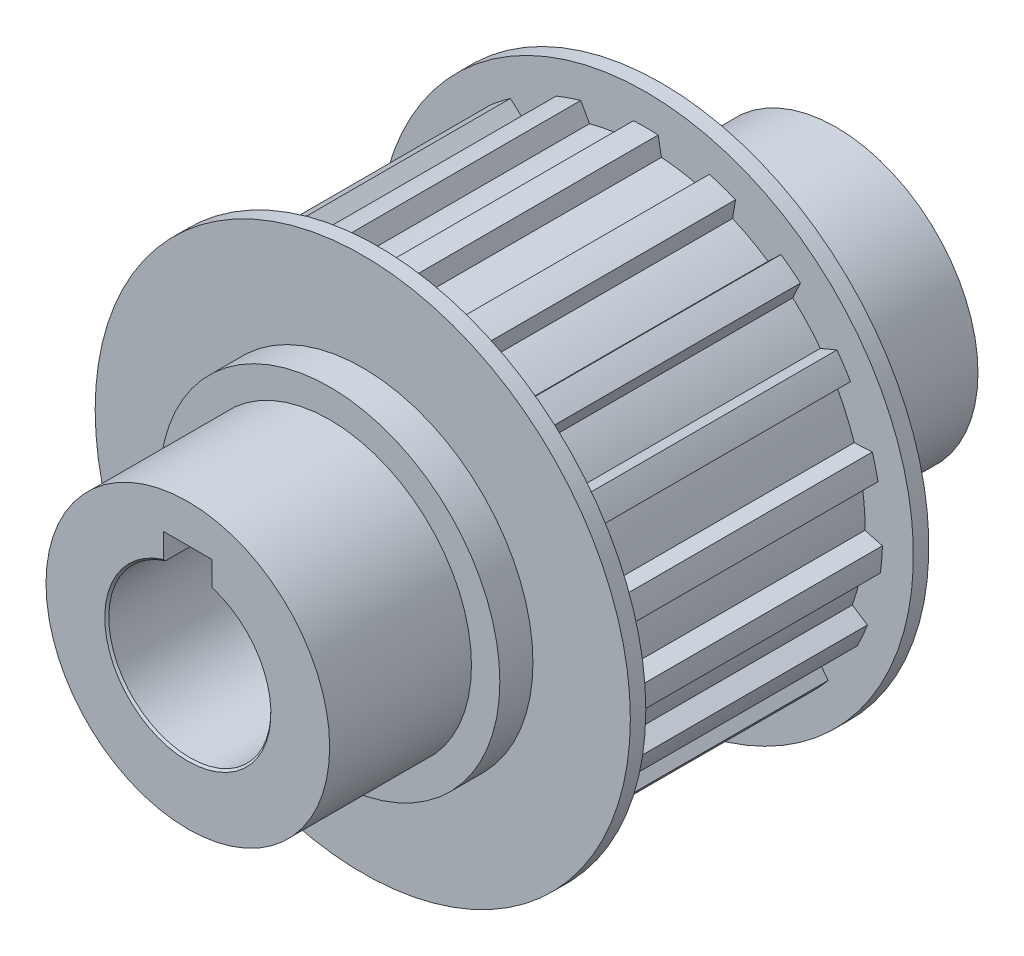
ISO-10303-21;
HEADER;
FILE_DESCRIPTION(('STEP AP214'),'2;1');
FILE_NAME('part.step','',(''),(''),'','','');
FILE_SCHEMA(('AUTOMOTIVE_DESIGN { 1 0 10303 214 1 1 1 1 }'));
ENDSEC;
DATA;
#1=APPLICATION_CONTEXT('core data for automotive mechanical design processes');
#2=APPLICATION_PROTOCOL_DEFINITION('international standard','automotive_design',2000,#1);
#3=PRODUCT_CONTEXT('',#1,'mechanical');
#4=PRODUCT('Part','Part','',(#3));
#5=PRODUCT_RELATED_PRODUCT_CATEGORY('part','',(#4));
#6=PRODUCT_DEFINITION_FORMATION('','',#4);
#7=PRODUCT_DEFINITION_CONTEXT('part definition',#1,'design');
#8=PRODUCT_DEFINITION('design','',#6,#7);
#9=PRODUCT_DEFINITION_SHAPE('','',#8);
#10=(LENGTH_UNIT() NAMED_UNIT(*) SI_UNIT(.MILLI.,.METRE.));
#11=(NAMED_UNIT(*) PLANE_ANGLE_UNIT() SI_UNIT($,.RADIAN.));
#12=(NAMED_UNIT(*) SI_UNIT($,.STERADIAN.) SOLID_ANGLE_UNIT());
#13=UNCERTAINTY_MEASURE_WITH_UNIT(LENGTH_MEASURE(1.E-05),#10,'distance_accuracy_value','');
#14=(GEOMETRIC_REPRESENTATION_CONTEXT(3) GLOBAL_UNCERTAINTY_ASSIGNED_CONTEXT((#13)) GLOBAL_UNIT_ASSIGNED_CONTEXT((#10,
#11,#12)) REPRESENTATION_CONTEXT('',''));
#15=CARTESIAN_POINT('',(0.,0.,0.));
#16=DIRECTION('',(0.,0.,1.));
#17=DIRECTION('',(1.,0.,0.));
#18=AXIS2_PLACEMENT_3D('',#15,#16,#17);
#19=CARTESIAN_POINT('',(0.,0.,0.));
#20=DIRECTION('',(0.,0.,1.));
#21=DIRECTION('',(1.,0.,0.));
#22=AXIS2_PLACEMENT_3D('',#19,#20,#21);
#23=CYLINDRICAL_SURFACE('',#22,29.21);
#24=CARTESIAN_POINT('',(0.,0.,-16.51));
#25=DIRECTION('',(0.,0.,1.));
#26=DIRECTION('',(1.,0.,0.));
#27=AXIS2_PLACEMENT_3D('',#24,#25,#26);
#28=CIRCLE('',#27,29.21);
#29=CARTESIAN_POINT('',(-1.524,29.1702163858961,-16.51));
#30=VERTEX_POINT('',#29);
#31=CARTESIAN_POINT('',(1.524,29.1702163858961,-16.51));
#32=VERTEX_POINT('',#31);
#33=EDGE_CURVE('E532',#30,#32,#28,.F.);
#34=ORIENTED_EDGE('',*,*,#33,.F.);
#35=DIRECTION('',(0.,0.,1.));
#36=VECTOR('',#35,1.);
#37=CARTESIAN_POINT('',(-1.524,29.1702163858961,0.));
#38=LINE('',#37,#36);
#39=CARTESIAN_POINT('',(-1.524,29.1702163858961,16.51));
#40=VERTEX_POINT('',#39);
#41=EDGE_CURVE('E531',#40,#30,#38,.F.);
#42=ORIENTED_EDGE('',*,*,#41,.F.);
#43=CARTESIAN_POINT('',(0.,0.,16.51));
#44=DIRECTION('',(0.,0.,1.));
#45=DIRECTION('',(1.,0.,0.));
#46=AXIS2_PLACEMENT_3D('',#43,#44,#45);
#47=CIRCLE('',#46,29.21);
#48=CARTESIAN_POINT('',(1.524,29.1702163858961,16.51));
#49=VERTEX_POINT('',#48);
#50=EDGE_CURVE('E19',#49,#40,#47,.T.);
#51=ORIENTED_EDGE('',*,*,#50,.F.);
#52=DIRECTION('',(0.,0.,1.));
#53=VECTOR('',#52,1.);
#54=CARTESIAN_POINT('',(1.524,29.1702163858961,0.));
#55=LINE('',#54,#53);
#56=EDGE_CURVE('E513',#32,#49,#55,.T.);
#57=ORIENTED_EDGE('',*,*,#56,.F.);
#58=EDGE_LOOP('',(#34,#42,#51,#57));
#59=FACE_BOUND('',#58,.T.);
#60=ADVANCED_FACE('F15',(#59),#23,.T.);
#61=CARTESIAN_POINT('',(1.524,29.1702163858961,0.));
#62=DIRECTION('',(0.983423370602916,0.181324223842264,0.));
#63=DIRECTION('',(-0.181324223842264,0.983423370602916,0.));
#64=AXIS2_PLACEMENT_3D('',#61,#62,#63);
#65=PLANE('',#64);
#66=DIRECTION('',(0.181324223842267,-0.983423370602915,0.));
#67=VECTOR('',#66,1.);
#68=CARTESIAN_POINT('',(1.524,29.1702163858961,-16.51));
#69=LINE('',#68,#67);
#70=CARTESIAN_POINT('',(1.92741928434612,26.9822464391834,-16.51));
#71=VERTEX_POINT('',#70);
#72=EDGE_CURVE('E929',#32,#71,#69,.T.);
#73=ORIENTED_EDGE('',*,*,#72,.F.);
#74=ORIENTED_EDGE('',*,*,#56,.T.);
#75=DIRECTION('',(-0.181324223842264,0.983423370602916,0.));
#76=VECTOR('',#75,1.);
#77=CARTESIAN_POINT('',(1.92741928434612,26.9822464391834,16.51));
#78=LINE('',#77,#76);
#79=CARTESIAN_POINT('',(1.92741928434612,26.9822464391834,16.51));
#80=VERTEX_POINT('',#79);
#81=EDGE_CURVE('E527',#80,#49,#78,.T.);
#82=ORIENTED_EDGE('',*,*,#81,.F.);
#83=DIRECTION('',(0.,0.,1.));
#84=VECTOR('',#83,1.);
#85=CARTESIAN_POINT('',(1.92741928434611,26.9822464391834,0.));
#86=LINE('',#85,#84);
#87=EDGE_CURVE('E690',#71,#80,#86,.T.);
#88=ORIENTED_EDGE('',*,*,#87,.F.);
#89=EDGE_LOOP('',(#73,#74,#82,#88));
#90=FACE_BOUND('',#89,.T.);
#91=ADVANCED_FACE('F1941',(#90),#65,.T.);
#92=CARTESIAN_POINT('',(0.,0.,0.));
#93=DIRECTION('',(0.,0.,1.));
#94=DIRECTION('',(1.,0.,0.));
#95=AXIS2_PLACEMENT_3D('',#92,#93,#94);
#96=CYLINDRICAL_SURFACE('',#95,27.0509993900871);
#97=CARTESIAN_POINT('',(0.,0.,-16.51));
#98=DIRECTION('',(0.,0.,1.));
#99=DIRECTION('',(1.,0.,0.));
#100=AXIS2_PLACEMENT_3D('',#97,#98,#99);
#101=CIRCLE('',#100,27.0509993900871);
#102=CARTESIAN_POINT('',(6.93813470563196,26.1461059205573,-16.51));
#103=VERTEX_POINT('',#102);
#104=EDGE_CURVE('E927',#71,#103,#101,.F.);
#105=ORIENTED_EDGE('',*,*,#104,.F.);
#106=ORIENTED_EDGE('',*,*,#87,.T.);
#107=CARTESIAN_POINT('',(0.,0.,16.51));
#108=DIRECTION('',(0.,0.,1.));
#109=DIRECTION('',(1.,0.,0.));
#110=AXIS2_PLACEMENT_3D('',#107,#108,#109);
#111=CIRCLE('',#110,27.0509993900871);
#112=CARTESIAN_POINT('',(6.93813470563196,26.1461059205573,16.51));
#113=VERTEX_POINT('',#112);
#114=EDGE_CURVE('E932',#113,#80,#111,.T.);
#115=ORIENTED_EDGE('',*,*,#114,.F.);
#116=DIRECTION('',(0.,0.,1.));
#117=VECTOR('',#116,1.);
#118=CARTESIAN_POINT('',(6.93813470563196,26.1461059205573,0.));
#119=LINE('',#118,#117);
#120=EDGE_CURVE('E688',#103,#113,#119,.T.);
#121=ORIENTED_EDGE('',*,*,#120,.F.);
#122=EDGE_LOOP('',(#105,#106,#115,#121));
#123=FACE_BOUND('',#122,.T.);
#124=ADVANCED_FACE('F1933',(#123),#96,.T.);
#125=CARTESIAN_POINT('',(6.93813470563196,26.1461059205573,0.));
#126=DIRECTION('',(-0.908770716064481,0.417295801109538,0.));
#127=DIRECTION('',(-0.417295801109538,-0.908770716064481,0.));
#128=AXIS2_PLACEMENT_3D('',#125,#126,#127);
#129=PLANE('',#128);
#130=DIRECTION('',(0.417295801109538,0.908770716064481,0.));
#131=VECTOR('',#130,1.);
#132=CARTESIAN_POINT('',(6.93813470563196,26.1461059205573,-16.51));
#133=LINE('',#132,#131);
#134=CARTESIAN_POINT('',(7.85141826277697,28.1350196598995,-16.51));
#135=VERTEX_POINT('',#134);
#136=EDGE_CURVE('E925',#103,#135,#133,.T.);
#137=ORIENTED_EDGE('',*,*,#136,.F.);
#138=ORIENTED_EDGE('',*,*,#120,.T.);
#139=DIRECTION('',(-0.417295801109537,-0.908770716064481,0.));
#140=VECTOR('',#139,1.);
#141=CARTESIAN_POINT('',(7.85141826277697,28.1350196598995,16.51));
#142=LINE('',#141,#140);
#143=CARTESIAN_POINT('',(7.85141826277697,28.1350196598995,16.51));
#144=VERTEX_POINT('',#143);
#145=EDGE_CURVE('E934',#144,#113,#142,.T.);
#146=ORIENTED_EDGE('',*,*,#145,.F.);
#147=DIRECTION('',(0.,0.,1.));
#148=VECTOR('',#147,1.);
#149=CARTESIAN_POINT('',(7.85141826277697,28.1350196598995,0.));
#150=LINE('',#149,#148);
#151=EDGE_CURVE('E686',#135,#144,#150,.T.);
#152=ORIENTED_EDGE('',*,*,#151,.F.);
#153=EDGE_LOOP('',(#137,#138,#146,#152));
#154=FACE_BOUND('',#153,.T.);
#155=ADVANCED_FACE('F1925',(#154),#129,.T.);
#156=CARTESIAN_POINT('',(0.,0.,0.));
#157=DIRECTION('',(0.,0.,1.));
#158=DIRECTION('',(1.,0.,0.));
#159=AXIS2_PLACEMENT_3D('',#156,#157,#158);
#160=CYLINDRICAL_SURFACE('',#159,29.21);
#161=CARTESIAN_POINT('',(0.,0.,-16.51));
#162=DIRECTION('',(0.,0.,1.));
#163=DIRECTION('',(1.,0.,0.));
#164=AXIS2_PLACEMENT_3D('',#161,#162,#163);
#165=CIRCLE('',#164,29.21);
#166=CARTESIAN_POINT('',(11.0725078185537,27.0300512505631,-16.51));
#167=VERTEX_POINT('',#166);
#168=EDGE_CURVE('E923',#135,#167,#165,.F.);
#169=ORIENTED_EDGE('',*,*,#168,.F.);
#170=ORIENTED_EDGE('',*,*,#151,.T.);
#171=CARTESIAN_POINT('',(0.,0.,16.51));
#172=DIRECTION('',(0.,0.,1.));
#173=DIRECTION('',(1.,0.,0.));
#174=AXIS2_PLACEMENT_3D('',#171,#172,#173);
#175=CIRCLE('',#174,29.21);
#176=CARTESIAN_POINT('',(11.0725078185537,27.0300512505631,16.51));
#177=VERTEX_POINT('',#176);
#178=EDGE_CURVE('E935',#177,#144,#175,.T.);
#179=ORIENTED_EDGE('',*,*,#178,.F.);
#180=DIRECTION('',(0.,0.,1.));
#181=VECTOR('',#180,1.);
#182=CARTESIAN_POINT('',(11.0725078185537,27.0300512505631,0.));
#183=LINE('',#182,#181);
#184=EDGE_CURVE('E684',#167,#177,#183,.T.);
#185=ORIENTED_EDGE('',*,*,#184,.F.);
#186=EDGE_LOOP('',(#169,#170,#179,#185));
#187=FACE_BOUND('',#186,.T.);
#188=ADVANCED_FACE('F1917',(#187),#160,.T.);
#189=CARTESIAN_POINT('',(11.0725078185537,27.0300512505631,0.));
#190=DIRECTION('',(0.986361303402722,-0.164594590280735,0.));
#191=DIRECTION('',(0.164594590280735,0.986361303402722,0.));
#192=AXIS2_PLACEMENT_3D('',#189,#190,#191);
#193=PLANE('',#192);
#194=DIRECTION('',(-0.164594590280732,-0.986361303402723,0.));
#195=VECTOR('',#194,1.);
#196=CARTESIAN_POINT('',(11.0725078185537,27.0300512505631,-16.51));
#197=LINE('',#196,#195);
#198=CARTESIAN_POINT('',(10.7073348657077,24.8416897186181,-16.51));
#199=VERTEX_POINT('',#198);
#200=EDGE_CURVE('E921',#167,#199,#197,.T.);
#201=ORIENTED_EDGE('',*,*,#200,.F.);
#202=ORIENTED_EDGE('',*,*,#184,.T.);
#203=DIRECTION('',(0.164594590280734,0.986361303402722,0.));
#204=VECTOR('',#203,1.);
#205=CARTESIAN_POINT('',(10.7073348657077,24.8416897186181,16.51));
#206=LINE('',#205,#204);
#207=CARTESIAN_POINT('',(10.7073348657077,24.8416897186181,16.51));
#208=VERTEX_POINT('',#207);
#209=EDGE_CURVE('E938',#208,#177,#206,.T.);
#210=ORIENTED_EDGE('',*,*,#209,.F.);
#211=DIRECTION('',(0.,0.,1.));
#212=VECTOR('',#211,1.);
#213=CARTESIAN_POINT('',(10.7073348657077,24.8416897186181,0.));
#214=LINE('',#213,#212);
#215=EDGE_CURVE('E682',#199,#208,#214,.T.);
#216=ORIENTED_EDGE('',*,*,#215,.F.);
#217=EDGE_LOOP('',(#201,#202,#210,#216));
#218=FACE_BOUND('',#217,.T.);
#219=ADVANCED_FACE('F1909',(#218),#193,.T.);
#220=CARTESIAN_POINT('',(0.,0.,0.));
#221=DIRECTION('',(0.,0.,1.));
#222=DIRECTION('',(1.,0.,0.));
#223=AXIS2_PLACEMENT_3D('',#220,#221,#222);
#224=CYLINDRICAL_SURFACE('',#223,27.0509993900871);
#225=CARTESIAN_POINT('',(0.,0.,-16.51));
#226=DIRECTION('',(0.,0.,1.));
#227=DIRECTION('',(1.,0.,0.));
#228=AXIS2_PLACEMENT_3D('',#225,#226,#227);
#229=CIRCLE('',#228,27.0509993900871);
#230=CARTESIAN_POINT('',(15.0844039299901,22.4547840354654,-16.51));
#231=VERTEX_POINT('',#230);
#232=EDGE_CURVE('E919',#199,#231,#229,.F.);
#233=ORIENTED_EDGE('',*,*,#232,.F.);
#234=ORIENTED_EDGE('',*,*,#215,.T.);
#235=CARTESIAN_POINT('',(0.,0.,16.51));
#236=DIRECTION('',(0.,0.,1.));
#237=DIRECTION('',(1.,0.,0.));
#238=AXIS2_PLACEMENT_3D('',#235,#236,#237);
#239=CIRCLE('',#238,27.0509993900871);
#240=CARTESIAN_POINT('',(15.0844039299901,22.4547840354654,16.51));
#241=VERTEX_POINT('',#240);
#242=EDGE_CURVE('E939',#241,#208,#239,.T.);
#243=ORIENTED_EDGE('',*,*,#242,.F.);
#244=DIRECTION('',(0.,0.,1.));
#245=VECTOR('',#244,1.);
#246=CARTESIAN_POINT('',(15.0844039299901,22.4547840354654,0.));
#247=LINE('',#246,#245);
#248=EDGE_CURVE('E680',#231,#241,#247,.T.);
#249=ORIENTED_EDGE('',*,*,#248,.F.);
#250=EDGE_LOOP('',(#233,#234,#243,#249));
#251=FACE_BOUND('',#250,.T.);
#252=ADVANCED_FACE('F1901',(#251),#224,.T.);
#253=CARTESIAN_POINT('',(15.0844039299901,22.4547840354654,0.));
#254=DIRECTION('',(-0.689624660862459,0.724166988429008,0.));
#255=DIRECTION('',(-0.724166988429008,-0.689624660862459,0.));
#256=AXIS2_PLACEMENT_3D('',#253,#254,#255);
#257=PLANE('',#256);
#258=DIRECTION('',(0.724166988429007,0.68962466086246,0.));
#259=VECTOR('',#258,1.);
#260=CARTESIAN_POINT('',(15.0844039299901,22.4547840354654,-16.51));
#261=LINE('',#260,#259);
#262=CARTESIAN_POINT('',(16.6829866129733,23.9771152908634,-16.51));
#263=VERTEX_POINT('',#262);
#264=EDGE_CURVE('E917',#231,#263,#261,.T.);
#265=ORIENTED_EDGE('',*,*,#264,.F.);
#266=ORIENTED_EDGE('',*,*,#248,.T.);
#267=DIRECTION('',(-0.724166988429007,-0.689624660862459,0.));
#268=VECTOR('',#267,1.);
#269=CARTESIAN_POINT('',(16.6829866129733,23.9771152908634,16.51));
#270=LINE('',#269,#268);
#271=CARTESIAN_POINT('',(16.6829866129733,23.9771152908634,16.51));
#272=VERTEX_POINT('',#271);
#273=EDGE_CURVE('E942',#272,#241,#270,.T.);
#274=ORIENTED_EDGE('',*,*,#273,.F.);
#275=DIRECTION('',(0.,0.,1.));
#276=VECTOR('',#275,1.);
#277=CARTESIAN_POINT('',(16.6829866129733,23.9771152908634,0.));
#278=LINE('',#277,#276);
#279=EDGE_CURVE('E678',#263,#272,#278,.T.);
#280=ORIENTED_EDGE('',*,*,#279,.F.);
#281=EDGE_LOOP('',(#265,#266,#274,#280));
#282=FACE_BOUND('',#281,.T.);
#283=ADVANCED_FACE('F1893',(#282),#257,.T.);
#284=CARTESIAN_POINT('',(0.,0.,0.));
#285=DIRECTION('',(0.,0.,1.));
#286=DIRECTION('',(1.,0.,0.));
#287=AXIS2_PLACEMENT_3D('',#284,#285,#286);
#288=CYLINDRICAL_SURFACE('',#287,29.21);
#289=CARTESIAN_POINT('',(0.,0.,-16.51));
#290=DIRECTION('',(0.,0.,1.));
#291=DIRECTION('',(1.,0.,0.));
#292=AXIS2_PLACEMENT_3D('',#289,#290,#291);
#293=CIRCLE('',#292,29.21);
#294=CARTESIAN_POINT('',(19.07738962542,22.1196135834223,-16.51));
#295=VERTEX_POINT('',#294);
#296=EDGE_CURVE('E915',#263,#295,#293,.F.);
#297=ORIENTED_EDGE('',*,*,#296,.F.);
#298=ORIENTED_EDGE('',*,*,#279,.T.);
#299=CARTESIAN_POINT('',(0.,0.,16.51));
#300=DIRECTION('',(0.,0.,1.));
#301=DIRECTION('',(1.,0.,0.));
#302=AXIS2_PLACEMENT_3D('',#299,#300,#301);
#303=CIRCLE('',#302,29.21);
#304=CARTESIAN_POINT('',(19.07738962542,22.1196135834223,16.51));
#305=VERTEX_POINT('',#304);
#306=EDGE_CURVE('E943',#305,#272,#303,.T.);
#307=ORIENTED_EDGE('',*,*,#306,.F.);
#308=DIRECTION('',(0.,0.,1.));
#309=VECTOR('',#308,1.);
#310=CARTESIAN_POINT('',(19.07738962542,22.1196135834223,0.));
#311=LINE('',#310,#309);
#312=EDGE_CURVE('E676',#295,#305,#311,.T.);
#313=ORIENTED_EDGE('',*,*,#312,.F.);
#314=EDGE_LOOP('',(#297,#298,#307,#313));
#315=FACE_BOUND('',#314,.T.);
#316=ADVANCED_FACE('F1885',(#315),#288,.T.);
#317=CARTESIAN_POINT('',(19.07738962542,22.1196135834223,0.));
#318=DIRECTION('',(0.908770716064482,-0.417295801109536,0.));
#319=DIRECTION('',(0.417295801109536,0.908770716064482,0.));
#320=AXIS2_PLACEMENT_3D('',#317,#318,#319);
#321=PLANE('',#320);
#322=DIRECTION('',(-0.417295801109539,-0.90877071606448,0.));
#323=VECTOR('',#322,1.);
#324=CARTESIAN_POINT('',(19.07738962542,22.1196135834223,-16.51));
#325=LINE('',#324,#323);
#326=CARTESIAN_POINT('',(18.1364655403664,20.0705053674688,-16.51));
#327=VERTEX_POINT('',#326);
#328=EDGE_CURVE('E913',#295,#327,#325,.T.);
#329=ORIENTED_EDGE('',*,*,#328,.F.);
#330=ORIENTED_EDGE('',*,*,#312,.T.);
#331=DIRECTION('',(0.417295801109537,0.908770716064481,0.));
#332=VECTOR('',#331,1.);
#333=CARTESIAN_POINT('',(18.1364655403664,20.0705053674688,16.51));
#334=LINE('',#333,#332);
#335=CARTESIAN_POINT('',(18.1364655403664,20.0705053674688,16.51));
#336=VERTEX_POINT('',#335);
#337=EDGE_CURVE('E946',#336,#305,#334,.T.);
#338=ORIENTED_EDGE('',*,*,#337,.F.);
#339=DIRECTION('',(0.,0.,1.));
#340=VECTOR('',#339,1.);
#341=CARTESIAN_POINT('',(18.1364655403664,20.0705053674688,0.));
#342=LINE('',#341,#340);
#343=EDGE_CURVE('E674',#327,#336,#342,.T.);
#344=ORIENTED_EDGE('',*,*,#343,.F.);
#345=EDGE_LOOP('',(#329,#330,#338,#344));
#346=FACE_BOUND('',#345,.T.);
#347=ADVANCED_FACE('F1877',(#346),#321,.T.);
#348=CARTESIAN_POINT('',(0.,0.,0.));
#349=DIRECTION('',(0.,0.,1.));
#350=DIRECTION('',(1.,0.,0.));
#351=AXIS2_PLACEMENT_3D('',#348,#349,#350);
#352=CYLINDRICAL_SURFACE('',#351,27.0509993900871);
#353=CARTESIAN_POINT('',(0.,0.,-16.51));
#354=DIRECTION('',(0.,0.,1.));
#355=DIRECTION('',(1.,0.,0.));
#356=AXIS2_PLACEMENT_3D('',#353,#354,#355);
#357=CIRCLE('',#356,27.0509993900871);
#358=CARTESIAN_POINT('',(21.5344337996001,16.3714608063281,-16.51));
#359=VERTEX_POINT('',#358);
#360=EDGE_CURVE('E911',#327,#359,#357,.F.);
#361=ORIENTED_EDGE('',*,*,#360,.F.);
#362=ORIENTED_EDGE('',*,*,#343,.T.);
#363=CARTESIAN_POINT('',(0.,0.,16.51));
#364=DIRECTION('',(0.,0.,1.));
#365=DIRECTION('',(1.,0.,0.));
#366=AXIS2_PLACEMENT_3D('',#363,#364,#365);
#367=CIRCLE('',#366,27.0509993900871);
#368=CARTESIAN_POINT('',(21.5344337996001,16.3714608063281,16.51));
#369=VERTEX_POINT('',#368);
#370=EDGE_CURVE('E947',#369,#336,#367,.T.);
#371=ORIENTED_EDGE('',*,*,#370,.F.);
#372=DIRECTION('',(0.,0.,1.));
#373=VECTOR('',#372,1.);
#374=CARTESIAN_POINT('',(21.5344337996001,16.3714608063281,0.));
#375=LINE('',#374,#373);
#376=EDGE_CURVE('E672',#359,#369,#375,.T.);
#377=ORIENTED_EDGE('',*,*,#376,.F.);
#378=EDGE_LOOP('',(#361,#362,#371,#377));
#379=FACE_BOUND('',#378,.T.);
#380=ADVANCED_FACE('F1869',(#379),#352,.T.);
#381=CARTESIAN_POINT('',(21.5344337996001,16.3714608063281,0.));
#382=DIRECTION('',(-0.3860830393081,0.922464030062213,0.));
#383=DIRECTION('',(-0.922464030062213,-0.3860830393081,0.));
#384=AXIS2_PLACEMENT_3D('',#381,#382,#383);
#385=PLANE('',#384);
#386=DIRECTION('',(0.922464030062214,0.3860830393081,0.));
#387=VECTOR('',#386,1.);
#388=CARTESIAN_POINT('',(21.5344337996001,16.3714608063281,-16.51));
#389=LINE('',#388,#387);
#390=CARTESIAN_POINT('',(23.5867783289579,17.2304378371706,-16.51));
#391=VERTEX_POINT('',#390);
#392=EDGE_CURVE('E909',#359,#391,#389,.T.);
#393=ORIENTED_EDGE('',*,*,#392,.F.);
#394=ORIENTED_EDGE('',*,*,#376,.T.);
#395=DIRECTION('',(-0.922464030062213,-0.3860830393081,0.));
#396=VECTOR('',#395,1.);
#397=CARTESIAN_POINT('',(23.586778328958,17.2304378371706,16.51));
#398=LINE('',#397,#396);
#399=CARTESIAN_POINT('',(23.586778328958,17.2304378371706,16.51));
#400=VERTEX_POINT('',#399);
#401=EDGE_CURVE('E950',#400,#369,#398,.T.);
#402=ORIENTED_EDGE('',*,*,#401,.F.);
#403=DIRECTION('',(0.,0.,1.));
#404=VECTOR('',#403,1.);
#405=CARTESIAN_POINT('',(23.586778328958,17.2304378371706,0.));
#406=LINE('',#405,#404);
#407=EDGE_CURVE('E670',#391,#400,#406,.T.);
#408=ORIENTED_EDGE('',*,*,#407,.F.);
#409=EDGE_LOOP('',(#393,#394,#402,#408));
#410=FACE_BOUND('',#409,.T.);
#411=ADVANCED_FACE('F1861',(#410),#385,.T.);
#412=CARTESIAN_POINT('',(0.,0.,0.));
#413=DIRECTION('',(0.,0.,1.));
#414=DIRECTION('',(1.,0.,0.));
#415=AXIS2_PLACEMENT_3D('',#412,#413,#414);
#416=CYLINDRICAL_SURFACE('',#415,29.21);
#417=CARTESIAN_POINT('',(0.,0.,-16.51));
#418=DIRECTION('',(0.,0.,1.));
#419=DIRECTION('',(1.,0.,0.));
#420=AXIS2_PLACEMENT_3D('',#417,#418,#419);
#421=CIRCLE('',#420,29.21);
#422=CARTESIAN_POINT('',(25.2542665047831,14.6780830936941,-16.51));
#423=VERTEX_POINT('',#422);
#424=EDGE_CURVE('E907',#391,#423,#421,.F.);
#425=ORIENTED_EDGE('',*,*,#424,.F.);
#426=ORIENTED_EDGE('',*,*,#407,.T.);
#427=CARTESIAN_POINT('',(0.,0.,16.51));
#428=DIRECTION('',(0.,0.,1.));
#429=DIRECTION('',(1.,0.,0.));
#430=AXIS2_PLACEMENT_3D('',#427,#428,#429);
#431=CIRCLE('',#430,29.21);
#432=CARTESIAN_POINT('',(25.2542665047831,14.6780830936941,16.51));
#433=VERTEX_POINT('',#432);
#434=EDGE_CURVE('E951',#433,#400,#431,.T.);
#435=ORIENTED_EDGE('',*,*,#434,.F.);
#436=DIRECTION('',(0.,0.,1.));
#437=VECTOR('',#436,1.);
#438=CARTESIAN_POINT('',(25.2542665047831,14.6780830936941,0.));
#439=LINE('',#438,#437);
#440=EDGE_CURVE('E668',#423,#433,#439,.T.);
#441=ORIENTED_EDGE('',*,*,#440,.F.);
#442=EDGE_LOOP('',(#425,#426,#435,#441));
#443=FACE_BOUND('',#442,.T.);
#444=ADVANCED_FACE('F1853',(#443),#416,.T.);
#445=CARTESIAN_POINT('',(25.2542665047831,14.6780830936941,0.));
#446=DIRECTION('',(0.68962466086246,-0.724166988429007,0.));
#447=DIRECTION('',(0.724166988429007,0.68962466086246,0.));
#448=AXIS2_PLACEMENT_3D('',#445,#446,#447);
#449=PLANE('',#448);
#450=DIRECTION('',(-0.724166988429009,-0.689624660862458,0.));
#451=VECTOR('',#450,1.);
#452=CARTESIAN_POINT('',(25.2542665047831,14.6780830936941,-16.51));
#453=LINE('',#452,#451);
#454=CARTESIAN_POINT('',(23.6431241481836,13.1437912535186,-16.51));
#455=VERTEX_POINT('',#454);
#456=EDGE_CURVE('E905',#423,#455,#453,.T.);
#457=ORIENTED_EDGE('',*,*,#456,.F.);
#458=ORIENTED_EDGE('',*,*,#440,.T.);
#459=DIRECTION('',(0.724166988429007,0.689624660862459,0.));
#460=VECTOR('',#459,1.);
#461=CARTESIAN_POINT('',(23.6431241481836,13.1437912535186,16.51));
#462=LINE('',#461,#460);
#463=CARTESIAN_POINT('',(23.6431241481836,13.1437912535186,16.51));
#464=VERTEX_POINT('',#463);
#465=EDGE_CURVE('E954',#464,#433,#462,.T.);
#466=ORIENTED_EDGE('',*,*,#465,.F.);
#467=DIRECTION('',(0.,0.,1.));
#468=VECTOR('',#467,1.);
#469=CARTESIAN_POINT('',(23.6431241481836,13.1437912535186,0.));
#470=LINE('',#469,#468);
#471=EDGE_CURVE('E666',#455,#464,#470,.T.);
#472=ORIENTED_EDGE('',*,*,#471,.F.);
#473=EDGE_LOOP('',(#457,#458,#466,#472));
#474=FACE_BOUND('',#473,.T.);
#475=ADVANCED_FACE('F1845',(#474),#449,.T.);
#476=CARTESIAN_POINT('',(0.,0.,0.));
#477=DIRECTION('',(0.,0.,1.));
#478=DIRECTION('',(1.,0.,0.));
#479=AXIS2_PLACEMENT_3D('',#476,#477,#478);
#480=CYLINDRICAL_SURFACE('',#479,27.0509993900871);
#481=CARTESIAN_POINT('',(0.,0.,-16.51));
#482=DIRECTION('',(0.,0.,1.));
#483=DIRECTION('',(1.,0.,0.));
#484=AXIS2_PLACEMENT_3D('',#481,#482,#483);
#485=CIRCLE('',#484,27.0509993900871);
#486=CARTESIAN_POINT('',(25.7165817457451,8.39130450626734,-16.51));
#487=VERTEX_POINT('',#486);
#488=EDGE_CURVE('E903',#455,#487,#485,.F.);
#489=ORIENTED_EDGE('',*,*,#488,.F.);
#490=ORIENTED_EDGE('',*,*,#471,.T.);
#491=CARTESIAN_POINT('',(0.,0.,16.51));
#492=DIRECTION('',(0.,0.,1.));
#493=DIRECTION('',(1.,0.,0.));
#494=AXIS2_PLACEMENT_3D('',#491,#492,#493);
#495=CIRCLE('',#494,27.0509993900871);
#496=CARTESIAN_POINT('',(25.7165817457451,8.39130450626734,16.51));
#497=VERTEX_POINT('',#496);
#498=EDGE_CURVE('E955',#497,#464,#495,.T.);
#499=ORIENTED_EDGE('',*,*,#498,.F.);
#500=DIRECTION('',(0.,0.,1.));
#501=VECTOR('',#500,1.);
#502=CARTESIAN_POINT('',(25.7165817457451,8.39130450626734,0.));
#503=LINE('',#502,#501);
#504=EDGE_CURVE('E664',#487,#497,#503,.T.);
#505=ORIENTED_EDGE('',*,*,#504,.F.);
#506=EDGE_LOOP('',(#489,#490,#499,#505));
#507=FACE_BOUND('',#506,.T.);
#508=ADVANCED_FACE('F1837',(#507),#480,.T.);
#509=CARTESIAN_POINT('',(25.7165817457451,8.39130450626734,0.));
#510=DIRECTION('',(-0.052173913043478,0.998638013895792,0.));
#511=DIRECTION('',(-0.998638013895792,-0.052173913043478,0.));
#512=AXIS2_PLACEMENT_3D('',#509,#510,#511);
#513=PLANE('',#512);
#514=DIRECTION('',(0.998638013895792,0.0521739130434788,0.));
#515=VECTOR('',#514,1.);
#516=CARTESIAN_POINT('',(25.7165817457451,8.39130450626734,-16.51));
#517=LINE('',#516,#515);
#518=CARTESIAN_POINT('',(27.9435845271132,8.50765442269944,-16.51));
#519=VERTEX_POINT('',#518);
#520=EDGE_CURVE('E901',#487,#519,#517,.T.);
#521=ORIENTED_EDGE('',*,*,#520,.F.);
#522=ORIENTED_EDGE('',*,*,#504,.T.);
#523=DIRECTION('',(-0.998638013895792,-0.0521739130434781,0.));
#524=VECTOR('',#523,1.);
#525=CARTESIAN_POINT('',(27.9435845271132,8.50765442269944,16.51));
#526=LINE('',#525,#524);
#527=CARTESIAN_POINT('',(27.9435845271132,8.50765442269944,16.51));
#528=VERTEX_POINT('',#527);
#529=EDGE_CURVE('E958',#528,#497,#526,.T.);
#530=ORIENTED_EDGE('',*,*,#529,.F.);
#531=DIRECTION('',(0.,0.,1.));
#532=VECTOR('',#531,1.);
#533=CARTESIAN_POINT('',(27.9435845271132,8.50765442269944,0.));
#534=LINE('',#533,#532);
#535=EDGE_CURVE('E662',#519,#528,#534,.T.);
#536=ORIENTED_EDGE('',*,*,#535,.F.);
#537=EDGE_LOOP('',(#521,#522,#530,#536));
#538=FACE_BOUND('',#537,.T.);
#539=ADVANCED_FACE('F1829',(#538),#513,.T.);
#540=CARTESIAN_POINT('',(0.,0.,0.));
#541=DIRECTION('',(0.,0.,1.));
#542=DIRECTION('',(1.,0.,0.));
#543=AXIS2_PLACEMENT_3D('',#540,#541,#542);
#544=CYLINDRICAL_SURFACE('',#543,29.21);
#545=CARTESIAN_POINT('',(0.,0.,-16.51));
#546=DIRECTION('',(0.,0.,1.));
#547=DIRECTION('',(1.,0.,0.));
#548=AXIS2_PLACEMENT_3D('',#545,#546,#547);
#549=CIRCLE('',#548,29.21);
#550=CARTESIAN_POINT('',(28.6517354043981,5.68349877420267,-16.51));
#551=VERTEX_POINT('',#550);
#552=EDGE_CURVE('E899',#519,#551,#549,.F.);
#553=ORIENTED_EDGE('',*,*,#552,.F.);
#554=ORIENTED_EDGE('',*,*,#535,.T.);
#555=CARTESIAN_POINT('',(0.,0.,16.51));
#556=DIRECTION('',(0.,0.,1.));
#557=DIRECTION('',(1.,0.,0.));
#558=AXIS2_PLACEMENT_3D('',#555,#556,#557);
#559=CIRCLE('',#558,29.21);
#560=CARTESIAN_POINT('',(28.651735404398,5.68349877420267,16.51));
#561=VERTEX_POINT('',#560);
#562=EDGE_CURVE('E959',#561,#528,#559,.T.);
#563=ORIENTED_EDGE('',*,*,#562,.F.);
#564=DIRECTION('',(0.,0.,1.));
#565=VECTOR('',#564,1.);
#566=CARTESIAN_POINT('',(28.6517354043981,5.68349877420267,0.));
#567=LINE('',#566,#565);
#568=EDGE_CURVE('E660',#551,#561,#567,.T.);
#569=ORIENTED_EDGE('',*,*,#568,.F.);
#570=EDGE_LOOP('',(#553,#554,#563,#569));
#571=FACE_BOUND('',#570,.T.);
#572=ADVANCED_FACE('F1821',(#571),#544,.T.);
#573=CARTESIAN_POINT('',(28.6517354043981,5.68349877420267,0.));
#574=DIRECTION('',(0.417191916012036,-0.908818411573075,0.));
#575=DIRECTION('',(0.908818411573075,0.417191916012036,0.));
#576=AXIS2_PLACEMENT_3D('',#573,#574,#575);
#577=PLANE('',#576);
#578=DIRECTION('',(-0.908818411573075,-0.417191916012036,0.));
#579=VECTOR('',#578,1.);
#580=CARTESIAN_POINT('',(28.6517354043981,5.68349877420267,-16.51));
#581=LINE('',#580,#579);
#582=CARTESIAN_POINT('',(26.6297503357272,4.7553091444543,-16.51));
#583=VERTEX_POINT('',#582);
#584=EDGE_CURVE('E897',#551,#583,#581,.T.);
#585=ORIENTED_EDGE('',*,*,#584,.F.);
#586=ORIENTED_EDGE('',*,*,#568,.T.);
#587=DIRECTION('',(0.908818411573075,0.417191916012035,0.));
#588=VECTOR('',#587,1.);
#589=CARTESIAN_POINT('',(26.6297503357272,4.7553091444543,16.51));
#590=LINE('',#589,#588);
#591=CARTESIAN_POINT('',(26.6297503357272,4.7553091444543,16.51));
#592=VERTEX_POINT('',#591);
#593=EDGE_CURVE('E962',#592,#561,#590,.T.);
#594=ORIENTED_EDGE('',*,*,#593,.F.);
#595=DIRECTION('',(0.,0.,1.));
#596=VECTOR('',#595,1.);
#597=CARTESIAN_POINT('',(26.6297503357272,4.7553091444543,0.));
#598=LINE('',#597,#596);
#599=EDGE_CURVE('E658',#583,#592,#598,.T.);
#600=ORIENTED_EDGE('',*,*,#599,.F.);
#601=EDGE_LOOP('',(#585,#586,#594,#600));
#602=FACE_BOUND('',#601,.T.);
#603=ADVANCED_FACE('F1813',(#602),#577,.T.);
#604=CARTESIAN_POINT('',(0.,0.,0.));
#605=DIRECTION('',(0.,0.,1.));
#606=DIRECTION('',(1.,0.,0.));
#607=AXIS2_PLACEMENT_3D('',#604,#605,#606);
#608=CYLINDRICAL_SURFACE('',#607,27.0509993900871);
#609=CARTESIAN_POINT('',(0.,0.,-16.51));
#610=DIRECTION('',(0.,0.,1.));
#611=DIRECTION('',(1.,0.,0.));
#612=AXIS2_PLACEMENT_3D('',#609,#610,#611);
#613=CIRCLE('',#612,27.0509993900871);
#614=CARTESIAN_POINT('',(27.0492602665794,-0.30673609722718,-16.51));
#615=VERTEX_POINT('',#614);
#616=EDGE_CURVE('E895',#583,#615,#613,.F.);
#617=ORIENTED_EDGE('',*,*,#616,.F.);
#618=ORIENTED_EDGE('',*,*,#599,.T.);
#619=CARTESIAN_POINT('',(0.,0.,16.51));
#620=DIRECTION('',(0.,0.,1.));
#621=DIRECTION('',(1.,0.,0.));
#622=AXIS2_PLACEMENT_3D('',#619,#620,#621);
#623=CIRCLE('',#622,27.0509993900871);
#624=CARTESIAN_POINT('',(27.0492602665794,-0.306736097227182,16.51));
#625=VERTEX_POINT('',#624);
#626=EDGE_CURVE('E963',#625,#592,#623,.T.);
#627=ORIENTED_EDGE('',*,*,#626,.F.);
#628=DIRECTION('',(0.,0.,1.));
#629=VECTOR('',#628,1.);
#630=CARTESIAN_POINT('',(27.0492602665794,-0.306736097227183,0.));
#631=LINE('',#630,#629);
#632=EDGE_CURVE('E656',#615,#625,#631,.T.);
#633=ORIENTED_EDGE('',*,*,#632,.F.);
#634=EDGE_LOOP('',(#617,#618,#627,#633));
#635=FACE_BOUND('',#634,.T.);
#636=ADVANCED_FACE('F1805',(#635),#608,.T.);
#637=CARTESIAN_POINT('',(27.0492602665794,-0.306736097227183,0.));
#638=DIRECTION('',(0.261841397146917,0.965110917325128,0.));
#639=DIRECTION('',(-0.965110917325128,0.261841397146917,0.));
#640=AXIS2_PLACEMENT_3D('',#637,#638,#639);
#641=PLANE('',#640);
#642=DIRECTION('',(0.965110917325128,-0.261841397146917,0.));
#643=VECTOR('',#642,1.);
#644=CARTESIAN_POINT('',(27.0492602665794,-0.30673609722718,-16.51));
#645=LINE('',#644,#643);
#646=CARTESIAN_POINT('',(29.1964598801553,-0.889286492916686,-16.51));
#647=VERTEX_POINT('',#646);
#648=EDGE_CURVE('E893',#615,#647,#645,.T.);
#649=ORIENTED_EDGE('',*,*,#648,.F.);
#650=ORIENTED_EDGE('',*,*,#632,.T.);
#651=DIRECTION('',(-0.965110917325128,0.261841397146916,0.));
#652=VECTOR('',#651,1.);
#653=CARTESIAN_POINT('',(29.1964598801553,-0.889286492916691,16.51));
#654=LINE('',#653,#652);
#655=CARTESIAN_POINT('',(29.1964598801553,-0.889286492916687,16.51));
#656=VERTEX_POINT('',#655);
#657=EDGE_CURVE('E966',#656,#625,#654,.T.);
#658=ORIENTED_EDGE('',*,*,#657,.F.);
#659=DIRECTION('',(0.,0.,1.));
#660=VECTOR('',#659,1.);
#661=CARTESIAN_POINT('',(29.1964598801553,-0.889286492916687,0.));
#662=LINE('',#661,#660);
#663=EDGE_CURVE('E654',#647,#656,#662,.T.);
#664=ORIENTED_EDGE('',*,*,#663,.F.);
#665=EDGE_LOOP('',(#649,#650,#658,#664));
#666=FACE_BOUND('',#665,.T.);
#667=ADVANCED_FACE('F1797',(#666),#641,.T.);
#668=CARTESIAN_POINT('',(0.,0.,0.));
#669=DIRECTION('',(0.,0.,1.));
#670=DIRECTION('',(1.,0.,0.));
#671=AXIS2_PLACEMENT_3D('',#668,#669,#670);
#672=CYLINDRICAL_SURFACE('',#671,29.21);
#673=CARTESIAN_POINT('',(0.,0.,-16.51));
#674=DIRECTION('',(0.,0.,1.));
#675=DIRECTION('',(1.,0.,0.));
#676=AXIS2_PLACEMENT_3D('',#673,#674,#675);
#677=CIRCLE('',#676,29.21);
#678=CARTESIAN_POINT('',(28.9447343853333,-3.92765214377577,-16.51));
#679=VERTEX_POINT('',#678);
#680=EDGE_CURVE('E891',#647,#679,#677,.F.);
#681=ORIENTED_EDGE('',*,*,#680,.F.);
#682=ORIENTED_EDGE('',*,*,#663,.T.);
#683=CARTESIAN_POINT('',(0.,0.,16.51));
#684=DIRECTION('',(0.,0.,1.));
#685=DIRECTION('',(1.,0.,0.));
#686=AXIS2_PLACEMENT_3D('',#683,#684,#685);
#687=CIRCLE('',#686,29.21);
#688=CARTESIAN_POINT('',(28.9447343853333,-3.92765214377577,16.51));
#689=VERTEX_POINT('',#688);
#690=EDGE_CURVE('E967',#689,#656,#687,.T.);
#691=ORIENTED_EDGE('',*,*,#690,.F.);
#692=DIRECTION('',(0.,0.,1.));
#693=VECTOR('',#692,1.);
#694=CARTESIAN_POINT('',(28.9447343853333,-3.92765214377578,0.));
#695=LINE('',#694,#693);
#696=EDGE_CURVE('E652',#679,#689,#695,.T.);
#697=ORIENTED_EDGE('',*,*,#696,.F.);
#698=EDGE_LOOP('',(#681,#682,#691,#697));
#699=FACE_BOUND('',#698,.T.);
#700=ADVANCED_FACE('F1789',(#699),#672,.T.);
#701=CARTESIAN_POINT('',(28.9447343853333,-3.92765214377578,0.));
#702=DIRECTION('',(0.071251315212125,-0.997458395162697,0.));
#703=DIRECTION('',(0.997458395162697,0.071251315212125,0.));
#704=AXIS2_PLACEMENT_3D('',#701,#702,#703);
#705=PLANE('',#704);
#706=DIRECTION('',(-0.997458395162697,-0.0712513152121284,0.));
#707=VECTOR('',#706,1.);
#708=CARTESIAN_POINT('',(28.9447343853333,-3.92765214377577,-16.51));
#709=LINE('',#708,#707);
#710=CARTESIAN_POINT('',(26.7407671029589,-4.08508785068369,-16.51));
#711=VERTEX_POINT('',#710);
#712=EDGE_CURVE('E889',#679,#711,#709,.T.);
#713=ORIENTED_EDGE('',*,*,#712,.F.);
#714=ORIENTED_EDGE('',*,*,#696,.T.);
#715=DIRECTION('',(0.997458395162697,0.0712513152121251,0.));
#716=VECTOR('',#715,1.);
#717=CARTESIAN_POINT('',(26.7407671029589,-4.08508785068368,16.51));
#718=LINE('',#717,#716);
#719=CARTESIAN_POINT('',(26.7407671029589,-4.08508785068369,16.51));
#720=VERTEX_POINT('',#719);
#721=EDGE_CURVE('E970',#720,#689,#718,.T.);
#722=ORIENTED_EDGE('',*,*,#721,.F.);
#723=DIRECTION('',(0.,0.,1.));
#724=VECTOR('',#723,1.);
#725=CARTESIAN_POINT('',(26.7407671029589,-4.08508785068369,0.));
#726=LINE('',#725,#724);
#727=EDGE_CURVE('E650',#711,#720,#726,.T.);
#728=ORIENTED_EDGE('',*,*,#727,.F.);
#729=EDGE_LOOP('',(#713,#714,#722,#728));
#730=FACE_BOUND('',#729,.T.);
#731=ADVANCED_FACE('F1781',(#730),#705,.T.);
#732=CARTESIAN_POINT('',(0.,0.,0.));
#733=DIRECTION('',(0.,0.,1.));
#734=DIRECTION('',(1.,0.,0.));
#735=AXIS2_PLACEMENT_3D('',#732,#733,#734);
#736=CYLINDRICAL_SURFACE('',#735,27.0509993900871);
#737=CARTESIAN_POINT('',(0.,0.,-16.51));
#738=DIRECTION('',(0.,0.,1.));
#739=DIRECTION('',(1.,0.,0.));
#740=AXIS2_PLACEMENT_3D('',#737,#738,#739);
#741=CIRCLE('',#740,27.0509993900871);
#742=CARTESIAN_POINT('',(25.4838570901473,-9.0735657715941,-16.51));
#743=VERTEX_POINT('',#742);
#744=EDGE_CURVE('E887',#711,#743,#741,.F.);
#745=ORIENTED_EDGE('',*,*,#744,.F.);
#746=ORIENTED_EDGE('',*,*,#727,.T.);
#747=CARTESIAN_POINT('',(0.,0.,16.51));
#748=DIRECTION('',(0.,0.,1.));
#749=DIRECTION('',(1.,0.,0.));
#750=AXIS2_PLACEMENT_3D('',#747,#748,#749);
#751=CIRCLE('',#750,27.0509993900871);
#752=CARTESIAN_POINT('',(25.4838570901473,-9.0735657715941,16.51));
#753=VERTEX_POINT('',#752);
#754=EDGE_CURVE('E971',#753,#720,#751,.T.);
#755=ORIENTED_EDGE('',*,*,#754,.F.);
#756=DIRECTION('',(0.,0.,1.));
#757=VECTOR('',#756,1.);
#758=CARTESIAN_POINT('',(25.4838570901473,-9.0735657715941,0.));
#759=LINE('',#758,#757);
#760=EDGE_CURVE('E648',#743,#753,#759,.T.);
#761=ORIENTED_EDGE('',*,*,#760,.F.);
#762=EDGE_LOOP('',(#745,#746,#755,#761));
#763=FACE_BOUND('',#762,.T.);
#764=ADVANCED_FACE('F1773',(#763),#736,.T.);
#765=CARTESIAN_POINT('',(25.4838570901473,-9.0735657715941,0.));
#766=DIRECTION('',(0.547252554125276,0.836967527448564,0.));
#767=DIRECTION('',(-0.836967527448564,0.547252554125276,0.));
#768=AXIS2_PLACEMENT_3D('',#765,#766,#767);
#769=PLANE('',#768);
#770=DIRECTION('',(0.836967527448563,-0.547252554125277,0.));
#771=VECTOR('',#770,1.);
#772=CARTESIAN_POINT('',(25.4838570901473,-9.0735657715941,-16.51));
#773=LINE('',#772,#771);
#774=CARTESIAN_POINT('',(27.3388530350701,-10.2864578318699,-16.51));
#775=VERTEX_POINT('',#774);
#776=EDGE_CURVE('E885',#743,#775,#773,.T.);
#777=ORIENTED_EDGE('',*,*,#776,.F.);
#778=ORIENTED_EDGE('',*,*,#760,.T.);
#779=DIRECTION('',(-0.836967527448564,0.547252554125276,0.));
#780=VECTOR('',#779,1.);
#781=CARTESIAN_POINT('',(27.3388530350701,-10.2864578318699,16.51));
#782=LINE('',#781,#780);
#783=CARTESIAN_POINT('',(27.3388530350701,-10.2864578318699,16.51));
#784=VERTEX_POINT('',#783);
#785=EDGE_CURVE('E974',#784,#753,#782,.T.);
#786=ORIENTED_EDGE('',*,*,#785,.F.);
#787=DIRECTION('',(0.,0.,1.));
#788=VECTOR('',#787,1.);
#789=CARTESIAN_POINT('',(27.3388530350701,-10.2864578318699,0.));
#790=LINE('',#789,#788);
#791=EDGE_CURVE('E646',#775,#784,#790,.T.);
#792=ORIENTED_EDGE('',*,*,#791,.F.);
#793=EDGE_LOOP('',(#777,#778,#786,#792));
#794=FACE_BOUND('',#793,.T.);
#795=ADVANCED_FACE('F1765',(#794),#769,.T.);
#796=CARTESIAN_POINT('',(0.,0.,0.));
#797=DIRECTION('',(0.,0.,1.));
#798=DIRECTION('',(1.,0.,0.));
#799=AXIS2_PLACEMENT_3D('',#796,#797,#798);
#800=CYLINDRICAL_SURFACE('',#799,29.21);
#801=CARTESIAN_POINT('',(0.,0.,-16.51));
#802=DIRECTION('',(0.,0.,1.));
#803=DIRECTION('',(1.,0.,0.));
#804=AXIS2_PLACEMENT_3D('',#801,#802,#803);
#805=CIRCLE('',#804,29.21);
#806=CARTESIAN_POINT('',(26.084094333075,-13.1470195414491,-16.51));
#807=VERTEX_POINT('',#806);
#808=EDGE_CURVE('E883',#775,#807,#805,.F.);
#809=ORIENTED_EDGE('',*,*,#808,.F.);
#810=ORIENTED_EDGE('',*,*,#791,.T.);
#811=CARTESIAN_POINT('',(0.,0.,16.51));
#812=DIRECTION('',(0.,0.,1.));
#813=DIRECTION('',(1.,0.,0.));
#814=AXIS2_PLACEMENT_3D('',#811,#812,#813);
#815=CIRCLE('',#814,29.21);
#816=CARTESIAN_POINT('',(26.084094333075,-13.1470195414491,16.51));
#817=VERTEX_POINT('',#816);
#818=EDGE_CURVE('E975',#817,#784,#815,.T.);
#819=ORIENTED_EDGE('',*,*,#818,.F.);
#820=DIRECTION('',(0.,0.,1.));
#821=VECTOR('',#820,1.);
#822=CARTESIAN_POINT('',(26.084094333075,-13.1470195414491,0.));
#823=LINE('',#822,#821);
#824=EDGE_CURVE('E644',#807,#817,#823,.T.);
#825=ORIENTED_EDGE('',*,*,#824,.F.);
#826=EDGE_LOOP('',(#809,#810,#819,#825));
#827=FACE_BOUND('',#826,.T.);
#828=ADVANCED_FACE('F1757',(#827),#800,.T.);
#829=CARTESIAN_POINT('',(26.084094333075,-13.1470195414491,0.));
#830=DIRECTION('',(-0.261841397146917,-0.965110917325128,0.));
#831=DIRECTION('',(0.965110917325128,-0.261841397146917,0.));
#832=AXIS2_PLACEMENT_3D('',#829,#830,#831);
#833=PLANE('',#832);
#834=DIRECTION('',(-0.965110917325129,0.261841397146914,0.));
#835=VECTOR('',#834,1.);
#836=CARTESIAN_POINT('',(26.084094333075,-13.1470195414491,-16.51));
#837=LINE('',#836,#835);
#838=CARTESIAN_POINT('',(23.9536332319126,-12.5690104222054,-16.51));
#839=VERTEX_POINT('',#838);
#840=EDGE_CURVE('E881',#807,#839,#837,.T.);
#841=ORIENTED_EDGE('',*,*,#840,.F.);
#842=ORIENTED_EDGE('',*,*,#824,.T.);
#843=DIRECTION('',(0.965110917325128,-0.261841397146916,0.));
#844=VECTOR('',#843,1.);
#845=CARTESIAN_POINT('',(23.9536332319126,-12.5690104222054,16.51));
#846=LINE('',#845,#844);
#847=CARTESIAN_POINT('',(23.9536332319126,-12.5690104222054,16.51));
#848=VERTEX_POINT('',#847);
#849=EDGE_CURVE('E978',#848,#817,#846,.T.);
#850=ORIENTED_EDGE('',*,*,#849,.F.);
#851=DIRECTION('',(0.,0.,1.));
#852=VECTOR('',#851,1.);
#853=CARTESIAN_POINT('',(23.9536332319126,-12.5690104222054,0.));
#854=LINE('',#853,#852);
#855=EDGE_CURVE('E642',#839,#848,#854,.T.);
#856=ORIENTED_EDGE('',*,*,#855,.F.);
#857=EDGE_LOOP('',(#841,#842,#850,#856));
#858=FACE_BOUND('',#857,.T.);
#859=ADVANCED_FACE('F1749',(#858),#833,.T.);
#860=CARTESIAN_POINT('',(0.,0.,0.));
#861=DIRECTION('',(0.,0.,1.));
#862=DIRECTION('',(1.,0.,0.));
#863=AXIS2_PLACEMENT_3D('',#860,#861,#862);
#864=CYLINDRICAL_SURFACE('',#863,27.0509993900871);
#865=CARTESIAN_POINT('',(0.,0.,-16.51));
#866=DIRECTION('',(0.,0.,1.));
#867=DIRECTION('',(1.,0.,0.));
#868=AXIS2_PLACEMENT_3D('',#865,#866,#867);
#869=CIRCLE('',#868,27.0509993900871);
#870=CARTESIAN_POINT('',(21.1568894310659,-16.8565298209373,-16.51));
#871=VERTEX_POINT('',#870);
#872=EDGE_CURVE('E879',#839,#871,#869,.F.);
#873=ORIENTED_EDGE('',*,*,#872,.F.);
#874=ORIENTED_EDGE('',*,*,#855,.T.);
#875=CARTESIAN_POINT('',(0.,0.,16.51));
#876=DIRECTION('',(0.,0.,1.));
#877=DIRECTION('',(1.,0.,0.));
#878=AXIS2_PLACEMENT_3D('',#875,#876,#877);
#879=CIRCLE('',#878,27.0509993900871);
#880=CARTESIAN_POINT('',(21.1568894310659,-16.8565298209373,16.51));
#881=VERTEX_POINT('',#880);
#882=EDGE_CURVE('E979',#881,#848,#879,.T.);
#883=ORIENTED_EDGE('',*,*,#882,.F.);
#884=DIRECTION('',(0.,0.,1.));
#885=VECTOR('',#884,1.);
#886=CARTESIAN_POINT('',(21.1568894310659,-16.8565298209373,0.));
#887=LINE('',#886,#885);
#888=EDGE_CURVE('E640',#871,#881,#887,.T.);
#889=ORIENTED_EDGE('',*,*,#888,.F.);
#890=EDGE_LOOP('',(#873,#874,#883,#889));
#891=FACE_BOUND('',#890,.T.);
#892=ADVANCED_FACE('F1741',(#891),#864,.T.);
#893=CARTESIAN_POINT('',(21.1568894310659,-16.8565298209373,0.));
#894=DIRECTION('',(0.799459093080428,0.600720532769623,0.));
#895=DIRECTION('',(-0.600720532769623,0.799459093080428,0.));
#896=AXIS2_PLACEMENT_3D('',#893,#894,#895);
#897=PLANE('',#896);
#898=DIRECTION('',(0.600720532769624,-0.799459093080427,0.));
#899=VECTOR('',#898,1.);
#900=CARTESIAN_POINT('',(21.1568894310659,-16.8565298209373,-16.51));
#901=LINE('',#900,#899);
#902=CARTESIAN_POINT('',(22.4934027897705,-18.6352067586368,-16.51));
#903=VERTEX_POINT('',#902);
#904=EDGE_CURVE('E877',#871,#903,#901,.T.);
#905=ORIENTED_EDGE('',*,*,#904,.F.);
#906=ORIENTED_EDGE('',*,*,#888,.T.);
#907=DIRECTION('',(-0.600720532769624,0.799459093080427,0.));
#908=VECTOR('',#907,1.);
#909=CARTESIAN_POINT('',(22.4934027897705,-18.6352067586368,16.51));
#910=LINE('',#909,#908);
#911=CARTESIAN_POINT('',(22.4934027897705,-18.6352067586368,16.51));
#912=VERTEX_POINT('',#911);
#913=EDGE_CURVE('E982',#912,#881,#910,.T.);
#914=ORIENTED_EDGE('',*,*,#913,.F.);
#915=DIRECTION('',(0.,0.,1.));
#916=VECTOR('',#915,1.);
#917=CARTESIAN_POINT('',(22.4934027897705,-18.6352067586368,0.));
#918=LINE('',#917,#916);
#919=EDGE_CURVE('E638',#903,#912,#918,.T.);
#920=ORIENTED_EDGE('',*,*,#919,.F.);
#921=EDGE_LOOP('',(#905,#906,#914,#920));
#922=FACE_BOUND('',#921,.T.);
#923=ADVANCED_FACE('F1733',(#922),#897,.T.);
#924=CARTESIAN_POINT('',(0.,0.,0.));
#925=DIRECTION('',(0.,0.,1.));
#926=DIRECTION('',(1.,0.,0.));
#927=AXIS2_PLACEMENT_3D('',#924,#925,#926);
#928=CYLINDRICAL_SURFACE('',#927,29.21);
#929=CARTESIAN_POINT('',(0.,0.,-16.51));
#930=DIRECTION('',(0.,0.,1.));
#931=DIRECTION('',(1.,0.,0.));
#932=AXIS2_PLACEMENT_3D('',#929,#930,#931);
#933=CIRCLE('',#932,29.21);
#934=CARTESIAN_POINT('',(20.4290485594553,-20.8776932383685,-16.51));
#935=VERTEX_POINT('',#934);
#936=EDGE_CURVE('E875',#903,#935,#933,.F.);
#937=ORIENTED_EDGE('',*,*,#936,.F.);
#938=ORIENTED_EDGE('',*,*,#919,.T.);
#939=CARTESIAN_POINT('',(0.,0.,16.51));
#940=DIRECTION('',(0.,0.,1.));
#941=DIRECTION('',(1.,0.,0.));
#942=AXIS2_PLACEMENT_3D('',#939,#940,#941);
#943=CIRCLE('',#942,29.21);
#944=CARTESIAN_POINT('',(20.4290485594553,-20.8776932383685,16.51));
#945=VERTEX_POINT('',#944);
#946=EDGE_CURVE('E983',#945,#912,#943,.T.);
#947=ORIENTED_EDGE('',*,*,#946,.F.);
#948=DIRECTION('',(0.,0.,1.));
#949=VECTOR('',#948,1.);
#950=CARTESIAN_POINT('',(20.4290485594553,-20.8776932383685,0.));
#951=LINE('',#950,#949);
#952=EDGE_CURVE('E636',#935,#945,#951,.T.);
#953=ORIENTED_EDGE('',*,*,#952,.F.);
#954=EDGE_LOOP('',(#937,#938,#947,#953));
#955=FACE_BOUND('',#954,.T.);
#956=ADVANCED_FACE('F1725',(#955),#928,.T.);
#957=CARTESIAN_POINT('',(20.4290485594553,-20.8776932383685,0.));
#958=DIRECTION('',(-0.532649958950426,-0.846335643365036,0.));
#959=DIRECTION('',(0.846335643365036,-0.532649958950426,0.));
#960=AXIS2_PLACEMENT_3D('',#957,#958,#959);
#961=PLANE('',#960);
#962=DIRECTION('',(-0.846335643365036,0.532649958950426,0.));
#963=VECTOR('',#962,1.);
#964=CARTESIAN_POINT('',(20.4290485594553,-20.8776932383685,-16.51));
#965=LINE('',#964,#963);
#966=CARTESIAN_POINT('',(18.5460783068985,-19.6926267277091,-16.51));
#967=VERTEX_POINT('',#966);
#968=EDGE_CURVE('E873',#935,#967,#965,.T.);
#969=ORIENTED_EDGE('',*,*,#968,.F.);
#970=ORIENTED_EDGE('',*,*,#952,.T.);
#971=DIRECTION('',(0.846335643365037,-0.532649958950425,0.));
#972=VECTOR('',#971,1.);
#973=CARTESIAN_POINT('',(18.5460783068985,-19.6926267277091,16.51));
#974=LINE('',#973,#972);
#975=CARTESIAN_POINT('',(18.5460783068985,-19.6926267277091,16.51));
#976=VERTEX_POINT('',#975);
#977=EDGE_CURVE('E986',#976,#945,#974,.T.);
#978=ORIENTED_EDGE('',*,*,#977,.F.);
#979=DIRECTION('',(0.,0.,1.));
#980=VECTOR('',#979,1.);
#981=CARTESIAN_POINT('',(18.5460783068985,-19.6926267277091,0.));
#982=LINE('',#981,#980);
#983=EDGE_CURVE('E634',#967,#976,#982,.T.);
#984=ORIENTED_EDGE('',*,*,#983,.F.);
#985=EDGE_LOOP('',(#969,#970,#978,#984));
#986=FACE_BOUND('',#985,.T.);
#987=ADVANCED_FACE('F1717',(#986),#961,.T.);
#988=CARTESIAN_POINT('',(0.,0.,0.));
#989=DIRECTION('',(0.,0.,1.));
#990=DIRECTION('',(1.,0.,0.));
#991=AXIS2_PLACEMENT_3D('',#988,#989,#990);
#992=CYLINDRICAL_SURFACE('',#991,27.0509993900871);
#993=CARTESIAN_POINT('',(0.,0.,-16.51));
#994=DIRECTION('',(0.,0.,1.));
#995=DIRECTION('',(1.,0.,0.));
#996=AXIS2_PLACEMENT_3D('',#993,#994,#995);
#997=CIRCLE('',#996,27.0509993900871);
#998=CARTESIAN_POINT('',(14.5372445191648,-22.8128273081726,-16.51));
#999=VERTEX_POINT('',#998);
#1000=EDGE_CURVE('E871',#967,#999,#997,.F.);
#1001=ORIENTED_EDGE('',*,*,#1000,.F.);
#1002=ORIENTED_EDGE('',*,*,#983,.T.);
#1003=CARTESIAN_POINT('',(0.,0.,16.51));
#1004=DIRECTION('',(0.,0.,1.));
#1005=DIRECTION('',(1.,0.,0.));
#1006=AXIS2_PLACEMENT_3D('',#1003,#1004,#1005);
#1007=CIRCLE('',#1006,27.0509993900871);
#1008=CARTESIAN_POINT('',(14.5372445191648,-22.8128273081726,16.51));
#1009=VERTEX_POINT('',#1008);
#1010=EDGE_CURVE('E987',#1009,#976,#1007,.T.);
#1011=ORIENTED_EDGE('',*,*,#1010,.F.);
#1012=DIRECTION('',(0.,0.,1.));
#1013=VECTOR('',#1012,1.);
#1014=CARTESIAN_POINT('',(14.5372445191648,-22.8128273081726,0.));
#1015=LINE('',#1014,#1013);
#1016=EDGE_CURVE('E632',#999,#1009,#1015,.T.);
#1017=ORIENTED_EDGE('',*,*,#1016,.F.);
#1018=EDGE_LOOP('',(#1001,#1002,#1011,#1017));
#1019=FACE_BOUND('',#1018,.T.);
#1020=ADVANCED_FACE('F1709',(#1019),#992,.T.);
#1021=CARTESIAN_POINT('',(14.5372445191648,-22.8128273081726,0.));
#1022=DIRECTION('',(0.951195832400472,0.308587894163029,0.));
#1023=DIRECTION('',(-0.308587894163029,0.951195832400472,0.));
#1024=AXIS2_PLACEMENT_3D('',#1021,#1022,#1023);
#1025=PLANE('',#1024);
#1026=DIRECTION('',(0.30858789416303,-0.951195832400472,0.));
#1027=VECTOR('',#1026,1.);
#1028=CARTESIAN_POINT('',(14.5372445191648,-22.8128273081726,-16.51));
#1029=LINE('',#1028,#1027);
#1030=CARTESIAN_POINT('',(15.2238064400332,-24.9290958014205,-16.51));
#1031=VERTEX_POINT('',#1030);
#1032=EDGE_CURVE('E869',#999,#1031,#1029,.T.);
#1033=ORIENTED_EDGE('',*,*,#1032,.F.);
#1034=ORIENTED_EDGE('',*,*,#1016,.T.);
#1035=DIRECTION('',(-0.30858789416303,0.951195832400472,0.));
#1036=VECTOR('',#1035,1.);
#1037=CARTESIAN_POINT('',(15.2238064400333,-24.9290958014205,16.51));
#1038=LINE('',#1037,#1036);
#1039=CARTESIAN_POINT('',(15.2238064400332,-24.9290958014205,16.51));
#1040=VERTEX_POINT('',#1039);
#1041=EDGE_CURVE('E990',#1040,#1009,#1038,.T.);
#1042=ORIENTED_EDGE('',*,*,#1041,.F.);
#1043=DIRECTION('',(0.,0.,1.));
#1044=VECTOR('',#1043,1.);
#1045=CARTESIAN_POINT('',(15.2238064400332,-24.9290958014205,0.));
#1046=LINE('',#1045,#1044);
#1047=EDGE_CURVE('E630',#1031,#1040,#1046,.T.);
#1048=ORIENTED_EDGE('',*,*,#1047,.F.);
#1049=EDGE_LOOP('',(#1033,#1034,#1042,#1048));
#1050=FACE_BOUND('',#1049,.T.);
#1051=ADVANCED_FACE('F1701',(#1050),#1025,.T.);
#1052=CARTESIAN_POINT('',(0.,0.,0.));
#1053=DIRECTION('',(0.,0.,1.));
#1054=DIRECTION('',(1.,0.,0.));
#1055=AXIS2_PLACEMENT_3D('',#1052,#1053,#1054);
#1056=CYLINDRICAL_SURFACE('',#1055,29.21);
#1057=CARTESIAN_POINT('',(0.,0.,-16.51));
#1058=DIRECTION('',(0.,0.,1.));
#1059=DIRECTION('',(1.,0.,0.));
#1060=AXIS2_PLACEMENT_3D('',#1057,#1058,#1059);
#1061=CIRCLE('',#1060,29.21);
#1062=CARTESIAN_POINT('',(12.5431704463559,-26.3797834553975,-16.51));
#1063=VERTEX_POINT('',#1062);
#1064=EDGE_CURVE('E867',#1031,#1063,#1061,.F.);
#1065=ORIENTED_EDGE('',*,*,#1064,.F.);
#1066=ORIENTED_EDGE('',*,*,#1047,.T.);
#1067=CARTESIAN_POINT('',(0.,0.,16.51));
#1068=DIRECTION('',(0.,0.,1.));
#1069=DIRECTION('',(1.,0.,0.));
#1070=AXIS2_PLACEMENT_3D('',#1067,#1068,#1069);
#1071=CIRCLE('',#1070,29.21);
#1072=CARTESIAN_POINT('',(12.5431704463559,-26.3797834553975,16.51));
#1073=VERTEX_POINT('',#1072);
#1074=EDGE_CURVE('E991',#1073,#1040,#1071,.T.);
#1075=ORIENTED_EDGE('',*,*,#1074,.F.);
#1076=DIRECTION('',(0.,0.,1.));
#1077=VECTOR('',#1076,1.);
#1078=CARTESIAN_POINT('',(12.5431704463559,-26.3797834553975,0.));
#1079=LINE('',#1078,#1077);
#1080=EDGE_CURVE('E628',#1063,#1073,#1079,.T.);
#1081=ORIENTED_EDGE('',*,*,#1080,.F.);
#1082=EDGE_LOOP('',(#1065,#1066,#1075,#1081));
#1083=FACE_BOUND('',#1082,.T.);
#1084=ADVANCED_FACE('F1693',(#1083),#1056,.T.);
#1085=CARTESIAN_POINT('',(12.5431704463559,-26.3797834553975,0.));
#1086=DIRECTION('',(-0.77859424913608,-0.62752768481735,0.));
#1087=DIRECTION('',(0.62752768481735,-0.77859424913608,0.));
#1088=AXIS2_PLACEMENT_3D('',#1085,#1086,#1087);
#1089=PLANE('',#1088);
#1090=DIRECTION('',(-0.627527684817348,0.778594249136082,0.));
#1091=VECTOR('',#1090,1.);
#1092=CARTESIAN_POINT('',(12.5431704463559,-26.3797834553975,-16.51));
#1093=LINE('',#1092,#1091);
#1094=CARTESIAN_POINT('',(11.1470151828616,-24.6475276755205,-16.51));
#1095=VERTEX_POINT('',#1094);
#1096=EDGE_CURVE('E865',#1063,#1095,#1093,.T.);
#1097=ORIENTED_EDGE('',*,*,#1096,.F.);
#1098=ORIENTED_EDGE('',*,*,#1080,.T.);
#1099=DIRECTION('',(0.62752768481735,-0.77859424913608,0.));
#1100=VECTOR('',#1099,1.);
#1101=CARTESIAN_POINT('',(11.1470151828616,-24.6475276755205,16.51));
#1102=LINE('',#1101,#1100);
#1103=CARTESIAN_POINT('',(11.1470151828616,-24.6475276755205,16.51));
#1104=VERTEX_POINT('',#1103);
#1105=EDGE_CURVE('E994',#1104,#1073,#1102,.T.);
#1106=ORIENTED_EDGE('',*,*,#1105,.F.);
#1107=DIRECTION('',(0.,0.,1.));
#1108=VECTOR('',#1107,1.);
#1109=CARTESIAN_POINT('',(11.1470151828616,-24.6475276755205,0.));
#1110=LINE('',#1109,#1108);
#1111=EDGE_CURVE('E626',#1095,#1104,#1110,.T.);
#1112=ORIENTED_EDGE('',*,*,#1111,.F.);
#1113=EDGE_LOOP('',(#1097,#1098,#1106,#1112));
#1114=FACE_BOUND('',#1113,.T.);
#1115=ADVANCED_FACE('F1685',(#1114),#1089,.T.);
#1116=CARTESIAN_POINT('',(0.,0.,0.));
#1117=DIRECTION('',(0.,0.,1.));
#1118=DIRECTION('',(1.,0.,0.));
#1119=AXIS2_PLACEMENT_3D('',#1116,#1117,#1118);
#1120=CYLINDRICAL_SURFACE('',#1119,27.0509993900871);
#1121=CARTESIAN_POINT('',(0.,0.,-16.51));
#1122=DIRECTION('',(0.,0.,1.));
#1123=DIRECTION('',(1.,0.,0.));
#1124=AXIS2_PLACEMENT_3D('',#1121,#1122,#1123);
#1125=CIRCLE('',#1124,27.0509993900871);
#1126=CARTESIAN_POINT('',(6.34226359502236,-26.2970009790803,-16.51));
#1127=VERTEX_POINT('',#1126);
#1128=EDGE_CURVE('E863',#1095,#1127,#1125,.F.);
#1129=ORIENTED_EDGE('',*,*,#1128,.F.);
#1130=ORIENTED_EDGE('',*,*,#1111,.T.);
#1131=CARTESIAN_POINT('',(0.,0.,16.51));
#1132=DIRECTION('',(0.,0.,1.));
#1133=DIRECTION('',(1.,0.,0.));
#1134=AXIS2_PLACEMENT_3D('',#1131,#1132,#1133);
#1135=CIRCLE('',#1134,27.0509993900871);
#1136=CARTESIAN_POINT('',(6.34226359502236,-26.2970009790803,16.51));
#1137=VERTEX_POINT('',#1136);
#1138=EDGE_CURVE('E995',#1137,#1104,#1135,.T.);
#1139=ORIENTED_EDGE('',*,*,#1138,.F.);
#1140=DIRECTION('',(0.,0.,1.));
#1141=VECTOR('',#1140,1.);
#1142=CARTESIAN_POINT('',(6.34226359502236,-26.2970009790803,0.));
#1143=LINE('',#1142,#1141);
#1144=EDGE_CURVE('E624',#1127,#1137,#1143,.T.);
#1145=ORIENTED_EDGE('',*,*,#1144,.F.);
#1146=EDGE_LOOP('',(#1129,#1130,#1139,#1145));
#1147=FACE_BOUND('',#1146,.T.);
#1148=ADVANCED_FACE('F1677',(#1147),#1120,.T.);
#1149=CARTESIAN_POINT('',(6.34226359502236,-26.2970009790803,0.));
#1150=DIRECTION('',(0.99985574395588,-0.016985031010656,0.));
#1151=DIRECTION('',(0.016985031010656,0.99985574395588,0.));
#1152=AXIS2_PLACEMENT_3D('',#1149,#1150,#1151);
#1153=PLANE('',#1152);
#1154=DIRECTION('',(-0.016985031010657,-0.99985574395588,0.));
#1155=VECTOR('',#1154,1.);
#1156=CARTESIAN_POINT('',(6.34226359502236,-26.2970009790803,-16.51));
#1157=LINE('',#1156,#1155);
#1158=CARTESIAN_POINT('',(6.30447444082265,-28.5215304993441,-16.51));
#1159=VERTEX_POINT('',#1158);
#1160=EDGE_CURVE('E861',#1127,#1159,#1157,.T.);
#1161=ORIENTED_EDGE('',*,*,#1160,.F.);
#1162=ORIENTED_EDGE('',*,*,#1144,.T.);
#1163=DIRECTION('',(0.0169850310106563,0.99985574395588,0.));
#1164=VECTOR('',#1163,1.);
#1165=CARTESIAN_POINT('',(6.30447444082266,-28.5215304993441,16.51));
#1166=LINE('',#1165,#1164);
#1167=CARTESIAN_POINT('',(6.30447444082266,-28.5215304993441,16.51));
#1168=VERTEX_POINT('',#1167);
#1169=EDGE_CURVE('E998',#1168,#1137,#1166,.T.);
#1170=ORIENTED_EDGE('',*,*,#1169,.F.);
#1171=DIRECTION('',(0.,0.,1.));
#1172=VECTOR('',#1171,1.);
#1173=CARTESIAN_POINT('',(6.30447444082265,-28.5215304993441,0.));
#1174=LINE('',#1173,#1172);
#1175=EDGE_CURVE('E622',#1159,#1168,#1174,.T.);
#1176=ORIENTED_EDGE('',*,*,#1175,.F.);
#1177=EDGE_LOOP('',(#1161,#1162,#1170,#1176));
#1178=FACE_BOUND('',#1177,.T.);
#1179=ADVANCED_FACE('F1669',(#1178),#1153,.T.);
#1180=CARTESIAN_POINT('',(0.,0.,0.));
#1181=DIRECTION('',(0.,0.,1.));
#1182=DIRECTION('',(1.,0.,0.));
#1183=AXIS2_PLACEMENT_3D('',#1180,#1181,#1182);
#1184=CYLINDRICAL_SURFACE('',#1183,29.21);
#1185=CARTESIAN_POINT('',(0.,0.,-16.51));
#1186=DIRECTION('',(0.,0.,1.));
#1187=DIRECTION('',(1.,0.,0.));
#1188=AXIS2_PLACEMENT_3D('',#1185,#1186,#1187);
#1189=CIRCLE('',#1188,29.21);
#1190=CARTESIAN_POINT('',(3.29804518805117,-29.0232148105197,-16.51));
#1191=VERTEX_POINT('',#1190);
#1192=EDGE_CURVE('E859',#1159,#1191,#1189,.F.);
#1193=ORIENTED_EDGE('',*,*,#1192,.F.);
#1194=ORIENTED_EDGE('',*,*,#1175,.T.);
#1195=CARTESIAN_POINT('',(0.,0.,16.51));
#1196=DIRECTION('',(0.,0.,1.));
#1197=DIRECTION('',(1.,0.,0.));
#1198=AXIS2_PLACEMENT_3D('',#1195,#1196,#1197);
#1199=CIRCLE('',#1198,29.21);
#1200=CARTESIAN_POINT('',(3.29804518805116,-29.0232148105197,16.51));
#1201=VERTEX_POINT('',#1200);
#1202=EDGE_CURVE('E999',#1201,#1168,#1199,.T.);
#1203=ORIENTED_EDGE('',*,*,#1202,.F.);
#1204=DIRECTION('',(0.,0.,1.));
#1205=VECTOR('',#1204,1.);
#1206=CARTESIAN_POINT('',(3.29804518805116,-29.0232148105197,0.));
#1207=LINE('',#1206,#1205);
#1208=EDGE_CURVE('E620',#1191,#1201,#1207,.T.);
#1209=ORIENTED_EDGE('',*,*,#1208,.F.);
#1210=EDGE_LOOP('',(#1193,#1194,#1203,#1209));
#1211=FACE_BOUND('',#1210,.T.);
#1212=ADVANCED_FACE('F1661',(#1211),#1184,.T.);
#1213=CARTESIAN_POINT('',(3.29804518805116,-29.0232148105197,0.));
#1214=DIRECTION('',(-0.940165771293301,-0.34071736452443,0.));
#1215=DIRECTION('',(0.34071736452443,-0.940165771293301,0.));
#1216=AXIS2_PLACEMENT_3D('',#1213,#1214,#1215);
#1217=PLANE('',#1216);
#1218=DIRECTION('',(-0.340717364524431,0.9401657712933,0.));
#1219=VECTOR('',#1218,1.);
#1220=CARTESIAN_POINT('',(3.29804518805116,-29.0232148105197,-16.51));
#1221=LINE('',#1220,#1219);
#1222=CARTESIAN_POINT('',(2.53999999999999,-26.9314865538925,-16.51));
#1223=VERTEX_POINT('',#1222);
#1224=EDGE_CURVE('E857',#1191,#1223,#1221,.T.);
#1225=ORIENTED_EDGE('',*,*,#1224,.F.);
#1226=ORIENTED_EDGE('',*,*,#1208,.T.);
#1227=DIRECTION('',(0.34071736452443,-0.9401657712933,0.));
#1228=VECTOR('',#1227,1.);
#1229=CARTESIAN_POINT('',(2.54,-26.9314865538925,16.51));
#1230=LINE('',#1229,#1228);
#1231=CARTESIAN_POINT('',(2.53999999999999,-26.9314865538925,16.51));
#1232=VERTEX_POINT('',#1231);
#1233=EDGE_CURVE('E1002',#1232,#1201,#1230,.T.);
#1234=ORIENTED_EDGE('',*,*,#1233,.F.);
#1235=DIRECTION('',(0.,0.,1.));
#1236=VECTOR('',#1235,1.);
#1237=CARTESIAN_POINT('',(2.53999999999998,-26.9314865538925,0.));
#1238=LINE('',#1237,#1236);
#1239=EDGE_CURVE('E618',#1223,#1232,#1238,.T.);
#1240=ORIENTED_EDGE('',*,*,#1239,.F.);
#1241=EDGE_LOOP('',(#1225,#1226,#1234,#1240));
#1242=FACE_BOUND('',#1241,.T.);
#1243=ADVANCED_FACE('F1653',(#1242),#1217,.T.);
#1244=CARTESIAN_POINT('',(0.,0.,0.));
#1245=DIRECTION('',(0.,0.,1.));
#1246=DIRECTION('',(1.,0.,0.));
#1247=AXIS2_PLACEMENT_3D('',#1244,#1245,#1246);
#1248=CYLINDRICAL_SURFACE('',#1247,27.0509993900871);
#1249=CARTESIAN_POINT('',(0.,0.,-16.51));
#1250=DIRECTION('',(0.,0.,1.));
#1251=DIRECTION('',(1.,0.,0.));
#1252=AXIS2_PLACEMENT_3D('',#1249,#1250,#1251);
#1253=CIRCLE('',#1252,27.0509993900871);
#1254=CARTESIAN_POINT('',(-2.54000000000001,-26.9314865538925,-16.51));
#1255=VERTEX_POINT('',#1254);
#1256=EDGE_CURVE('E855',#1223,#1255,#1253,.F.);
#1257=ORIENTED_EDGE('',*,*,#1256,.F.);
#1258=ORIENTED_EDGE('',*,*,#1239,.T.);
#1259=CARTESIAN_POINT('',(0.,0.,16.51));
#1260=DIRECTION('',(0.,0.,1.));
#1261=DIRECTION('',(1.,0.,0.));
#1262=AXIS2_PLACEMENT_3D('',#1259,#1260,#1261);
#1263=CIRCLE('',#1262,27.0509993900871);
#1264=CARTESIAN_POINT('',(-2.54000000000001,-26.9314865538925,16.51));
#1265=VERTEX_POINT('',#1264);
#1266=EDGE_CURVE('E1003',#1265,#1232,#1263,.T.);
#1267=ORIENTED_EDGE('',*,*,#1266,.F.);
#1268=DIRECTION('',(0.,0.,1.));
#1269=VECTOR('',#1268,1.);
#1270=CARTESIAN_POINT('',(-2.54000000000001,-26.9314865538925,0.));
#1271=LINE('',#1270,#1269);
#1272=EDGE_CURVE('E616',#1255,#1265,#1271,.T.);
#1273=ORIENTED_EDGE('',*,*,#1272,.F.);
#1274=EDGE_LOOP('',(#1257,#1258,#1267,#1273));
#1275=FACE_BOUND('',#1274,.T.);
#1276=ADVANCED_FACE('F1645',(#1275),#1248,.T.);
#1277=CARTESIAN_POINT('',(-2.54000000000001,-26.9314865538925,0.));
#1278=DIRECTION('',(0.940165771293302,-0.340717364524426,0.));
#1279=DIRECTION('',(0.340717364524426,0.940165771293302,0.));
#1280=AXIS2_PLACEMENT_3D('',#1277,#1278,#1279);
#1281=PLANE('',#1280);
#1282=DIRECTION('',(-0.340717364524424,-0.940165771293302,0.));
#1283=VECTOR('',#1282,1.);
#1284=CARTESIAN_POINT('',(-2.54000000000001,-26.9314865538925,-16.51));
#1285=LINE('',#1284,#1283);
#1286=CARTESIAN_POINT('',(-3.29804518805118,-29.0232148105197,-16.51));
#1287=VERTEX_POINT('',#1286);
#1288=EDGE_CURVE('E853',#1255,#1287,#1285,.T.);
#1289=ORIENTED_EDGE('',*,*,#1288,.F.);
#1290=ORIENTED_EDGE('',*,*,#1272,.T.);
#1291=DIRECTION('',(0.340717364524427,0.940165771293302,0.));
#1292=VECTOR('',#1291,1.);
#1293=CARTESIAN_POINT('',(-3.29804518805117,-29.0232148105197,16.51));
#1294=LINE('',#1293,#1292);
#1295=CARTESIAN_POINT('',(-3.29804518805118,-29.0232148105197,16.51));
#1296=VERTEX_POINT('',#1295);
#1297=EDGE_CURVE('E1006',#1296,#1265,#1294,.T.);
#1298=ORIENTED_EDGE('',*,*,#1297,.F.);
#1299=DIRECTION('',(0.,0.,1.));
#1300=VECTOR('',#1299,1.);
#1301=CARTESIAN_POINT('',(-3.29804518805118,-29.0232148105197,0.));
#1302=LINE('',#1301,#1300);
#1303=EDGE_CURVE('E614',#1287,#1296,#1302,.T.);
#1304=ORIENTED_EDGE('',*,*,#1303,.F.);
#1305=EDGE_LOOP('',(#1289,#1290,#1298,#1304));
#1306=FACE_BOUND('',#1305,.T.);
#1307=ADVANCED_FACE('F1637',(#1306),#1281,.T.);
#1308=CARTESIAN_POINT('',(0.,0.,0.));
#1309=DIRECTION('',(0.,0.,1.));
#1310=DIRECTION('',(1.,0.,0.));
#1311=AXIS2_PLACEMENT_3D('',#1308,#1309,#1310);
#1312=CYLINDRICAL_SURFACE('',#1311,29.21);
#1313=CARTESIAN_POINT('',(0.,0.,-16.51));
#1314=DIRECTION('',(0.,0.,1.));
#1315=DIRECTION('',(1.,0.,0.));
#1316=AXIS2_PLACEMENT_3D('',#1313,#1314,#1315);
#1317=CIRCLE('',#1316,29.21);
#1318=CARTESIAN_POINT('',(-6.30447444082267,-28.5215304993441,-16.51));
#1319=VERTEX_POINT('',#1318);
#1320=EDGE_CURVE('E851',#1287,#1319,#1317,.F.);
#1321=ORIENTED_EDGE('',*,*,#1320,.F.);
#1322=ORIENTED_EDGE('',*,*,#1303,.T.);
#1323=CARTESIAN_POINT('',(0.,0.,16.51));
#1324=DIRECTION('',(0.,0.,1.));
#1325=DIRECTION('',(1.,0.,0.));
#1326=AXIS2_PLACEMENT_3D('',#1323,#1324,#1325);
#1327=CIRCLE('',#1326,29.21);
#1328=CARTESIAN_POINT('',(-6.30447444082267,-28.5215304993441,16.51));
#1329=VERTEX_POINT('',#1328);
#1330=EDGE_CURVE('E1007',#1329,#1296,#1327,.T.);
#1331=ORIENTED_EDGE('',*,*,#1330,.F.);
#1332=DIRECTION('',(0.,0.,1.));
#1333=VECTOR('',#1332,1.);
#1334=CARTESIAN_POINT('',(-6.30447444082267,-28.5215304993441,0.));
#1335=LINE('',#1334,#1333);
#1336=EDGE_CURVE('E612',#1319,#1329,#1335,.T.);
#1337=ORIENTED_EDGE('',*,*,#1336,.F.);
#1338=EDGE_LOOP('',(#1321,#1322,#1331,#1337));
#1339=FACE_BOUND('',#1338,.T.);
#1340=ADVANCED_FACE('F1629',(#1339),#1312,.T.);
#1341=CARTESIAN_POINT('',(-6.30447444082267,-28.5215304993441,0.));
#1342=DIRECTION('',(-0.99985574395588,-0.016985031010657,0.));
#1343=DIRECTION('',(0.016985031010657,-0.99985574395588,0.));
#1344=AXIS2_PLACEMENT_3D('',#1341,#1342,#1343);
#1345=PLANE('',#1344);
#1346=DIRECTION('',(-0.016985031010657,0.99985574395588,0.));
#1347=VECTOR('',#1346,1.);
#1348=CARTESIAN_POINT('',(-6.30447444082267,-28.5215304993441,-16.51));
#1349=LINE('',#1348,#1347);
#1350=CARTESIAN_POINT('',(-6.34226359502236,-26.2970009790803,-16.51));
#1351=VERTEX_POINT('',#1350);
#1352=EDGE_CURVE('E849',#1319,#1351,#1349,.T.);
#1353=ORIENTED_EDGE('',*,*,#1352,.F.);
#1354=ORIENTED_EDGE('',*,*,#1336,.T.);
#1355=DIRECTION('',(0.0169850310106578,-0.99985574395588,0.));
#1356=VECTOR('',#1355,1.);
#1357=CARTESIAN_POINT('',(-6.34226359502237,-26.2970009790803,16.51));
#1358=LINE('',#1357,#1356);
#1359=CARTESIAN_POINT('',(-6.34226359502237,-26.2970009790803,16.51));
#1360=VERTEX_POINT('',#1359);
#1361=EDGE_CURVE('E1010',#1360,#1329,#1358,.T.);
#1362=ORIENTED_EDGE('',*,*,#1361,.F.);
#1363=DIRECTION('',(0.,0.,1.));
#1364=VECTOR('',#1363,1.);
#1365=CARTESIAN_POINT('',(-6.34226359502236,-26.2970009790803,0.));
#1366=LINE('',#1365,#1364);
#1367=EDGE_CURVE('E610',#1351,#1360,#1366,.T.);
#1368=ORIENTED_EDGE('',*,*,#1367,.F.);
#1369=EDGE_LOOP('',(#1353,#1354,#1362,#1368));
#1370=FACE_BOUND('',#1369,.T.);
#1371=ADVANCED_FACE('F1621',(#1370),#1345,.T.);
#1372=CARTESIAN_POINT('',(0.,0.,0.));
#1373=DIRECTION('',(0.,0.,1.));
#1374=DIRECTION('',(1.,0.,0.));
#1375=AXIS2_PLACEMENT_3D('',#1372,#1373,#1374);
#1376=CYLINDRICAL_SURFACE('',#1375,27.0509993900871);
#1377=CARTESIAN_POINT('',(0.,0.,-16.51));
#1378=DIRECTION('',(0.,0.,1.));
#1379=DIRECTION('',(1.,0.,0.));
#1380=AXIS2_PLACEMENT_3D('',#1377,#1378,#1379);
#1381=CIRCLE('',#1380,27.0509993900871);
#1382=CARTESIAN_POINT('',(-11.1827363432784,-24.6313413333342,-16.51));
#1383=VERTEX_POINT('',#1382);
#1384=EDGE_CURVE('E847',#1351,#1383,#1381,.F.);
#1385=ORIENTED_EDGE('',*,*,#1384,.F.);
#1386=ORIENTED_EDGE('',*,*,#1367,.T.);
#1387=CARTESIAN_POINT('',(0.,0.,16.51));
#1388=DIRECTION('',(0.,0.,1.));
#1389=DIRECTION('',(1.,0.,0.));
#1390=AXIS2_PLACEMENT_3D('',#1387,#1388,#1389);
#1391=CIRCLE('',#1390,27.0509993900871);
#1392=CARTESIAN_POINT('',(-11.1827363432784,-24.6313413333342,16.51));
#1393=VERTEX_POINT('',#1392);
#1394=EDGE_CURVE('E1011',#1393,#1360,#1391,.T.);
#1395=ORIENTED_EDGE('',*,*,#1394,.F.);
#1396=DIRECTION('',(0.,0.,1.));
#1397=VECTOR('',#1396,1.);
#1398=CARTESIAN_POINT('',(-11.1827363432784,-24.6313413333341,0.));
#1399=LINE('',#1398,#1397);
#1400=EDGE_CURVE('E608',#1383,#1393,#1399,.T.);
#1401=ORIENTED_EDGE('',*,*,#1400,.F.);
#1402=EDGE_LOOP('',(#1385,#1386,#1395,#1401));
#1403=FACE_BOUND('',#1402,.T.);
#1404=ADVANCED_FACE('F1613',(#1403),#1376,.T.);
#1405=CARTESIAN_POINT('',(-11.1827363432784,-24.6313413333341,0.));
#1406=DIRECTION('',(0.799413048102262,-0.600781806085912,0.));
#1407=DIRECTION('',(0.600781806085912,0.799413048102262,0.));
#1408=AXIS2_PLACEMENT_3D('',#1405,#1406,#1407);
#1409=PLANE('',#1408);
#1410=DIRECTION('',(-0.600781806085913,-0.799413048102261,0.));
#1411=VECTOR('',#1410,1.);
#1412=CARTESIAN_POINT('',(-11.1827363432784,-24.6313413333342,-16.51));
#1413=LINE('',#1412,#1411);
#1414=CARTESIAN_POINT('',(-12.5089489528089,-26.3960280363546,-16.51));
#1415=VERTEX_POINT('',#1414);
#1416=EDGE_CURVE('E845',#1383,#1415,#1413,.T.);
#1417=ORIENTED_EDGE('',*,*,#1416,.F.);
#1418=ORIENTED_EDGE('',*,*,#1400,.T.);
#1419=DIRECTION('',(0.600781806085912,0.799413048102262,0.));
#1420=VECTOR('',#1419,1.);
#1421=CARTESIAN_POINT('',(-12.5089489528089,-26.3960280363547,16.51));
#1422=LINE('',#1421,#1420);
#1423=CARTESIAN_POINT('',(-12.5089489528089,-26.3960280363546,16.51));
#1424=VERTEX_POINT('',#1423);
#1425=EDGE_CURVE('E1014',#1424,#1393,#1422,.T.);
#1426=ORIENTED_EDGE('',*,*,#1425,.F.);
#1427=DIRECTION('',(0.,0.,1.));
#1428=VECTOR('',#1427,1.);
#1429=CARTESIAN_POINT('',(-12.5089489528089,-26.3960280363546,0.));
#1430=LINE('',#1429,#1428);
#1431=EDGE_CURVE('E606',#1415,#1424,#1430,.T.);
#1432=ORIENTED_EDGE('',*,*,#1431,.F.);
#1433=EDGE_LOOP('',(#1417,#1418,#1426,#1432));
#1434=FACE_BOUND('',#1433,.T.);
#1435=ADVANCED_FACE('F1605',(#1434),#1409,.T.);
#1436=CARTESIAN_POINT('',(0.,0.,0.));
#1437=DIRECTION('',(0.,0.,1.));
#1438=DIRECTION('',(1.,0.,0.));
#1439=AXIS2_PLACEMENT_3D('',#1436,#1437,#1438);
#1440=CYLINDRICAL_SURFACE('',#1439,29.21);
#1441=CARTESIAN_POINT('',(0.,0.,-16.51));
#1442=DIRECTION('',(0.,0.,1.));
#1443=DIRECTION('',(1.,0.,0.));
#1444=AXIS2_PLACEMENT_3D('',#1441,#1442,#1443);
#1445=CIRCLE('',#1444,29.21);
#1446=CARTESIAN_POINT('',(-15.2238064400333,-24.9290958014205,-16.51));
#1447=VERTEX_POINT('',#1446);
#1448=EDGE_CURVE('E843',#1415,#1447,#1445,.F.);
#1449=ORIENTED_EDGE('',*,*,#1448,.F.);
#1450=ORIENTED_EDGE('',*,*,#1431,.T.);
#1451=CARTESIAN_POINT('',(0.,0.,16.51));
#1452=DIRECTION('',(0.,0.,1.));
#1453=DIRECTION('',(1.,0.,0.));
#1454=AXIS2_PLACEMENT_3D('',#1451,#1452,#1453);
#1455=CIRCLE('',#1454,29.21);
#1456=CARTESIAN_POINT('',(-15.2238064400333,-24.9290958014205,16.51));
#1457=VERTEX_POINT('',#1456);
#1458=EDGE_CURVE('E1015',#1457,#1424,#1455,.T.);
#1459=ORIENTED_EDGE('',*,*,#1458,.F.);
#1460=DIRECTION('',(0.,0.,1.));
#1461=VECTOR('',#1460,1.);
#1462=CARTESIAN_POINT('',(-15.2238064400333,-24.9290958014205,0.));
#1463=LINE('',#1462,#1461);
#1464=EDGE_CURVE('E604',#1447,#1457,#1463,.T.);
#1465=ORIENTED_EDGE('',*,*,#1464,.F.);
#1466=EDGE_LOOP('',(#1449,#1450,#1459,#1465));
#1467=FACE_BOUND('',#1466,.T.);
#1468=ADVANCED_FACE('F1597',(#1467),#1440,.T.);
#1469=CARTESIAN_POINT('',(-15.2238064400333,-24.9290958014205,0.));
#1470=DIRECTION('',(-0.951195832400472,0.30858789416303,0.));
#1471=DIRECTION('',(-0.30858789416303,-0.951195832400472,0.));
#1472=AXIS2_PLACEMENT_3D('',#1469,#1470,#1471);
#1473=PLANE('',#1472);
#1474=DIRECTION('',(0.308587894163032,0.951195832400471,0.));
#1475=VECTOR('',#1474,1.);
#1476=CARTESIAN_POINT('',(-15.2238064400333,-24.9290958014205,-16.51));
#1477=LINE('',#1476,#1475);
#1478=CARTESIAN_POINT('',(-14.5372445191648,-22.8128273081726,-16.51));
#1479=VERTEX_POINT('',#1478);
#1480=EDGE_CURVE('E841',#1447,#1479,#1477,.T.);
#1481=ORIENTED_EDGE('',*,*,#1480,.F.);
#1482=ORIENTED_EDGE('',*,*,#1464,.T.);
#1483=DIRECTION('',(-0.30858789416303,-0.951195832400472,0.));
#1484=VECTOR('',#1483,1.);
#1485=CARTESIAN_POINT('',(-14.5372445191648,-22.8128273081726,16.51));
#1486=LINE('',#1485,#1484);
#1487=CARTESIAN_POINT('',(-14.5372445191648,-22.8128273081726,16.51));
#1488=VERTEX_POINT('',#1487);
#1489=EDGE_CURVE('E1018',#1488,#1457,#1486,.T.);
#1490=ORIENTED_EDGE('',*,*,#1489,.F.);
#1491=DIRECTION('',(0.,0.,1.));
#1492=VECTOR('',#1491,1.);
#1493=CARTESIAN_POINT('',(-14.5372445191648,-22.8128273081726,0.));
#1494=LINE('',#1493,#1492);
#1495=EDGE_CURVE('E602',#1479,#1488,#1494,.T.);
#1496=ORIENTED_EDGE('',*,*,#1495,.F.);
#1497=EDGE_LOOP('',(#1481,#1482,#1490,#1496));
#1498=FACE_BOUND('',#1497,.T.);
#1499=ADVANCED_FACE('F1589',(#1498),#1473,.T.);
#1500=CARTESIAN_POINT('',(0.,0.,0.));
#1501=DIRECTION('',(0.,0.,1.));
#1502=DIRECTION('',(1.,0.,0.));
#1503=AXIS2_PLACEMENT_3D('',#1500,#1501,#1502);
#1504=CYLINDRICAL_SURFACE('',#1503,27.0509993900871);
#1505=CARTESIAN_POINT('',(0.,0.,-16.51));
#1506=DIRECTION('',(0.,0.,1.));
#1507=DIRECTION('',(1.,0.,0.));
#1508=AXIS2_PLACEMENT_3D('',#1505,#1506,#1507);
#1509=CIRCLE('',#1508,27.0509993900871);
#1510=CARTESIAN_POINT('',(-18.5460783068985,-19.6926267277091,-16.51));
#1511=VERTEX_POINT('',#1510);
#1512=EDGE_CURVE('E839',#1479,#1511,#1509,.F.);
#1513=ORIENTED_EDGE('',*,*,#1512,.F.);
#1514=ORIENTED_EDGE('',*,*,#1495,.T.);
#1515=CARTESIAN_POINT('',(0.,0.,16.51));
#1516=DIRECTION('',(0.,0.,1.));
#1517=DIRECTION('',(1.,0.,0.));
#1518=AXIS2_PLACEMENT_3D('',#1515,#1516,#1517);
#1519=CIRCLE('',#1518,27.0509993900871);
#1520=CARTESIAN_POINT('',(-18.5460783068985,-19.6926267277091,16.51));
#1521=VERTEX_POINT('',#1520);
#1522=EDGE_CURVE('E1019',#1521,#1488,#1519,.T.);
#1523=ORIENTED_EDGE('',*,*,#1522,.F.);
#1524=DIRECTION('',(0.,0.,1.));
#1525=VECTOR('',#1524,1.);
#1526=CARTESIAN_POINT('',(-18.5460783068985,-19.6926267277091,0.));
#1527=LINE('',#1526,#1525);
#1528=EDGE_CURVE('E600',#1511,#1521,#1527,.T.);
#1529=ORIENTED_EDGE('',*,*,#1528,.F.);
#1530=EDGE_LOOP('',(#1513,#1514,#1523,#1529));
#1531=FACE_BOUND('',#1530,.T.);
#1532=ADVANCED_FACE('F1581',(#1531),#1504,.T.);
#1533=CARTESIAN_POINT('',(-18.5460783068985,-19.6926267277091,0.));
#1534=DIRECTION('',(0.532649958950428,-0.846335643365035,0.));
#1535=DIRECTION('',(0.846335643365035,0.532649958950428,0.));
#1536=AXIS2_PLACEMENT_3D('',#1533,#1534,#1535);
#1537=PLANE('',#1536);
#1538=DIRECTION('',(-0.846335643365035,-0.532649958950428,0.));
#1539=VECTOR('',#1538,1.);
#1540=CARTESIAN_POINT('',(-18.5460783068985,-19.6926267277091,-16.51));
#1541=LINE('',#1540,#1539);
#1542=CARTESIAN_POINT('',(-20.4290485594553,-20.8776932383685,-16.51));
#1543=VERTEX_POINT('',#1542);
#1544=EDGE_CURVE('E837',#1511,#1543,#1541,.T.);
#1545=ORIENTED_EDGE('',*,*,#1544,.F.);
#1546=ORIENTED_EDGE('',*,*,#1528,.T.);
#1547=DIRECTION('',(0.846335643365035,0.532649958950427,0.));
#1548=VECTOR('',#1547,1.);
#1549=CARTESIAN_POINT('',(-20.4290485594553,-20.8776932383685,16.51));
#1550=LINE('',#1549,#1548);
#1551=CARTESIAN_POINT('',(-20.4290485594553,-20.8776932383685,16.51));
#1552=VERTEX_POINT('',#1551);
#1553=EDGE_CURVE('E1022',#1552,#1521,#1550,.T.);
#1554=ORIENTED_EDGE('',*,*,#1553,.F.);
#1555=DIRECTION('',(0.,0.,1.));
#1556=VECTOR('',#1555,1.);
#1557=CARTESIAN_POINT('',(-20.4290485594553,-20.8776932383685,0.));
#1558=LINE('',#1557,#1556);
#1559=EDGE_CURVE('E598',#1543,#1552,#1558,.T.);
#1560=ORIENTED_EDGE('',*,*,#1559,.F.);
#1561=EDGE_LOOP('',(#1545,#1546,#1554,#1560));
#1562=FACE_BOUND('',#1561,.T.);
#1563=ADVANCED_FACE('F1573',(#1562),#1537,.T.);
#1564=CARTESIAN_POINT('',(0.,0.,0.));
#1565=DIRECTION('',(0.,0.,1.));
#1566=DIRECTION('',(1.,0.,0.));
#1567=AXIS2_PLACEMENT_3D('',#1564,#1565,#1566);
#1568=CYLINDRICAL_SURFACE('',#1567,29.21);
#1569=CARTESIAN_POINT('',(0.,0.,-16.51));
#1570=DIRECTION('',(0.,0.,1.));
#1571=DIRECTION('',(1.,0.,0.));
#1572=AXIS2_PLACEMENT_3D('',#1569,#1570,#1571);
#1573=CIRCLE('',#1572,29.21);
#1574=CARTESIAN_POINT('',(-22.4938981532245,-18.6346088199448,-16.51));
#1575=VERTEX_POINT('',#1574);
#1576=EDGE_CURVE('E835',#1543,#1575,#1573,.F.);
#1577=ORIENTED_EDGE('',*,*,#1576,.F.);
#1578=ORIENTED_EDGE('',*,*,#1559,.T.);
#1579=CARTESIAN_POINT('',(0.,0.,16.51));
#1580=DIRECTION('',(0.,0.,1.));
#1581=DIRECTION('',(1.,0.,0.));
#1582=AXIS2_PLACEMENT_3D('',#1579,#1580,#1581);
#1583=CIRCLE('',#1582,29.21);
#1584=CARTESIAN_POINT('',(-22.4938981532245,-18.6346088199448,16.51));
#1585=VERTEX_POINT('',#1584);
#1586=EDGE_CURVE('E1023',#1585,#1552,#1583,.T.);
#1587=ORIENTED_EDGE('',*,*,#1586,.F.);
#1588=DIRECTION('',(0.,0.,1.));
#1589=VECTOR('',#1588,1.);
#1590=CARTESIAN_POINT('',(-22.4938981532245,-18.6346088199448,0.));
#1591=LINE('',#1590,#1589);
#1592=EDGE_CURVE('E596',#1575,#1585,#1591,.T.);
#1593=ORIENTED_EDGE('',*,*,#1592,.F.);
#1594=EDGE_LOOP('',(#1577,#1578,#1587,#1593));
#1595=FACE_BOUND('',#1594,.T.);
#1596=ADVANCED_FACE('F1565',(#1595),#1568,.T.);
#1597=CARTESIAN_POINT('',(-22.4938981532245,-18.6346088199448,0.));
#1598=DIRECTION('',(-0.799413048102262,0.600781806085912,0.));
#1599=DIRECTION('',(-0.600781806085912,-0.799413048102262,0.));
#1600=AXIS2_PLACEMENT_3D('',#1597,#1598,#1599);
#1601=PLANE('',#1600);
#1602=DIRECTION('',(0.600781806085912,0.799413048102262,0.));
#1603=VECTOR('',#1602,1.);
#1604=CARTESIAN_POINT('',(-22.4938981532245,-18.6346088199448,-16.51));
#1605=LINE('',#1604,#1603);
#1606=CARTESIAN_POINT('',(-21.1572658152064,-16.8560574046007,-16.51));
#1607=VERTEX_POINT('',#1606);
#1608=EDGE_CURVE('E833',#1575,#1607,#1605,.T.);
#1609=ORIENTED_EDGE('',*,*,#1608,.F.);
#1610=ORIENTED_EDGE('',*,*,#1592,.T.);
#1611=DIRECTION('',(-0.60078180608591,-0.799413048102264,0.));
#1612=VECTOR('',#1611,1.);
#1613=CARTESIAN_POINT('',(-21.1572658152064,-16.8560574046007,16.51));
#1614=LINE('',#1613,#1612);
#1615=CARTESIAN_POINT('',(-21.1572658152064,-16.8560574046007,16.51));
#1616=VERTEX_POINT('',#1615);
#1617=EDGE_CURVE('E1026',#1616,#1585,#1614,.T.);
#1618=ORIENTED_EDGE('',*,*,#1617,.F.);
#1619=DIRECTION('',(0.,0.,1.));
#1620=VECTOR('',#1619,1.);
#1621=CARTESIAN_POINT('',(-21.1572658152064,-16.8560574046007,0.));
#1622=LINE('',#1621,#1620);
#1623=EDGE_CURVE('E594',#1607,#1616,#1622,.T.);
#1624=ORIENTED_EDGE('',*,*,#1623,.F.);
#1625=EDGE_LOOP('',(#1609,#1610,#1618,#1624));
#1626=FACE_BOUND('',#1625,.T.);
#1627=ADVANCED_FACE('F1557',(#1626),#1601,.T.);
#1628=CARTESIAN_POINT('',(0.,0.,0.));
#1629=DIRECTION('',(0.,0.,1.));
#1630=DIRECTION('',(1.,0.,0.));
#1631=AXIS2_PLACEMENT_3D('',#1628,#1629,#1630);
#1632=CYLINDRICAL_SURFACE('',#1631,27.0509993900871);
#1633=CARTESIAN_POINT('',(0.,0.,-16.51));
#1634=DIRECTION('',(0.,0.,1.));
#1635=DIRECTION('',(1.,0.,0.));
#1636=AXIS2_PLACEMENT_3D('',#1633,#1634,#1635);
#1637=CIRCLE('',#1636,27.0509993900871);
#1638=CARTESIAN_POINT('',(-23.9353860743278,-12.6037241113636,-16.51));
#1639=VERTEX_POINT('',#1638);
#1640=EDGE_CURVE('E831',#1607,#1639,#1637,.F.);
#1641=ORIENTED_EDGE('',*,*,#1640,.F.);
#1642=ORIENTED_EDGE('',*,*,#1623,.T.);
#1643=CARTESIAN_POINT('',(0.,0.,16.51));
#1644=DIRECTION('',(0.,0.,1.));
#1645=DIRECTION('',(1.,0.,0.));
#1646=AXIS2_PLACEMENT_3D('',#1643,#1644,#1645);
#1647=CIRCLE('',#1646,27.0509993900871);
#1648=CARTESIAN_POINT('',(-23.9353860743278,-12.6037241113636,16.51));
#1649=VERTEX_POINT('',#1648);
#1650=EDGE_CURVE('E1027',#1649,#1616,#1647,.T.);
#1651=ORIENTED_EDGE('',*,*,#1650,.F.);
#1652=DIRECTION('',(0.,0.,1.));
#1653=VECTOR('',#1652,1.);
#1654=CARTESIAN_POINT('',(-23.9353860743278,-12.6037241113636,0.));
#1655=LINE('',#1654,#1653);
#1656=EDGE_CURVE('E592',#1639,#1649,#1655,.T.);
#1657=ORIENTED_EDGE('',*,*,#1656,.F.);
#1658=EDGE_LOOP('',(#1641,#1642,#1651,#1657));
#1659=FACE_BOUND('',#1658,.T.);
#1660=ADVANCED_FACE('F1549',(#1659),#1632,.T.);
#1661=CARTESIAN_POINT('',(-23.9353860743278,-12.6037241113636,0.));
#1662=DIRECTION('',(0.228984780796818,-0.97343000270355,0.));
#1663=DIRECTION('',(0.97343000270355,0.228984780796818,0.));
#1664=AXIS2_PLACEMENT_3D('',#1661,#1662,#1663);
#1665=PLANE('',#1664);
#1666=DIRECTION('',(-0.97343000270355,-0.228984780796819,0.));
#1667=VECTOR('',#1666,1.);
#1668=CARTESIAN_POINT('',(-23.9353860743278,-12.6037241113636,-16.51));
#1669=LINE('',#1668,#1667);
#1670=CARTESIAN_POINT('',(-26.1011222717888,-13.1131810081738,-16.51));
#1671=VERTEX_POINT('',#1670);
#1672=EDGE_CURVE('E829',#1639,#1671,#1669,.T.);
#1673=ORIENTED_EDGE('',*,*,#1672,.F.);
#1674=ORIENTED_EDGE('',*,*,#1656,.T.);
#1675=DIRECTION('',(0.97343000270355,0.228984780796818,0.));
#1676=VECTOR('',#1675,1.);
#1677=CARTESIAN_POINT('',(-26.1011222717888,-13.1131810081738,16.51));
#1678=LINE('',#1677,#1676);
#1679=CARTESIAN_POINT('',(-26.1011222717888,-13.1131810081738,16.51));
#1680=VERTEX_POINT('',#1679);
#1681=EDGE_CURVE('E1030',#1680,#1649,#1678,.T.);
#1682=ORIENTED_EDGE('',*,*,#1681,.F.);
#1683=DIRECTION('',(0.,0.,1.));
#1684=VECTOR('',#1683,1.);
#1685=CARTESIAN_POINT('',(-26.1011222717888,-13.1131810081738,0.));
#1686=LINE('',#1685,#1684);
#1687=EDGE_CURVE('E590',#1671,#1680,#1686,.T.);
#1688=ORIENTED_EDGE('',*,*,#1687,.F.);
#1689=EDGE_LOOP('',(#1673,#1674,#1682,#1688));
#1690=FACE_BOUND('',#1689,.T.);
#1691=ADVANCED_FACE('F1541',(#1690),#1665,.T.);
#1692=CARTESIAN_POINT('',(0.,0.,0.));
#1693=DIRECTION('',(0.,0.,1.));
#1694=DIRECTION('',(1.,0.,0.));
#1695=AXIS2_PLACEMENT_3D('',#1692,#1693,#1694);
#1696=CYLINDRICAL_SURFACE('',#1695,29.21);
#1697=CARTESIAN_POINT('',(0.,0.,-16.51));
#1698=DIRECTION('',(0.,0.,1.));
#1699=DIRECTION('',(1.,0.,0.));
#1700=AXIS2_PLACEMENT_3D('',#1697,#1698,#1699);
#1701=CIRCLE('',#1700,29.21);
#1702=CARTESIAN_POINT('',(-27.325489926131,-10.3219039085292,-16.51));
#1703=VERTEX_POINT('',#1702);
#1704=EDGE_CURVE('E827',#1671,#1703,#1701,.F.);
#1705=ORIENTED_EDGE('',*,*,#1704,.F.);
#1706=ORIENTED_EDGE('',*,*,#1687,.T.);
#1707=CARTESIAN_POINT('',(0.,0.,16.51));
#1708=DIRECTION('',(0.,0.,1.));
#1709=DIRECTION('',(1.,0.,0.));
#1710=AXIS2_PLACEMENT_3D('',#1707,#1708,#1709);
#1711=CIRCLE('',#1710,29.21);
#1712=CARTESIAN_POINT('',(-27.325489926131,-10.3219039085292,16.51));
#1713=VERTEX_POINT('',#1712);
#1714=EDGE_CURVE('E1031',#1713,#1680,#1711,.T.);
#1715=ORIENTED_EDGE('',*,*,#1714,.F.);
#1716=DIRECTION('',(0.,0.,1.));
#1717=VECTOR('',#1716,1.);
#1718=CARTESIAN_POINT('',(-27.325489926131,-10.3219039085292,0.));
#1719=LINE('',#1718,#1717);
#1720=EDGE_CURVE('E588',#1703,#1713,#1719,.T.);
#1721=ORIENTED_EDGE('',*,*,#1720,.F.);
#1722=EDGE_LOOP('',(#1705,#1706,#1715,#1721));
#1723=FACE_BOUND('',#1722,.T.);
#1724=ADVANCED_FACE('F1533',(#1723),#1696,.T.);
#1725=CARTESIAN_POINT('',(-27.325489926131,-10.3219039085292,0.));
#1726=DIRECTION('',(-0.561088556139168,0.827755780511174,0.));
#1727=DIRECTION('',(-0.827755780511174,-0.561088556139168,0.));
#1728=AXIS2_PLACEMENT_3D('',#1725,#1726,#1727);
#1729=PLANE('',#1728);
#1730=DIRECTION('',(0.827755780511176,0.561088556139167,0.));
#1731=VECTOR('',#1730,1.);
#1732=CARTESIAN_POINT('',(-27.325489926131,-10.3219039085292,-16.51));
#1733=LINE('',#1732,#1731);
#1734=CARTESIAN_POINT('',(-25.4838570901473,-9.07356577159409,-16.51));
#1735=VERTEX_POINT('',#1734);
#1736=EDGE_CURVE('E825',#1703,#1735,#1733,.T.);
#1737=ORIENTED_EDGE('',*,*,#1736,.F.);
#1738=ORIENTED_EDGE('',*,*,#1720,.T.);
#1739=DIRECTION('',(-0.827755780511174,-0.561088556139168,0.));
#1740=VECTOR('',#1739,1.);
#1741=CARTESIAN_POINT('',(-25.4838570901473,-9.07356577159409,16.51));
#1742=LINE('',#1741,#1740);
#1743=CARTESIAN_POINT('',(-25.4838570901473,-9.07356577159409,16.51));
#1744=VERTEX_POINT('',#1743);
#1745=EDGE_CURVE('E1034',#1744,#1713,#1742,.T.);
#1746=ORIENTED_EDGE('',*,*,#1745,.F.);
#1747=DIRECTION('',(0.,0.,1.));
#1748=VECTOR('',#1747,1.);
#1749=CARTESIAN_POINT('',(-25.4838570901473,-9.07356577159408,0.));
#1750=LINE('',#1749,#1748);
#1751=EDGE_CURVE('E586',#1735,#1744,#1750,.T.);
#1752=ORIENTED_EDGE('',*,*,#1751,.F.);
#1753=EDGE_LOOP('',(#1737,#1738,#1746,#1752));
#1754=FACE_BOUND('',#1753,.T.);
#1755=ADVANCED_FACE('F1525',(#1754),#1729,.T.);
#1756=CARTESIAN_POINT('',(0.,0.,0.));
#1757=DIRECTION('',(0.,0.,1.));
#1758=DIRECTION('',(1.,0.,0.));
#1759=AXIS2_PLACEMENT_3D('',#1756,#1757,#1758);
#1760=CYLINDRICAL_SURFACE('',#1759,27.0509993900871);
#1761=CARTESIAN_POINT('',(0.,0.,-16.51));
#1762=DIRECTION('',(0.,0.,1.));
#1763=DIRECTION('',(1.,0.,0.));
#1764=AXIS2_PLACEMENT_3D('',#1761,#1762,#1763);
#1765=CIRCLE('',#1764,27.0509993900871);
#1766=CARTESIAN_POINT('',(-26.7308307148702,-4.14960929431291,-16.51));
#1767=VERTEX_POINT('',#1766);
#1768=EDGE_CURVE('E823',#1735,#1767,#1765,.F.);
#1769=ORIENTED_EDGE('',*,*,#1768,.F.);
#1770=ORIENTED_EDGE('',*,*,#1751,.T.);
#1771=CARTESIAN_POINT('',(0.,0.,16.51));
#1772=DIRECTION('',(0.,0.,1.));
#1773=DIRECTION('',(1.,0.,0.));
#1774=AXIS2_PLACEMENT_3D('',#1771,#1772,#1773);
#1775=CIRCLE('',#1774,27.0509993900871);
#1776=CARTESIAN_POINT('',(-26.7308307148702,-4.14960929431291,16.51));
#1777=VERTEX_POINT('',#1776);
#1778=EDGE_CURVE('E1035',#1777,#1744,#1775,.T.);
#1779=ORIENTED_EDGE('',*,*,#1778,.F.);
#1780=DIRECTION('',(0.,0.,1.));
#1781=VECTOR('',#1780,1.);
#1782=CARTESIAN_POINT('',(-26.7308307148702,-4.14960929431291,0.));
#1783=LINE('',#1782,#1781);
#1784=EDGE_CURVE('E584',#1767,#1777,#1783,.T.);
#1785=ORIENTED_EDGE('',*,*,#1784,.F.);
#1786=EDGE_LOOP('',(#1769,#1770,#1779,#1785));
#1787=FACE_BOUND('',#1786,.T.);
#1788=ADVANCED_FACE('F1517',(#1787),#1760,.T.);
#1789=CARTESIAN_POINT('',(-26.7308307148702,-4.14960929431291,0.));
#1790=DIRECTION('',(-0.099418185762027,-0.995045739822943,0.));
#1791=DIRECTION('',(0.995045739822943,-0.099418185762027,0.));
#1792=AXIS2_PLACEMENT_3D('',#1789,#1790,#1791);
#1793=PLANE('',#1792);
#1794=DIRECTION('',(-0.995045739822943,0.0994181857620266,0.));
#1795=VECTOR('',#1794,1.);
#1796=CARTESIAN_POINT('',(-26.7308307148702,-4.14960929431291,-16.51));
#1797=LINE('',#1796,#1795);
#1798=CARTESIAN_POINT('',(-28.9446299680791,-3.92842156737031,-16.51));
#1799=VERTEX_POINT('',#1798);
#1800=EDGE_CURVE('E821',#1767,#1799,#1797,.T.);
#1801=ORIENTED_EDGE('',*,*,#1800,.F.);
#1802=ORIENTED_EDGE('',*,*,#1784,.T.);
#1803=DIRECTION('',(0.995045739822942,-0.0994181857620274,0.));
#1804=VECTOR('',#1803,1.);
#1805=CARTESIAN_POINT('',(-28.944629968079,-3.92842156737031,16.51));
#1806=LINE('',#1805,#1804);
#1807=CARTESIAN_POINT('',(-28.9446299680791,-3.92842156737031,16.51));
#1808=VERTEX_POINT('',#1807);
#1809=EDGE_CURVE('E1038',#1808,#1777,#1806,.T.);
#1810=ORIENTED_EDGE('',*,*,#1809,.F.);
#1811=DIRECTION('',(0.,0.,1.));
#1812=VECTOR('',#1811,1.);
#1813=CARTESIAN_POINT('',(-28.9446299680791,-3.92842156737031,0.));
#1814=LINE('',#1813,#1812);
#1815=EDGE_CURVE('E582',#1799,#1808,#1814,.T.);
#1816=ORIENTED_EDGE('',*,*,#1815,.F.);
#1817=EDGE_LOOP('',(#1801,#1802,#1810,#1816));
#1818=FACE_BOUND('',#1817,.T.);
#1819=ADVANCED_FACE('F1509',(#1818),#1793,.T.);
#1820=CARTESIAN_POINT('',(0.,0.,0.));
#1821=DIRECTION('',(0.,0.,1.));
#1822=DIRECTION('',(1.,0.,0.));
#1823=AXIS2_PLACEMENT_3D('',#1820,#1821,#1822);
#1824=CYLINDRICAL_SURFACE('',#1823,29.21);
#1825=CARTESIAN_POINT('',(0.,0.,-16.51));
#1826=DIRECTION('',(0.,0.,1.));
#1827=DIRECTION('',(1.,0.,0.));
#1828=AXIS2_PLACEMENT_3D('',#1825,#1826,#1827);
#1829=CIRCLE('',#1828,29.21);
#1830=CARTESIAN_POINT('',(-29.1964362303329,-0.89006260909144,-16.51));
#1831=VERTEX_POINT('',#1830);
#1832=EDGE_CURVE('E819',#1799,#1831,#1829,.F.);
#1833=ORIENTED_EDGE('',*,*,#1832,.F.);
#1834=ORIENTED_EDGE('',*,*,#1815,.T.);
#1835=CARTESIAN_POINT('',(0.,0.,16.51));
#1836=DIRECTION('',(0.,0.,1.));
#1837=DIRECTION('',(1.,0.,0.));
#1838=AXIS2_PLACEMENT_3D('',#1835,#1836,#1837);
#1839=CIRCLE('',#1838,29.21);
#1840=CARTESIAN_POINT('',(-29.1964362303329,-0.890062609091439,16.51));
#1841=VERTEX_POINT('',#1840);
#1842=EDGE_CURVE('E1039',#1841,#1808,#1839,.T.);
#1843=ORIENTED_EDGE('',*,*,#1842,.F.);
#1844=DIRECTION('',(0.,0.,1.));
#1845=VECTOR('',#1844,1.);
#1846=CARTESIAN_POINT('',(-29.1964362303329,-0.890062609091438,0.));
#1847=LINE('',#1846,#1845);
#1848=EDGE_CURVE('E580',#1831,#1841,#1847,.T.);
#1849=ORIENTED_EDGE('',*,*,#1848,.F.);
#1850=EDGE_LOOP('',(#1833,#1834,#1843,#1849));
#1851=FACE_BOUND('',#1850,.T.);
#1852=ADVANCED_FACE('F1501',(#1851),#1824,.T.);
#1853=CARTESIAN_POINT('',(-29.1964362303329,-0.890062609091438,0.));
#1854=DIRECTION('',(-0.261915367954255,0.965090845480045,0.));
#1855=DIRECTION('',(-0.965090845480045,-0.261915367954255,0.));
#1856=AXIS2_PLACEMENT_3D('',#1853,#1854,#1855);
#1857=PLANE('',#1856);
#1858=DIRECTION('',(0.965090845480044,0.261915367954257,0.));
#1859=VECTOR('',#1858,1.);
#1860=CARTESIAN_POINT('',(-29.1964362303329,-0.890062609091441,-16.51));
#1861=LINE('',#1860,#1859);
#1862=CARTESIAN_POINT('',(-27.0492534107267,-0.307340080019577,-16.51));
#1863=VERTEX_POINT('',#1862);
#1864=EDGE_CURVE('E817',#1831,#1863,#1861,.T.);
#1865=ORIENTED_EDGE('',*,*,#1864,.F.);
#1866=ORIENTED_EDGE('',*,*,#1848,.T.);
#1867=DIRECTION('',(-0.965090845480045,-0.261915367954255,0.));
#1868=VECTOR('',#1867,1.);
#1869=CARTESIAN_POINT('',(-27.0492534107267,-0.30734008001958,16.51));
#1870=LINE('',#1869,#1868);
#1871=CARTESIAN_POINT('',(-27.0492534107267,-0.307340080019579,16.51));
#1872=VERTEX_POINT('',#1871);
#1873=EDGE_CURVE('E1042',#1872,#1841,#1870,.T.);
#1874=ORIENTED_EDGE('',*,*,#1873,.F.);
#1875=DIRECTION('',(0.,0.,1.));
#1876=VECTOR('',#1875,1.);
#1877=CARTESIAN_POINT('',(-27.0492534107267,-0.307340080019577,0.));
#1878=LINE('',#1877,#1876);
#1879=EDGE_CURVE('E578',#1863,#1872,#1878,.T.);
#1880=ORIENTED_EDGE('',*,*,#1879,.F.);
#1881=EDGE_LOOP('',(#1865,#1866,#1874,#1880));
#1882=FACE_BOUND('',#1881,.T.);
#1883=ADVANCED_FACE('F1493',(#1882),#1857,.T.);
#1884=CARTESIAN_POINT('',(0.,0.,0.));
#1885=DIRECTION('',(0.,0.,1.));
#1886=DIRECTION('',(1.,0.,0.));
#1887=AXIS2_PLACEMENT_3D('',#1884,#1885,#1886);
#1888=CYLINDRICAL_SURFACE('',#1887,27.0509993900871);
#1889=CARTESIAN_POINT('',(0.,0.,-16.51));
#1890=DIRECTION('',(0.,0.,1.));
#1891=DIRECTION('',(1.,0.,0.));
#1892=AXIS2_PLACEMENT_3D('',#1889,#1890,#1891);
#1893=CIRCLE('',#1892,27.0509993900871);
#1894=CARTESIAN_POINT('',(-26.6295919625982,4.75619594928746,-16.51));
#1895=VERTEX_POINT('',#1894);
#1896=EDGE_CURVE('E815',#1863,#1895,#1893,.F.);
#1897=ORIENTED_EDGE('',*,*,#1896,.F.);
#1898=ORIENTED_EDGE('',*,*,#1879,.T.);
#1899=CARTESIAN_POINT('',(0.,0.,16.51));
#1900=DIRECTION('',(0.,0.,1.));
#1901=DIRECTION('',(1.,0.,0.));
#1902=AXIS2_PLACEMENT_3D('',#1899,#1900,#1901);
#1903=CIRCLE('',#1902,27.0509993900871);
#1904=CARTESIAN_POINT('',(-26.6295919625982,4.75619594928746,16.51));
#1905=VERTEX_POINT('',#1904);
#1906=EDGE_CURVE('E1043',#1905,#1872,#1903,.T.);
#1907=ORIENTED_EDGE('',*,*,#1906,.F.);
#1908=DIRECTION('',(0.,0.,1.));
#1909=VECTOR('',#1908,1.);
#1910=CARTESIAN_POINT('',(-26.6295919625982,4.75619594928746,0.));
#1911=LINE('',#1910,#1909);
#1912=EDGE_CURVE('E576',#1895,#1905,#1911,.T.);
#1913=ORIENTED_EDGE('',*,*,#1912,.F.);
#1914=EDGE_LOOP('',(#1897,#1898,#1907,#1913));
#1915=FACE_BOUND('',#1914,.T.);
#1916=ADVANCED_FACE('F1485',(#1915),#1888,.T.);
#1917=CARTESIAN_POINT('',(-26.6295919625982,4.75619594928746,0.));
#1918=DIRECTION('',(-0.417295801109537,-0.908770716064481,0.));
#1919=DIRECTION('',(0.908770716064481,-0.417295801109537,0.));
#1920=AXIS2_PLACEMENT_3D('',#1917,#1918,#1919);
#1921=PLANE('',#1920);
#1922=DIRECTION('',(-0.908770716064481,0.417295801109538,0.));
#1923=VECTOR('',#1922,1.);
#1924=CARTESIAN_POINT('',(-26.6295919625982,4.75619594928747,-16.51));
#1925=LINE('',#1924,#1923);
#1926=CARTESIAN_POINT('',(-28.6515100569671,5.68463468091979,-16.51));
#1927=VERTEX_POINT('',#1926);
#1928=EDGE_CURVE('E813',#1895,#1927,#1925,.T.);
#1929=ORIENTED_EDGE('',*,*,#1928,.F.);
#1930=ORIENTED_EDGE('',*,*,#1912,.T.);
#1931=DIRECTION('',(0.908770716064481,-0.417295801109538,0.));
#1932=VECTOR('',#1931,1.);
#1933=CARTESIAN_POINT('',(-28.651510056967,5.68463468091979,16.51));
#1934=LINE('',#1933,#1932);
#1935=CARTESIAN_POINT('',(-28.6515100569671,5.68463468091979,16.51));
#1936=VERTEX_POINT('',#1935);
#1937=EDGE_CURVE('E1046',#1936,#1905,#1934,.T.);
#1938=ORIENTED_EDGE('',*,*,#1937,.F.);
#1939=DIRECTION('',(0.,0.,1.));
#1940=VECTOR('',#1939,1.);
#1941=CARTESIAN_POINT('',(-28.6515100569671,5.68463468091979,0.));
#1942=LINE('',#1941,#1940);
#1943=EDGE_CURVE('E574',#1927,#1936,#1942,.T.);
#1944=ORIENTED_EDGE('',*,*,#1943,.F.);
#1945=EDGE_LOOP('',(#1929,#1930,#1938,#1944));
#1946=FACE_BOUND('',#1945,.T.);
#1947=ADVANCED_FACE('F1477',(#1946),#1921,.T.);
#1948=CARTESIAN_POINT('',(0.,0.,0.));
#1949=DIRECTION('',(0.,0.,1.));
#1950=DIRECTION('',(1.,0.,0.));
#1951=AXIS2_PLACEMENT_3D('',#1948,#1949,#1950);
#1952=CYLINDRICAL_SURFACE('',#1951,29.21);
#1953=CARTESIAN_POINT('',(0.,0.,-16.51));
#1954=DIRECTION('',(0.,0.,1.));
#1955=DIRECTION('',(1.,0.,0.));
#1956=AXIS2_PLACEMENT_3D('',#1953,#1954,#1955);
#1957=CIRCLE('',#1956,29.21);
#1958=CARTESIAN_POINT('',(-27.8922695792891,8.67441051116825,-16.51));
#1959=VERTEX_POINT('',#1958);
#1960=EDGE_CURVE('E811',#1927,#1959,#1957,.F.);
#1961=ORIENTED_EDGE('',*,*,#1960,.F.);
#1962=ORIENTED_EDGE('',*,*,#1943,.T.);
#1963=CARTESIAN_POINT('',(0.,0.,16.51));
#1964=DIRECTION('',(0.,0.,1.));
#1965=DIRECTION('',(1.,0.,0.));
#1966=AXIS2_PLACEMENT_3D('',#1963,#1964,#1965);
#1967=CIRCLE('',#1966,29.21);
#1968=CARTESIAN_POINT('',(-27.8922695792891,8.67441051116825,16.51));
#1969=VERTEX_POINT('',#1968);
#1970=EDGE_CURVE('E1047',#1969,#1936,#1967,.T.);
#1971=ORIENTED_EDGE('',*,*,#1970,.F.);
#1972=DIRECTION('',(0.,0.,1.));
#1973=VECTOR('',#1972,1.);
#1974=CARTESIAN_POINT('',(-27.892269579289,8.67441051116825,0.));
#1975=LINE('',#1974,#1973);
#1976=EDGE_CURVE('E572',#1959,#1969,#1975,.T.);
#1977=ORIENTED_EDGE('',*,*,#1976,.F.);
#1978=EDGE_LOOP('',(#1961,#1962,#1971,#1977));
#1979=FACE_BOUND('',#1978,.T.);
#1980=ADVANCED_FACE('F1469',(#1979),#1952,.T.);
#1981=CARTESIAN_POINT('',(-27.892269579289,8.67441051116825,0.));
#1982=DIRECTION('',(0.099418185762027,0.995045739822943,0.));
#1983=DIRECTION('',(-0.995045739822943,0.099418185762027,0.));
#1984=AXIS2_PLACEMENT_3D('',#1981,#1982,#1983);
#1985=PLANE('',#1984);
#1986=DIRECTION('',(0.995045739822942,-0.0994181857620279,0.));
#1987=VECTOR('',#1986,1.);
#1988=CARTESIAN_POINT('',(-27.892269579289,8.67441051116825,-16.51));
#1989=LINE('',#1988,#1987);
#1990=CARTESIAN_POINT('',(-25.6957280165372,8.4549470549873,-16.51));
#1991=VERTEX_POINT('',#1990);
#1992=EDGE_CURVE('E809',#1959,#1991,#1989,.T.);
#1993=ORIENTED_EDGE('',*,*,#1992,.F.);
#1994=ORIENTED_EDGE('',*,*,#1976,.T.);
#1995=DIRECTION('',(-0.995045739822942,0.0994181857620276,0.));
#1996=VECTOR('',#1995,1.);
#1997=CARTESIAN_POINT('',(-25.6957280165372,8.4549470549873,16.51));
#1998=LINE('',#1997,#1996);
#1999=CARTESIAN_POINT('',(-25.6957280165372,8.4549470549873,16.51));
#2000=VERTEX_POINT('',#1999);
#2001=EDGE_CURVE('E1050',#2000,#1969,#1998,.T.);
#2002=ORIENTED_EDGE('',*,*,#2001,.F.);
#2003=DIRECTION('',(0.,0.,1.));
#2004=VECTOR('',#2003,1.);
#2005=CARTESIAN_POINT('',(-25.6957280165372,8.4549470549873,0.));
#2006=LINE('',#2005,#2004);
#2007=EDGE_CURVE('E570',#1991,#2000,#2006,.T.);
#2008=ORIENTED_EDGE('',*,*,#2007,.F.);
#2009=EDGE_LOOP('',(#1993,#1994,#2002,#2008));
#2010=FACE_BOUND('',#2009,.T.);
#2011=ADVANCED_FACE('F1461',(#2010),#1985,.T.);
#2012=CARTESIAN_POINT('',(0.,0.,0.));
#2013=DIRECTION('',(0.,0.,1.));
#2014=DIRECTION('',(1.,0.,0.));
#2015=AXIS2_PLACEMENT_3D('',#2012,#2013,#2014);
#2016=CYLINDRICAL_SURFACE('',#2015,27.0509993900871);
#2017=CARTESIAN_POINT('',(0.,0.,-16.51));
#2018=DIRECTION('',(0.,0.,1.));
#2019=DIRECTION('',(1.,0.,0.));
#2020=AXIS2_PLACEMENT_3D('',#2017,#2018,#2019);
#2021=CIRCLE('',#2020,27.0509993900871);
#2022=CARTESIAN_POINT('',(-23.6428306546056,13.1443191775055,-16.51));
#2023=VERTEX_POINT('',#2022);
#2024=EDGE_CURVE('E807',#1991,#2023,#2021,.F.);
#2025=ORIENTED_EDGE('',*,*,#2024,.F.);
#2026=ORIENTED_EDGE('',*,*,#2007,.T.);
#2027=CARTESIAN_POINT('',(0.,0.,16.51));
#2028=DIRECTION('',(0.,0.,1.));
#2029=DIRECTION('',(1.,0.,0.));
#2030=AXIS2_PLACEMENT_3D('',#2027,#2028,#2029);
#2031=CIRCLE('',#2030,27.0509993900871);
#2032=CARTESIAN_POINT('',(-23.6428306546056,13.1443191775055,16.51));
#2033=VERTEX_POINT('',#2032);
#2034=EDGE_CURVE('E1051',#2033,#2000,#2031,.T.);
#2035=ORIENTED_EDGE('',*,*,#2034,.F.);
#2036=DIRECTION('',(0.,0.,1.));
#2037=VECTOR('',#2036,1.);
#2038=CARTESIAN_POINT('',(-23.6428306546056,13.1443191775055,0.));
#2039=LINE('',#2038,#2037);
#2040=EDGE_CURVE('E568',#2023,#2033,#2039,.T.);
#2041=ORIENTED_EDGE('',*,*,#2040,.F.);
#2042=EDGE_LOOP('',(#2025,#2026,#2035,#2041));
#2043=FACE_BOUND('',#2042,.T.);
#2044=ADVANCED_FACE('F1453',(#2043),#2016,.T.);
#2045=CARTESIAN_POINT('',(-23.6428306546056,13.1443191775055,0.));
#2046=DIRECTION('',(-0.689680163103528,-0.724114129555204,0.));
#2047=DIRECTION('',(0.724114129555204,-0.689680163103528,0.));
#2048=AXIS2_PLACEMENT_3D('',#2045,#2046,#2047);
#2049=PLANE('',#2048);
#2050=DIRECTION('',(-0.724114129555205,0.689680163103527,0.));
#2051=VECTOR('',#2050,1.);
#2052=CARTESIAN_POINT('',(-23.6428306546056,13.1443191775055,-16.51));
#2053=LINE('',#2052,#2051);
#2054=CARTESIAN_POINT('',(-25.2538763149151,14.6787544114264,-16.51));
#2055=VERTEX_POINT('',#2054);
#2056=EDGE_CURVE('E805',#2023,#2055,#2053,.T.);
#2057=ORIENTED_EDGE('',*,*,#2056,.F.);
#2058=ORIENTED_EDGE('',*,*,#2040,.T.);
#2059=DIRECTION('',(0.724114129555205,-0.689680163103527,0.));
#2060=VECTOR('',#2059,1.);
#2061=CARTESIAN_POINT('',(-25.2538763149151,14.6787544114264,16.51));
#2062=LINE('',#2061,#2060);
#2063=CARTESIAN_POINT('',(-25.2538763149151,14.6787544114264,16.51));
#2064=VERTEX_POINT('',#2063);
#2065=EDGE_CURVE('E1054',#2064,#2033,#2062,.T.);
#2066=ORIENTED_EDGE('',*,*,#2065,.F.);
#2067=DIRECTION('',(0.,0.,1.));
#2068=VECTOR('',#2067,1.);
#2069=CARTESIAN_POINT('',(-25.2538763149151,14.6787544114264,0.));
#2070=LINE('',#2069,#2068);
#2071=EDGE_CURVE('E566',#2055,#2064,#2070,.T.);
#2072=ORIENTED_EDGE('',*,*,#2071,.F.);
#2073=EDGE_LOOP('',(#2057,#2058,#2066,#2072));
#2074=FACE_BOUND('',#2073,.T.);
#2075=ADVANCED_FACE('F1445',(#2074),#2049,.T.);
#2076=CARTESIAN_POINT('',(0.,0.,0.));
#2077=DIRECTION('',(0.,0.,1.));
#2078=DIRECTION('',(1.,0.,0.));
#2079=AXIS2_PLACEMENT_3D('',#2076,#2077,#2078);
#2080=CYLINDRICAL_SURFACE('',#2079,29.21);
#2081=CARTESIAN_POINT('',(0.,0.,-16.51));
#2082=DIRECTION('',(0.,0.,1.));
#2083=DIRECTION('',(1.,0.,0.));
#2084=AXIS2_PLACEMENT_3D('',#2081,#2082,#2083);
#2085=CIRCLE('',#2084,29.21);
#2086=CARTESIAN_POINT('',(-23.5867783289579,17.2304378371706,-16.51));
#2087=VERTEX_POINT('',#2086);
#2088=EDGE_CURVE('E803',#2055,#2087,#2085,.F.);
#2089=ORIENTED_EDGE('',*,*,#2088,.F.);
#2090=ORIENTED_EDGE('',*,*,#2071,.T.);
#2091=CARTESIAN_POINT('',(0.,0.,16.51));
#2092=DIRECTION('',(0.,0.,1.));
#2093=DIRECTION('',(1.,0.,0.));
#2094=AXIS2_PLACEMENT_3D('',#2091,#2092,#2093);
#2095=CIRCLE('',#2094,29.21);
#2096=CARTESIAN_POINT('',(-23.5867783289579,17.2304378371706,16.51));
#2097=VERTEX_POINT('',#2096);
#2098=EDGE_CURVE('E1055',#2097,#2064,#2095,.T.);
#2099=ORIENTED_EDGE('',*,*,#2098,.F.);
#2100=DIRECTION('',(0.,0.,1.));
#2101=VECTOR('',#2100,1.);
#2102=CARTESIAN_POINT('',(-23.5867783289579,17.2304378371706,0.));
#2103=LINE('',#2102,#2101);
#2104=EDGE_CURVE('E564',#2087,#2097,#2103,.T.);
#2105=ORIENTED_EDGE('',*,*,#2104,.F.);
#2106=EDGE_LOOP('',(#2089,#2090,#2099,#2105));
#2107=FACE_BOUND('',#2106,.T.);
#2108=ADVANCED_FACE('F1437',(#2107),#2080,.T.);
#2109=CARTESIAN_POINT('',(-23.5867783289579,17.2304378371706,0.));
#2110=DIRECTION('',(0.3860830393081,0.922464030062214,0.));
#2111=DIRECTION('',(-0.922464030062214,0.3860830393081,0.));
#2112=AXIS2_PLACEMENT_3D('',#2109,#2110,#2111);
#2113=PLANE('',#2112);
#2114=DIRECTION('',(0.922464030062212,-0.386083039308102,0.));
#2115=VECTOR('',#2114,1.);
#2116=CARTESIAN_POINT('',(-23.5867783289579,17.2304378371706,-16.51));
#2117=LINE('',#2116,#2115);
#2118=CARTESIAN_POINT('',(-21.5344337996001,16.3714608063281,-16.51));
#2119=VERTEX_POINT('',#2118);
#2120=EDGE_CURVE('E801',#2087,#2119,#2117,.T.);
#2121=ORIENTED_EDGE('',*,*,#2120,.F.);
#2122=ORIENTED_EDGE('',*,*,#2104,.T.);
#2123=DIRECTION('',(-0.922464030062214,0.386083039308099,0.));
#2124=VECTOR('',#2123,1.);
#2125=CARTESIAN_POINT('',(-21.5344337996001,16.3714608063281,16.51));
#2126=LINE('',#2125,#2124);
#2127=CARTESIAN_POINT('',(-21.5344337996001,16.3714608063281,16.51));
#2128=VERTEX_POINT('',#2127);
#2129=EDGE_CURVE('E1058',#2128,#2097,#2126,.T.);
#2130=ORIENTED_EDGE('',*,*,#2129,.F.);
#2131=DIRECTION('',(0.,0.,1.));
#2132=VECTOR('',#2131,1.);
#2133=CARTESIAN_POINT('',(-21.5344337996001,16.3714608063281,0.));
#2134=LINE('',#2133,#2132);
#2135=EDGE_CURVE('E562',#2119,#2128,#2134,.T.);
#2136=ORIENTED_EDGE('',*,*,#2135,.F.);
#2137=EDGE_LOOP('',(#2121,#2122,#2130,#2136));
#2138=FACE_BOUND('',#2137,.T.);
#2139=ADVANCED_FACE('F1429',(#2138),#2113,.T.);
#2140=CARTESIAN_POINT('',(0.,0.,0.));
#2141=DIRECTION('',(0.,0.,1.));
#2142=DIRECTION('',(1.,0.,0.));
#2143=AXIS2_PLACEMENT_3D('',#2140,#2141,#2142);
#2144=CYLINDRICAL_SURFACE('',#2143,27.0509993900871);
#2145=CARTESIAN_POINT('',(0.,0.,-16.51));
#2146=DIRECTION('',(0.,0.,1.));
#2147=DIRECTION('',(1.,0.,0.));
#2148=AXIS2_PLACEMENT_3D('',#2145,#2146,#2147);
#2149=CIRCLE('',#2148,27.0509993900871);
#2150=CARTESIAN_POINT('',(-18.0938434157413,20.1089382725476,-16.51));
#2151=VERTEX_POINT('',#2150);
#2152=EDGE_CURVE('E799',#2119,#2151,#2149,.F.);
#2153=ORIENTED_EDGE('',*,*,#2152,.F.);
#2154=ORIENTED_EDGE('',*,*,#2135,.T.);
#2155=CARTESIAN_POINT('',(0.,0.,16.51));
#2156=DIRECTION('',(0.,0.,1.));
#2157=DIRECTION('',(1.,0.,0.));
#2158=AXIS2_PLACEMENT_3D('',#2155,#2156,#2157);
#2159=CIRCLE('',#2158,27.0509993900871);
#2160=CARTESIAN_POINT('',(-18.0938434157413,20.1089382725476,16.51));
#2161=VERTEX_POINT('',#2160);
#2162=EDGE_CURVE('E1059',#2161,#2128,#2159,.T.);
#2163=ORIENTED_EDGE('',*,*,#2162,.F.);
#2164=DIRECTION('',(0.,0.,1.));
#2165=VECTOR('',#2164,1.);
#2166=CARTESIAN_POINT('',(-18.0938434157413,20.1089382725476,0.));
#2167=LINE('',#2166,#2165);
#2168=EDGE_CURVE('E560',#2151,#2161,#2167,.T.);
#2169=ORIENTED_EDGE('',*,*,#2168,.F.);
#2170=EDGE_LOOP('',(#2153,#2154,#2163,#2169));
#2171=FACE_BOUND('',#2170,.T.);
#2172=ADVANCED_FACE('F1421',(#2171),#2144,.T.);
#2173=CARTESIAN_POINT('',(-18.0938434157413,20.1089382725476,0.));
#2174=DIRECTION('',(-0.887430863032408,-0.460940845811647,0.));
#2175=DIRECTION('',(0.460940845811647,-0.887430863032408,0.));
#2176=AXIS2_PLACEMENT_3D('',#2173,#2174,#2175);
#2177=PLANE('',#2176);
#2178=DIRECTION('',(-0.460940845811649,0.887430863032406,0.));
#2179=VECTOR('',#2178,1.);
#2180=CARTESIAN_POINT('',(-18.0938434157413,20.1089382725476,-16.51));
#2181=LINE('',#2180,#2179);
#2182=CARTESIAN_POINT('',(-19.1193678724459,22.08333924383,-16.51));
#2183=VERTEX_POINT('',#2182);
#2184=EDGE_CURVE('E797',#2151,#2183,#2181,.T.);
#2185=ORIENTED_EDGE('',*,*,#2184,.F.);
#2186=ORIENTED_EDGE('',*,*,#2168,.T.);
#2187=DIRECTION('',(0.460940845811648,-0.887430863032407,0.));
#2188=VECTOR('',#2187,1.);
#2189=CARTESIAN_POINT('',(-19.1193678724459,22.08333924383,16.51));
#2190=LINE('',#2189,#2188);
#2191=CARTESIAN_POINT('',(-19.1193678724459,22.08333924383,16.51));
#2192=VERTEX_POINT('',#2191);
#2193=EDGE_CURVE('E1062',#2192,#2161,#2190,.T.);
#2194=ORIENTED_EDGE('',*,*,#2193,.F.);
#2195=DIRECTION('',(0.,0.,1.));
#2196=VECTOR('',#2195,1.);
#2197=CARTESIAN_POINT('',(-19.1193678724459,22.08333924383,0.));
#2198=LINE('',#2197,#2196);
#2199=EDGE_CURVE('E558',#2183,#2192,#2198,.T.);
#2200=ORIENTED_EDGE('',*,*,#2199,.F.);
#2201=EDGE_LOOP('',(#2185,#2186,#2194,#2200));
#2202=FACE_BOUND('',#2201,.T.);
#2203=ADVANCED_FACE('F1413',(#2202),#2177,.T.);
#2204=CARTESIAN_POINT('',(0.,0.,0.));
#2205=DIRECTION('',(0.,0.,1.));
#2206=DIRECTION('',(1.,0.,0.));
#2207=AXIS2_PLACEMENT_3D('',#2204,#2205,#2206);
#2208=CYLINDRICAL_SURFACE('',#2207,29.21);
#2209=CARTESIAN_POINT('',(0.,0.,-16.51));
#2210=DIRECTION('',(0.,0.,1.));
#2211=DIRECTION('',(1.,0.,0.));
#2212=AXIS2_PLACEMENT_3D('',#2209,#2210,#2211);
#2213=CIRCLE('',#2212,29.21);
#2214=CARTESIAN_POINT('',(-16.7140675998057,23.9554595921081,-16.51));
#2215=VERTEX_POINT('',#2214);
#2216=EDGE_CURVE('E795',#2183,#2215,#2213,.F.);
#2217=ORIENTED_EDGE('',*,*,#2216,.F.);
#2218=ORIENTED_EDGE('',*,*,#2199,.T.);
#2219=CARTESIAN_POINT('',(0.,0.,16.51));
#2220=DIRECTION('',(0.,0.,1.));
#2221=DIRECTION('',(1.,0.,0.));
#2222=AXIS2_PLACEMENT_3D('',#2219,#2220,#2221);
#2223=CIRCLE('',#2222,29.21);
#2224=CARTESIAN_POINT('',(-16.7140675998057,23.9554595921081,16.51));
#2225=VERTEX_POINT('',#2224);
#2226=EDGE_CURVE('E1063',#2225,#2192,#2223,.T.);
#2227=ORIENTED_EDGE('',*,*,#2226,.F.);
#2228=DIRECTION('',(0.,0.,1.));
#2229=VECTOR('',#2228,1.);
#2230=CARTESIAN_POINT('',(-16.7140675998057,23.9554595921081,0.));
#2231=LINE('',#2230,#2229);
#2232=EDGE_CURVE('E556',#2215,#2225,#2231,.T.);
#2233=ORIENTED_EDGE('',*,*,#2232,.F.);
#2234=EDGE_LOOP('',(#2217,#2218,#2227,#2233));
#2235=FACE_BOUND('',#2234,.T.);
#2236=ADVANCED_FACE('F1406',(#2235),#2208,.T.);
#2237=CARTESIAN_POINT('',(-16.7140675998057,23.9554595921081,0.));
#2238=DIRECTION('',(0.664687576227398,0.747121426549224,0.));
#2239=DIRECTION('',(-0.747121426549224,0.664687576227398,0.));
#2240=AXIS2_PLACEMENT_3D('',#2237,#2238,#2239);
#2241=PLANE('',#2240);
#2242=DIRECTION('',(0.747121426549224,-0.664687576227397,0.));
#2243=VECTOR('',#2242,1.);
#2244=CARTESIAN_POINT('',(-16.7140675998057,23.9554595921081,-16.51));
#2245=LINE('',#2244,#2243);
#2246=CARTESIAN_POINT('',(-15.0518341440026,22.4766291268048,-16.51));
#2247=VERTEX_POINT('',#2246);
#2248=EDGE_CURVE('E793',#2215,#2247,#2245,.T.);
#2249=ORIENTED_EDGE('',*,*,#2248,.F.);
#2250=ORIENTED_EDGE('',*,*,#2232,.T.);
#2251=DIRECTION('',(-0.747121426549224,0.664687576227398,0.));
#2252=VECTOR('',#2251,1.);
#2253=CARTESIAN_POINT('',(-15.0518341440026,22.4766291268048,16.51));
#2254=LINE('',#2253,#2252);
#2255=CARTESIAN_POINT('',(-15.0518341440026,22.4766291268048,16.51));
#2256=VERTEX_POINT('',#2255);
#2257=EDGE_CURVE('E1066',#2256,#2225,#2254,.T.);
#2258=ORIENTED_EDGE('',*,*,#2257,.F.);
#2259=DIRECTION('',(0.,0.,1.));
#2260=VECTOR('',#2259,1.);
#2261=CARTESIAN_POINT('',(-15.0518341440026,22.4766291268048,0.));
#2262=LINE('',#2261,#2260);
#2263=EDGE_CURVE('E554',#2247,#2256,#2262,.T.);
#2264=ORIENTED_EDGE('',*,*,#2263,.F.);
#2265=EDGE_LOOP('',(#2249,#2250,#2258,#2264));
#2266=FACE_BOUND('',#2265,.T.);
#2267=ADVANCED_FACE('F1099',(#2266),#2241,.T.);
#2268=CARTESIAN_POINT('',(0.,0.,0.));
#2269=DIRECTION('',(0.,0.,1.));
#2270=DIRECTION('',(1.,0.,0.));
#2271=AXIS2_PLACEMENT_3D('',#2268,#2269,#2270);
#2272=CYLINDRICAL_SURFACE('',#2271,27.0509993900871);
#2273=CARTESIAN_POINT('',(0.,0.,-16.51));
#2274=DIRECTION('',(0.,0.,1.));
#2275=DIRECTION('',(1.,0.,0.));
#2276=AXIS2_PLACEMENT_3D('',#2273,#2274,#2275);
#2277=CIRCLE('',#2276,27.0509993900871);
#2278=CARTESIAN_POINT('',(-10.7073348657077,24.8416897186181,-16.51));
#2279=VERTEX_POINT('',#2278);
#2280=EDGE_CURVE('E791',#2247,#2279,#2277,.F.);
#2281=ORIENTED_EDGE('',*,*,#2280,.F.);
#2282=ORIENTED_EDGE('',*,*,#2263,.T.);
#2283=CARTESIAN_POINT('',(0.,0.,16.51));
#2284=DIRECTION('',(0.,0.,1.));
#2285=DIRECTION('',(1.,0.,0.));
#2286=AXIS2_PLACEMENT_3D('',#2283,#2284,#2285);
#2287=CIRCLE('',#2286,27.0509993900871);
#2288=CARTESIAN_POINT('',(-10.7073348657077,24.8416897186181,16.51));
#2289=VERTEX_POINT('',#2288);
#2290=EDGE_CURVE('E1067',#2289,#2256,#2287,.T.);
#2291=ORIENTED_EDGE('',*,*,#2290,.F.);
#2292=DIRECTION('',(0.,0.,1.));
#2293=VECTOR('',#2292,1.);
#2294=CARTESIAN_POINT('',(-10.7073348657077,24.8416897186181,0.));
#2295=LINE('',#2294,#2293);
#2296=EDGE_CURVE('E552',#2279,#2289,#2295,.T.);
#2297=ORIENTED_EDGE('',*,*,#2296,.F.);
#2298=EDGE_LOOP('',(#2281,#2282,#2291,#2297));
#2299=FACE_BOUND('',#2298,.T.);
#2300=ADVANCED_FACE('F1095',(#2299),#2272,.T.);
#2301=CARTESIAN_POINT('',(-10.7073348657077,24.8416897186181,0.));
#2302=DIRECTION('',(-0.986361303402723,-0.164594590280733,0.));
#2303=DIRECTION('',(0.164594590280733,-0.986361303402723,0.));
#2304=AXIS2_PLACEMENT_3D('',#2301,#2302,#2303);
#2305=PLANE('',#2304);
#2306=DIRECTION('',(-0.164594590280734,0.986361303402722,0.));
#2307=VECTOR('',#2306,1.);
#2308=CARTESIAN_POINT('',(-10.7073348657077,24.8416897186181,-16.51));
#2309=LINE('',#2308,#2307);
#2310=CARTESIAN_POINT('',(-11.0725078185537,27.0300512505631,-16.51));
#2311=VERTEX_POINT('',#2310);
#2312=EDGE_CURVE('E789',#2279,#2311,#2309,.T.);
#2313=ORIENTED_EDGE('',*,*,#2312,.F.);
#2314=ORIENTED_EDGE('',*,*,#2296,.T.);
#2315=DIRECTION('',(0.164594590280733,-0.986361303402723,0.));
#2316=VECTOR('',#2315,1.);
#2317=CARTESIAN_POINT('',(-11.0725078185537,27.0300512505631,16.51));
#2318=LINE('',#2317,#2316);
#2319=CARTESIAN_POINT('',(-11.0725078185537,27.0300512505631,16.51));
#2320=VERTEX_POINT('',#2319);
#2321=EDGE_CURVE('E1070',#2320,#2289,#2318,.T.);
#2322=ORIENTED_EDGE('',*,*,#2321,.F.);
#2323=DIRECTION('',(0.,0.,1.));
#2324=VECTOR('',#2323,1.);
#2325=CARTESIAN_POINT('',(-11.0725078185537,27.0300512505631,0.));
#2326=LINE('',#2325,#2324);
#2327=EDGE_CURVE('E550',#2311,#2320,#2326,.T.);
#2328=ORIENTED_EDGE('',*,*,#2327,.F.);
#2329=EDGE_LOOP('',(#2313,#2314,#2322,#2328));
#2330=FACE_BOUND('',#2329,.T.);
#2331=ADVANCED_FACE('F1088',(#2330),#2305,.T.);
#2332=CARTESIAN_POINT('',(0.,0.,0.));
#2333=DIRECTION('',(0.,0.,1.));
#2334=DIRECTION('',(1.,0.,0.));
#2335=AXIS2_PLACEMENT_3D('',#2332,#2333,#2334);
#2336=CYLINDRICAL_SURFACE('',#2335,29.21);
#2337=CARTESIAN_POINT('',(0.,0.,-16.51));
#2338=DIRECTION('',(0.,0.,1.));
#2339=DIRECTION('',(1.,0.,0.));
#2340=AXIS2_PLACEMENT_3D('',#2337,#2338,#2339);
#2341=CIRCLE('',#2340,29.21);
#2342=CARTESIAN_POINT('',(-8.03012830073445,28.0845355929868,-16.51));
#2343=VERTEX_POINT('',#2342);
#2344=EDGE_CURVE('E787',#2311,#2343,#2341,.F.);
#2345=ORIENTED_EDGE('',*,*,#2344,.F.);
#2346=ORIENTED_EDGE('',*,*,#2327,.T.);
#2347=CARTESIAN_POINT('',(0.,0.,16.51));
#2348=DIRECTION('',(0.,0.,1.));
#2349=DIRECTION('',(1.,0.,0.));
#2350=AXIS2_PLACEMENT_3D('',#2347,#2348,#2349);
#2351=CIRCLE('',#2350,29.21);
#2352=CARTESIAN_POINT('',(-8.03012830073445,28.0845355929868,16.51));
#2353=VERTEX_POINT('',#2352);
#2354=EDGE_CURVE('E1071',#2353,#2320,#2351,.T.);
#2355=ORIENTED_EDGE('',*,*,#2354,.F.);
#2356=DIRECTION('',(0.,0.,1.));
#2357=VECTOR('',#2356,1.);
#2358=CARTESIAN_POINT('',(-8.03012830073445,28.0845355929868,0.));
#2359=LINE('',#2358,#2357);
#2360=EDGE_CURVE('E548',#2343,#2353,#2359,.T.);
#2361=ORIENTED_EDGE('',*,*,#2360,.F.);
#2362=EDGE_LOOP('',(#2345,#2346,#2355,#2361));
#2363=FACE_BOUND('',#2362,.T.);
#2364=ADVANCED_FACE('F1083',(#2363),#2336,.T.);
#2365=CARTESIAN_POINT('',(-8.03012830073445,28.0845355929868,0.));
#2366=DIRECTION('',(0.871262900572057,0.490816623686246,0.));
#2367=DIRECTION('',(-0.490816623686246,0.871262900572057,0.));
#2368=AXIS2_PLACEMENT_3D('',#2365,#2366,#2367);
#2369=PLANE('',#2368);
#2370=DIRECTION('',(0.490816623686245,-0.871262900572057,0.));
#2371=VECTOR('',#2370,1.);
#2372=CARTESIAN_POINT('',(-8.03012830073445,28.0845355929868,-16.51));
#2373=LINE('',#2372,#2371);
#2374=CARTESIAN_POINT('',(-6.93813470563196,26.1461059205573,-16.51));
#2375=VERTEX_POINT('',#2374);
#2376=EDGE_CURVE('E785',#2343,#2375,#2373,.T.);
#2377=ORIENTED_EDGE('',*,*,#2376,.F.);
#2378=ORIENTED_EDGE('',*,*,#2360,.T.);
#2379=DIRECTION('',(-0.490816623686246,0.871262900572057,0.));
#2380=VECTOR('',#2379,1.);
#2381=CARTESIAN_POINT('',(-6.93813470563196,26.1461059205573,16.51));
#2382=LINE('',#2381,#2380);
#2383=CARTESIAN_POINT('',(-6.93813470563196,26.1461059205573,16.51));
#2384=VERTEX_POINT('',#2383);
#2385=EDGE_CURVE('E542',#2384,#2353,#2382,.T.);
#2386=ORIENTED_EDGE('',*,*,#2385,.F.);
#2387=DIRECTION('',(0.,0.,1.));
#2388=VECTOR('',#2387,1.);
#2389=CARTESIAN_POINT('',(-6.93813470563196,26.1461059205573,0.));
#2390=LINE('',#2389,#2388);
#2391=EDGE_CURVE('E536',#2375,#2384,#2390,.T.);
#2392=ORIENTED_EDGE('',*,*,#2391,.F.);
#2393=EDGE_LOOP('',(#2377,#2378,#2386,#2392));
#2394=FACE_BOUND('',#2393,.T.);
#2395=ADVANCED_FACE('F1374',(#2394),#2369,.T.);
#2396=CARTESIAN_POINT('',(0.,0.,0.));
#2397=DIRECTION('',(0.,0.,1.));
#2398=DIRECTION('',(1.,0.,0.));
#2399=AXIS2_PLACEMENT_3D('',#2396,#2397,#2398);
#2400=CYLINDRICAL_SURFACE('',#2399,27.0509993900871);
#2401=CARTESIAN_POINT('',(0.,0.,-16.51));
#2402=DIRECTION('',(0.,0.,1.));
#2403=DIRECTION('',(1.,0.,0.));
#2404=AXIS2_PLACEMENT_3D('',#2401,#2402,#2403);
#2405=CIRCLE('',#2404,27.0509993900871);
#2406=CARTESIAN_POINT('',(-1.92741928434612,26.9822464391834,-16.51));
#2407=VERTEX_POINT('',#2406);
#2408=EDGE_CURVE('E783',#2375,#2407,#2405,.F.);
#2409=ORIENTED_EDGE('',*,*,#2408,.F.);
#2410=ORIENTED_EDGE('',*,*,#2391,.T.);
#2411=CARTESIAN_POINT('',(0.,0.,16.51));
#2412=DIRECTION('',(0.,0.,1.));
#2413=DIRECTION('',(1.,0.,0.));
#2414=AXIS2_PLACEMENT_3D('',#2411,#2412,#2413);
#2415=CIRCLE('',#2414,27.0509993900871);
#2416=CARTESIAN_POINT('',(-1.92741928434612,26.9822464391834,16.51));
#2417=VERTEX_POINT('',#2416);
#2418=EDGE_CURVE('E540',#2417,#2384,#2415,.T.);
#2419=ORIENTED_EDGE('',*,*,#2418,.F.);
#2420=DIRECTION('',(0.,0.,1.));
#2421=VECTOR('',#2420,1.);
#2422=CARTESIAN_POINT('',(-1.92741928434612,26.9822464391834,0.));
#2423=LINE('',#2422,#2421);
#2424=EDGE_CURVE('E529',#2407,#2417,#2423,.T.);
#2425=ORIENTED_EDGE('',*,*,#2424,.F.);
#2426=EDGE_LOOP('',(#2409,#2410,#2419,#2425));
#2427=FACE_BOUND('',#2426,.T.);
#2428=ADVANCED_FACE('F1367',(#2427),#2400,.T.);
#2429=CARTESIAN_POINT('',(-1.92741928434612,26.9822464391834,0.));
#2430=DIRECTION('',(-0.983423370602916,0.181324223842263,0.));
#2431=DIRECTION('',(-0.181324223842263,-0.983423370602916,0.));
#2432=AXIS2_PLACEMENT_3D('',#2429,#2430,#2431);
#2433=PLANE('',#2432);
#2434=DIRECTION('',(0.181324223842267,0.983423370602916,0.));
#2435=VECTOR('',#2434,1.);
#2436=CARTESIAN_POINT('',(-1.92741928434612,26.9822464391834,-16.51));
#2437=LINE('',#2436,#2435);
#2438=EDGE_CURVE('E781',#2407,#30,#2437,.T.);
#2439=ORIENTED_EDGE('',*,*,#2438,.F.);
#2440=ORIENTED_EDGE('',*,*,#2424,.T.);
#2441=DIRECTION('',(-0.181324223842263,-0.983423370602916,0.));
#2442=VECTOR('',#2441,1.);
#2443=CARTESIAN_POINT('',(-1.524,29.1702163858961,16.51));
#2444=LINE('',#2443,#2442);
#2445=EDGE_CURVE('E525',#40,#2417,#2444,.T.);
#2446=ORIENTED_EDGE('',*,*,#2445,.F.);
#2447=ORIENTED_EDGE('',*,*,#41,.T.);
#2448=EDGE_LOOP('',(#2439,#2440,#2446,#2447));
#2449=FACE_BOUND('',#2448,.T.);
#2450=ADVANCED_FACE('F538',(#2449),#2433,.T.);
#2451=CARTESIAN_POINT('',(0.,0.,16.51));
#2452=DIRECTION('',(0.,0.,-1.));
#2453=DIRECTION('',(-1.,0.,0.));
#2454=AXIS2_PLACEMENT_3D('',#2451,#2452,#2453);
#2455=PLANE('',#2454);
#2456=ORIENTED_EDGE('',*,*,#114,.T.);
#2457=ORIENTED_EDGE('',*,*,#81,.T.);
#2458=ORIENTED_EDGE('',*,*,#50,.T.);
#2459=ORIENTED_EDGE('',*,*,#2445,.T.);
#2460=ORIENTED_EDGE('',*,*,#2418,.T.);
#2461=ORIENTED_EDGE('',*,*,#2385,.T.);
#2462=ORIENTED_EDGE('',*,*,#2354,.T.);
#2463=ORIENTED_EDGE('',*,*,#2321,.T.);
#2464=ORIENTED_EDGE('',*,*,#2290,.T.);
#2465=ORIENTED_EDGE('',*,*,#2257,.T.);
#2466=ORIENTED_EDGE('',*,*,#2226,.T.);
#2467=ORIENTED_EDGE('',*,*,#2193,.T.);
#2468=ORIENTED_EDGE('',*,*,#2162,.T.);
#2469=ORIENTED_EDGE('',*,*,#2129,.T.);
#2470=ORIENTED_EDGE('',*,*,#2098,.T.);
#2471=ORIENTED_EDGE('',*,*,#2065,.T.);
#2472=ORIENTED_EDGE('',*,*,#2034,.T.);
#2473=ORIENTED_EDGE('',*,*,#2001,.T.);
#2474=ORIENTED_EDGE('',*,*,#1970,.T.);
#2475=ORIENTED_EDGE('',*,*,#1937,.T.);
#2476=ORIENTED_EDGE('',*,*,#1906,.T.);
#2477=ORIENTED_EDGE('',*,*,#1873,.T.);
#2478=ORIENTED_EDGE('',*,*,#1842,.T.);
#2479=ORIENTED_EDGE('',*,*,#1809,.T.);
#2480=ORIENTED_EDGE('',*,*,#1778,.T.);
#2481=ORIENTED_EDGE('',*,*,#1745,.T.);
#2482=ORIENTED_EDGE('',*,*,#1714,.T.);
#2483=ORIENTED_EDGE('',*,*,#1681,.T.);
#2484=ORIENTED_EDGE('',*,*,#1650,.T.);
#2485=ORIENTED_EDGE('',*,*,#1617,.T.);
#2486=ORIENTED_EDGE('',*,*,#1586,.T.);
#2487=ORIENTED_EDGE('',*,*,#1553,.T.);
#2488=ORIENTED_EDGE('',*,*,#1522,.T.);
#2489=ORIENTED_EDGE('',*,*,#1489,.T.);
#2490=ORIENTED_EDGE('',*,*,#1458,.T.);
#2491=ORIENTED_EDGE('',*,*,#1425,.T.);
#2492=ORIENTED_EDGE('',*,*,#1394,.T.);
#2493=ORIENTED_EDGE('',*,*,#1361,.T.);
#2494=ORIENTED_EDGE('',*,*,#1330,.T.);
#2495=ORIENTED_EDGE('',*,*,#1297,.T.);
#2496=ORIENTED_EDGE('',*,*,#1266,.T.);
#2497=ORIENTED_EDGE('',*,*,#1233,.T.);
#2498=ORIENTED_EDGE('',*,*,#1202,.T.);
#2499=ORIENTED_EDGE('',*,*,#1169,.T.);
#2500=ORIENTED_EDGE('',*,*,#1138,.T.);
#2501=ORIENTED_EDGE('',*,*,#1105,.T.);
#2502=ORIENTED_EDGE('',*,*,#1074,.T.);
#2503=ORIENTED_EDGE('',*,*,#1041,.T.);
#2504=ORIENTED_EDGE('',*,*,#1010,.T.);
#2505=ORIENTED_EDGE('',*,*,#977,.T.);
#2506=ORIENTED_EDGE('',*,*,#946,.T.);
#2507=ORIENTED_EDGE('',*,*,#913,.T.);
#2508=ORIENTED_EDGE('',*,*,#882,.T.);
#2509=ORIENTED_EDGE('',*,*,#849,.T.);
#2510=ORIENTED_EDGE('',*,*,#818,.T.);
#2511=ORIENTED_EDGE('',*,*,#785,.T.);
#2512=ORIENTED_EDGE('',*,*,#754,.T.);
#2513=ORIENTED_EDGE('',*,*,#721,.T.);
#2514=ORIENTED_EDGE('',*,*,#690,.T.);
#2515=ORIENTED_EDGE('',*,*,#657,.T.);
#2516=ORIENTED_EDGE('',*,*,#626,.T.);
#2517=ORIENTED_EDGE('',*,*,#593,.T.);
#2518=ORIENTED_EDGE('',*,*,#562,.T.);
#2519=ORIENTED_EDGE('',*,*,#529,.T.);
#2520=ORIENTED_EDGE('',*,*,#498,.T.);
#2521=ORIENTED_EDGE('',*,*,#465,.T.);
#2522=ORIENTED_EDGE('',*,*,#434,.T.);
#2523=ORIENTED_EDGE('',*,*,#401,.T.);
#2524=ORIENTED_EDGE('',*,*,#370,.T.);
#2525=ORIENTED_EDGE('',*,*,#337,.T.);
#2526=ORIENTED_EDGE('',*,*,#306,.T.);
#2527=ORIENTED_EDGE('',*,*,#273,.T.);
#2528=ORIENTED_EDGE('',*,*,#242,.T.);
#2529=ORIENTED_EDGE('',*,*,#209,.T.);
#2530=ORIENTED_EDGE('',*,*,#178,.T.);
#2531=ORIENTED_EDGE('',*,*,#145,.T.);
#2532=EDGE_LOOP('',(#2456,#2457,#2458,#2459,#2460,#2461,#2462,#2463,#2464,#2465,#2466,#2467,
#2468,#2469,#2470,#2471,#2472,#2473,#2474,#2475,#2476,#2477,#2478,#2479,#2480,#2481,#2482,#2483,
#2484,#2485,#2486,#2487,#2488,#2489,#2490,#2491,#2492,#2493,#2494,#2495,#2496,#2497,#2498,#2499,
#2500,#2501,#2502,#2503,#2504,#2505,#2506,#2507,#2508,#2509,#2510,#2511,#2512,#2513,#2514,#2515,
#2516,#2517,#2518,#2519,#2520,#2521,#2522,#2523,#2524,#2525,#2526,#2527,#2528,#2529,#2530,#2531));
#2533=FACE_BOUND('',#2532,.T.);
#2534=CARTESIAN_POINT('',(0.,0.,16.51));
#2535=DIRECTION('',(0.,0.,1.));
#2536=DIRECTION('',(1.,0.,0.));
#2537=AXIS2_PLACEMENT_3D('',#2534,#2535,#2536);
#2538=CIRCLE('',#2537,33.02);
#2539=CARTESIAN_POINT('',(33.02,0.,16.51));
#2540=VERTEX_POINT('',#2539);
#2541=EDGE_CURVE('E778',#2540,#2540,#2538,.T.);
#2542=ORIENTED_EDGE('',*,*,#2541,.F.);
#2543=EDGE_LOOP('',(#2542));
#2544=FACE_BOUND('',#2543,.T.);
#2545=ADVANCED_FACE('F521',(#2533,#2544),#2455,.T.);
#2546=CARTESIAN_POINT('',(33.6804,33.6804,-16.51));
#2547=DIRECTION('',(0.,0.,1.));
#2548=DIRECTION('',(-1.,0.,0.));
#2549=AXIS2_PLACEMENT_3D('',#2546,#2547,#2548);
#2550=PLANE('',#2549);
#2551=ORIENTED_EDGE('',*,*,#2408,.T.);
#2552=ORIENTED_EDGE('',*,*,#2438,.T.);
#2553=ORIENTED_EDGE('',*,*,#33,.T.);
#2554=ORIENTED_EDGE('',*,*,#72,.T.);
#2555=ORIENTED_EDGE('',*,*,#104,.T.);
#2556=ORIENTED_EDGE('',*,*,#136,.T.);
#2557=ORIENTED_EDGE('',*,*,#168,.T.);
#2558=ORIENTED_EDGE('',*,*,#200,.T.);
#2559=ORIENTED_EDGE('',*,*,#232,.T.);
#2560=ORIENTED_EDGE('',*,*,#264,.T.);
#2561=ORIENTED_EDGE('',*,*,#296,.T.);
#2562=ORIENTED_EDGE('',*,*,#328,.T.);
#2563=ORIENTED_EDGE('',*,*,#360,.T.);
#2564=ORIENTED_EDGE('',*,*,#392,.T.);
#2565=ORIENTED_EDGE('',*,*,#424,.T.);
#2566=ORIENTED_EDGE('',*,*,#456,.T.);
#2567=ORIENTED_EDGE('',*,*,#488,.T.);
#2568=ORIENTED_EDGE('',*,*,#520,.T.);
#2569=ORIENTED_EDGE('',*,*,#552,.T.);
#2570=ORIENTED_EDGE('',*,*,#584,.T.);
#2571=ORIENTED_EDGE('',*,*,#616,.T.);
#2572=ORIENTED_EDGE('',*,*,#648,.T.);
#2573=ORIENTED_EDGE('',*,*,#680,.T.);
#2574=ORIENTED_EDGE('',*,*,#712,.T.);
#2575=ORIENTED_EDGE('',*,*,#744,.T.);
#2576=ORIENTED_EDGE('',*,*,#776,.T.);
#2577=ORIENTED_EDGE('',*,*,#808,.T.);
#2578=ORIENTED_EDGE('',*,*,#840,.T.);
#2579=ORIENTED_EDGE('',*,*,#872,.T.);
#2580=ORIENTED_EDGE('',*,*,#904,.T.);
#2581=ORIENTED_EDGE('',*,*,#936,.T.);
#2582=ORIENTED_EDGE('',*,*,#968,.T.);
#2583=ORIENTED_EDGE('',*,*,#1000,.T.);
#2584=ORIENTED_EDGE('',*,*,#1032,.T.);
#2585=ORIENTED_EDGE('',*,*,#1064,.T.);
#2586=ORIENTED_EDGE('',*,*,#1096,.T.);
#2587=ORIENTED_EDGE('',*,*,#1128,.T.);
#2588=ORIENTED_EDGE('',*,*,#1160,.T.);
#2589=ORIENTED_EDGE('',*,*,#1192,.T.);
#2590=ORIENTED_EDGE('',*,*,#1224,.T.);
#2591=ORIENTED_EDGE('',*,*,#1256,.T.);
#2592=ORIENTED_EDGE('',*,*,#1288,.T.);
#2593=ORIENTED_EDGE('',*,*,#1320,.T.);
#2594=ORIENTED_EDGE('',*,*,#1352,.T.);
#2595=ORIENTED_EDGE('',*,*,#1384,.T.);
#2596=ORIENTED_EDGE('',*,*,#1416,.T.);
#2597=ORIENTED_EDGE('',*,*,#1448,.T.);
#2598=ORIENTED_EDGE('',*,*,#1480,.T.);
#2599=ORIENTED_EDGE('',*,*,#1512,.T.);
#2600=ORIENTED_EDGE('',*,*,#1544,.T.);
#2601=ORIENTED_EDGE('',*,*,#1576,.T.);
#2602=ORIENTED_EDGE('',*,*,#1608,.T.);
#2603=ORIENTED_EDGE('',*,*,#1640,.T.);
#2604=ORIENTED_EDGE('',*,*,#1672,.T.);
#2605=ORIENTED_EDGE('',*,*,#1704,.T.);
#2606=ORIENTED_EDGE('',*,*,#1736,.T.);
#2607=ORIENTED_EDGE('',*,*,#1768,.T.);
#2608=ORIENTED_EDGE('',*,*,#1800,.T.);
#2609=ORIENTED_EDGE('',*,*,#1832,.T.);
#2610=ORIENTED_EDGE('',*,*,#1864,.T.);
#2611=ORIENTED_EDGE('',*,*,#1896,.T.);
#2612=ORIENTED_EDGE('',*,*,#1928,.T.);
#2613=ORIENTED_EDGE('',*,*,#1960,.T.);
#2614=ORIENTED_EDGE('',*,*,#1992,.T.);
#2615=ORIENTED_EDGE('',*,*,#2024,.T.);
#2616=ORIENTED_EDGE('',*,*,#2056,.T.);
#2617=ORIENTED_EDGE('',*,*,#2088,.T.);
#2618=ORIENTED_EDGE('',*,*,#2120,.T.);
#2619=ORIENTED_EDGE('',*,*,#2152,.T.);
#2620=ORIENTED_EDGE('',*,*,#2184,.T.);
#2621=ORIENTED_EDGE('',*,*,#2216,.T.);
#2622=ORIENTED_EDGE('',*,*,#2248,.T.);
#2623=ORIENTED_EDGE('',*,*,#2280,.T.);
#2624=ORIENTED_EDGE('',*,*,#2312,.T.);
#2625=ORIENTED_EDGE('',*,*,#2344,.T.);
#2626=ORIENTED_EDGE('',*,*,#2376,.T.);
#2627=EDGE_LOOP('',(#2551,#2552,#2553,#2554,#2555,#2556,#2557,#2558,#2559,#2560,#2561,#2562,
#2563,#2564,#2565,#2566,#2567,#2568,#2569,#2570,#2571,#2572,#2573,#2574,#2575,#2576,#2577,#2578,
#2579,#2580,#2581,#2582,#2583,#2584,#2585,#2586,#2587,#2588,#2589,#2590,#2591,#2592,#2593,#2594,
#2595,#2596,#2597,#2598,#2599,#2600,#2601,#2602,#2603,#2604,#2605,#2606,#2607,#2608,#2609,#2610,
#2611,#2612,#2613,#2614,#2615,#2616,#2617,#2618,#2619,#2620,#2621,#2622,#2623,#2624,#2625,#2626));
#2628=FACE_BOUND('',#2627,.T.);
#2629=CARTESIAN_POINT('',(0.,0.,-16.51));
#2630=DIRECTION('',(0.,0.,-1.));
#2631=DIRECTION('',(0.,1.,0.));
#2632=AXIS2_PLACEMENT_3D('',#2629,#2630,#2631);
#2633=CIRCLE('',#2632,33.02);
#2634=CARTESIAN_POINT('',(0.,33.02,-16.51));
#2635=VERTEX_POINT('',#2634);
#2636=EDGE_CURVE('E775',#2635,#2635,#2633,.T.);
#2637=ORIENTED_EDGE('',*,*,#2636,.F.);
#2638=EDGE_LOOP('',(#2637));
#2639=FACE_BOUND('',#2638,.T.);
#2640=ADVANCED_FACE('F1346',(#2628,#2639),#2550,.T.);
#2641=CARTESIAN_POINT('',(0.,0.,16.51));
#2642=DIRECTION('',(0.,0.,1.));
#2643=DIRECTION('',(1.,0.,0.));
#2644=AXIS2_PLACEMENT_3D('',#2641,#2642,#2643);
#2645=CYLINDRICAL_SURFACE('',#2644,33.02);
#2646=ORIENTED_EDGE('',*,*,#2541,.T.);
#2647=EDGE_LOOP('',(#2646));
#2648=FACE_BOUND('',#2647,.T.);
#2649=CARTESIAN_POINT('',(0.,0.,18.415));
#2650=DIRECTION('',(0.,0.,1.));
#2651=DIRECTION('',(1.,0.,0.));
#2652=AXIS2_PLACEMENT_3D('',#2649,#2650,#2651);
#2653=CIRCLE('',#2652,33.02);
#2654=CARTESIAN_POINT('',(33.02,0.,18.415));
#2655=VERTEX_POINT('',#2654);
#2656=EDGE_CURVE('E772',#2655,#2655,#2653,.F.);
#2657=ORIENTED_EDGE('',*,*,#2656,.T.);
#2658=EDGE_LOOP('',(#2657));
#2659=FACE_BOUND('',#2658,.T.);
#2660=ADVANCED_FACE('F1338',(#2648,#2659),#2645,.T.);
#2661=CARTESIAN_POINT('',(0.,0.,-16.51));
#2662=DIRECTION('',(0.,0.,-1.));
#2663=DIRECTION('',(0.,1.,0.));
#2664=AXIS2_PLACEMENT_3D('',#2661,#2662,#2663);
#2665=CYLINDRICAL_SURFACE('',#2664,33.02);
#2666=ORIENTED_EDGE('',*,*,#2636,.T.);
#2667=EDGE_LOOP('',(#2666));
#2668=FACE_BOUND('',#2667,.T.);
#2669=CARTESIAN_POINT('',(0.,0.,-18.415));
#2670=DIRECTION('',(0.,0.,-1.));
#2671=DIRECTION('',(0.,1.,0.));
#2672=AXIS2_PLACEMENT_3D('',#2669,#2670,#2671);
#2673=CIRCLE('',#2672,33.02);
#2674=CARTESIAN_POINT('',(0.,33.02,-18.415));
#2675=VERTEX_POINT('',#2674);
#2676=EDGE_CURVE('E769',#2675,#2675,#2673,.F.);
#2677=ORIENTED_EDGE('',*,*,#2676,.T.);
#2678=EDGE_LOOP('',(#2677));
#2679=FACE_BOUND('',#2678,.T.);
#2680=ADVANCED_FACE('F1330',(#2668,#2679),#2665,.T.);
#2681=CARTESIAN_POINT('',(0.,0.,18.415));
#2682=DIRECTION('',(0.,0.,-1.));
#2683=DIRECTION('',(-1.,0.,0.));
#2684=AXIS2_PLACEMENT_3D('',#2681,#2682,#2683);
#2685=PLANE('',#2684);
#2686=CARTESIAN_POINT('',(0.,0.,18.415));
#2687=DIRECTION('',(0.,0.,1.));
#2688=DIRECTION('',(1.,0.,0.));
#2689=AXIS2_PLACEMENT_3D('',#2686,#2687,#2688);
#2690=CIRCLE('',#2689,21.);
#2691=CARTESIAN_POINT('',(21.,0.,18.415));
#2692=VERTEX_POINT('',#2691);
#2693=EDGE_CURVE('E766',#2692,#2692,#2690,.T.);
#2694=ORIENTED_EDGE('',*,*,#2693,.F.);
#2695=EDGE_LOOP('',(#2694));
#2696=FACE_BOUND('',#2695,.T.);
#2697=ORIENTED_EDGE('',*,*,#2656,.F.);
#2698=EDGE_LOOP('',(#2697));
#2699=FACE_BOUND('',#2698,.T.);
#2700=ADVANCED_FACE('F1322',(#2696,#2699),#2685,.F.);
#2701=CARTESIAN_POINT('',(33.6804,33.6804,-18.415));
#2702=DIRECTION('',(0.,0.,1.));
#2703=DIRECTION('',(-1.,0.,0.));
#2704=AXIS2_PLACEMENT_3D('',#2701,#2702,#2703);
#2705=PLANE('',#2704);
#2706=CARTESIAN_POINT('',(0.,0.,-18.415));
#2707=DIRECTION('',(0.,0.,-1.));
#2708=DIRECTION('',(0.,1.,0.));
#2709=AXIS2_PLACEMENT_3D('',#2706,#2707,#2708);
#2710=CIRCLE('',#2709,21.);
#2711=CARTESIAN_POINT('',(0.,21.,-18.415));
#2712=VERTEX_POINT('',#2711);
#2713=EDGE_CURVE('E763',#2712,#2712,#2710,.T.);
#2714=ORIENTED_EDGE('',*,*,#2713,.F.);
#2715=EDGE_LOOP('',(#2714));
#2716=FACE_BOUND('',#2715,.T.);
#2717=ORIENTED_EDGE('',*,*,#2676,.F.);
#2718=EDGE_LOOP('',(#2717));
#2719=FACE_BOUND('',#2718,.T.);
#2720=ADVANCED_FACE('F1314',(#2716,#2719),#2705,.F.);
#2721=CARTESIAN_POINT('',(0.,0.,18.415));
#2722=DIRECTION('',(0.,0.,1.));
#2723=DIRECTION('',(1.,0.,0.));
#2724=AXIS2_PLACEMENT_3D('',#2721,#2722,#2723);
#2725=CYLINDRICAL_SURFACE('',#2724,21.);
#2726=ORIENTED_EDGE('',*,*,#2693,.T.);
#2727=EDGE_LOOP('',(#2726));
#2728=FACE_BOUND('',#2727,.T.);
#2729=CARTESIAN_POINT('',(0.,0.,22.5));
#2730=DIRECTION('',(0.,0.,1.));
#2731=DIRECTION('',(1.,0.,0.));
#2732=AXIS2_PLACEMENT_3D('',#2729,#2730,#2731);
#2733=CIRCLE('',#2732,21.);
#2734=CARTESIAN_POINT('',(21.,0.,22.5));
#2735=VERTEX_POINT('',#2734);
#2736=EDGE_CURVE('E760',#2735,#2735,#2733,.F.);
#2737=ORIENTED_EDGE('',*,*,#2736,.T.);
#2738=EDGE_LOOP('',(#2737));
#2739=FACE_BOUND('',#2738,.T.);
#2740=ADVANCED_FACE('F1306',(#2728,#2739),#2725,.T.);
#2741=CARTESIAN_POINT('',(0.,0.,-18.415));
#2742=DIRECTION('',(0.,0.,-1.));
#2743=DIRECTION('',(0.,1.,0.));
#2744=AXIS2_PLACEMENT_3D('',#2741,#2742,#2743);
#2745=CYLINDRICAL_SURFACE('',#2744,21.);
#2746=ORIENTED_EDGE('',*,*,#2713,.T.);
#2747=EDGE_LOOP('',(#2746));
#2748=FACE_BOUND('',#2747,.T.);
#2749=CARTESIAN_POINT('',(0.,0.,-22.5));
#2750=DIRECTION('',(0.,0.,-1.));
#2751=DIRECTION('',(0.,1.,0.));
#2752=AXIS2_PLACEMENT_3D('',#2749,#2750,#2751);
#2753=CIRCLE('',#2752,21.);
#2754=CARTESIAN_POINT('',(0.,21.,-22.5));
#2755=VERTEX_POINT('',#2754);
#2756=EDGE_CURVE('E757',#2755,#2755,#2753,.F.);
#2757=ORIENTED_EDGE('',*,*,#2756,.T.);
#2758=EDGE_LOOP('',(#2757));
#2759=FACE_BOUND('',#2758,.T.);
#2760=ADVANCED_FACE('F1299',(#2748,#2759),#2745,.T.);
#2761=CARTESIAN_POINT('',(0.,0.,22.5));
#2762=DIRECTION('',(0.,0.,-1.));
#2763=DIRECTION('',(-1.,0.,0.));
#2764=AXIS2_PLACEMENT_3D('',#2761,#2762,#2763);
#2765=PLANE('',#2764);
#2766=CARTESIAN_POINT('',(0.,0.,22.5));
#2767=DIRECTION('',(0.,0.,1.));
#2768=DIRECTION('',(1.,0.,0.));
#2769=AXIS2_PLACEMENT_3D('',#2766,#2767,#2768);
#2770=CIRCLE('',#2769,17.5);
#2771=CARTESIAN_POINT('',(17.5,0.,22.5));
#2772=VERTEX_POINT('',#2771);
#2773=EDGE_CURVE('E754',#2772,#2772,#2770,.T.);
#2774=ORIENTED_EDGE('',*,*,#2773,.F.);
#2775=EDGE_LOOP('',(#2774));
#2776=FACE_BOUND('',#2775,.T.);
#2777=ORIENTED_EDGE('',*,*,#2736,.F.);
#2778=EDGE_LOOP('',(#2777));
#2779=FACE_BOUND('',#2778,.T.);
#2780=ADVANCED_FACE('F1238',(#2776,#2779),#2765,.F.);
#2781=CARTESIAN_POINT('',(21.42,21.42,-22.5));
#2782=DIRECTION('',(0.,0.,1.));
#2783=DIRECTION('',(-1.,0.,0.));
#2784=AXIS2_PLACEMENT_3D('',#2781,#2782,#2783);
#2785=PLANE('',#2784);
#2786=CARTESIAN_POINT('',(0.,0.,-22.5));
#2787=DIRECTION('',(0.,0.,-1.));
#2788=DIRECTION('',(0.,1.,0.));
#2789=AXIS2_PLACEMENT_3D('',#2786,#2787,#2788);
#2790=CIRCLE('',#2789,17.5);
#2791=CARTESIAN_POINT('',(0.,17.5,-22.5));
#2792=VERTEX_POINT('',#2791);
#2793=EDGE_CURVE('E751',#2792,#2792,#2790,.T.);
#2794=ORIENTED_EDGE('',*,*,#2793,.F.);
#2795=EDGE_LOOP('',(#2794));
#2796=FACE_BOUND('',#2795,.T.);
#2797=ORIENTED_EDGE('',*,*,#2756,.F.);
#2798=EDGE_LOOP('',(#2797));
#2799=FACE_BOUND('',#2798,.T.);
#2800=ADVANCED_FACE('F1229',(#2796,#2799),#2785,.F.);
#2801=CARTESIAN_POINT('',(0.,0.,22.5));
#2802=DIRECTION('',(0.,0.,1.));
#2803=DIRECTION('',(1.,0.,0.));
#2804=AXIS2_PLACEMENT_3D('',#2801,#2802,#2803);
#2805=CYLINDRICAL_SURFACE('',#2804,17.5);
#2806=ORIENTED_EDGE('',*,*,#2773,.T.);
#2807=EDGE_LOOP('',(#2806));
#2808=FACE_BOUND('',#2807,.T.);
#2809=CARTESIAN_POINT('',(0.,0.,40.));
#2810=DIRECTION('',(0.,0.,1.));
#2811=DIRECTION('',(1.,0.,0.));
#2812=AXIS2_PLACEMENT_3D('',#2809,#2810,#2811);
#2813=CIRCLE('',#2812,17.5);
#2814=CARTESIAN_POINT('',(17.5,0.,40.));
#2815=VERTEX_POINT('',#2814);
#2816=EDGE_CURVE('E748',#2815,#2815,#2813,.F.);
#2817=ORIENTED_EDGE('',*,*,#2816,.T.);
#2818=EDGE_LOOP('',(#2817));
#2819=FACE_BOUND('',#2818,.T.);
#2820=ADVANCED_FACE('F1227',(#2808,#2819),#2805,.T.);
#2821=CARTESIAN_POINT('',(0.,0.,-22.5));
#2822=DIRECTION('',(0.,0.,-1.));
#2823=DIRECTION('',(0.,1.,0.));
#2824=AXIS2_PLACEMENT_3D('',#2821,#2822,#2823);
#2825=CYLINDRICAL_SURFACE('',#2824,17.5);
#2826=ORIENTED_EDGE('',*,*,#2793,.T.);
#2827=EDGE_LOOP('',(#2826));
#2828=FACE_BOUND('',#2827,.T.);
#2829=CARTESIAN_POINT('',(0.,0.,-40.));
#2830=DIRECTION('',(0.,0.,-1.));
#2831=DIRECTION('',(0.,1.,0.));
#2832=AXIS2_PLACEMENT_3D('',#2829,#2830,#2831);
#2833=CIRCLE('',#2832,17.5);
#2834=CARTESIAN_POINT('',(0.,17.5,-40.));
#2835=VERTEX_POINT('',#2834);
#2836=EDGE_CURVE('E743',#2835,#2835,#2833,.F.);
#2837=ORIENTED_EDGE('',*,*,#2836,.T.);
#2838=EDGE_LOOP('',(#2837));
#2839=FACE_BOUND('',#2838,.T.);
#2840=ADVANCED_FACE('F1223',(#2828,#2839),#2825,.T.);
#2841=CARTESIAN_POINT('',(0.,0.,40.));
#2842=DIRECTION('',(0.,0.,-1.));
#2843=DIRECTION('',(-1.,0.,0.));
#2844=AXIS2_PLACEMENT_3D('',#2841,#2842,#2843);
#2845=PLANE('',#2844);
#2846=DIRECTION('',(0.,1.,0.));
#2847=VECTOR('',#2846,1.);
#2848=CARTESIAN_POINT('',(-3.,12.8,40.));
#2849=LINE('',#2848,#2847);
#2850=CARTESIAN_POINT('',(-3.,9.80114789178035,40.0000000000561));
#2851=VERTEX_POINT('',#2850);
#2852=CARTESIAN_POINT('',(-3.,12.8,40.));
#2853=VERTEX_POINT('',#2852);
#2854=EDGE_CURVE('E728',#2851,#2853,#2849,.T.);
#2855=ORIENTED_EDGE('',*,*,#2854,.T.);
#2856=DIRECTION('',(1.,0.,0.));
#2857=VECTOR('',#2856,1.);
#2858=CARTESIAN_POINT('',(3.,12.8,40.));
#2859=LINE('',#2858,#2857);
#2860=CARTESIAN_POINT('',(3.,12.8,40.));
#2861=VERTEX_POINT('',#2860);
#2862=EDGE_CURVE('E747',#2853,#2861,#2859,.T.);
#2863=ORIENTED_EDGE('',*,*,#2862,.T.);
#2864=DIRECTION('',(0.,1.,0.));
#2865=VECTOR('',#2864,1.);
#2866=CARTESIAN_POINT('',(3.,9.53939201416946,40.));
#2867=LINE('',#2866,#2865);
#2868=CARTESIAN_POINT('',(3.,9.80114789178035,40.0000000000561));
#2869=VERTEX_POINT('',#2868);
#2870=EDGE_CURVE('E742',#2861,#2869,#2867,.F.);
#2871=ORIENTED_EDGE('',*,*,#2870,.T.);
#2872=CARTESIAN_POINT('',(0.,0.,40.0000000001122));
#2873=DIRECTION('',(0.,0.,1.));
#2874=DIRECTION('',(1.,0.,0.));
#2875=AXIS2_PLACEMENT_3D('',#2872,#2873,#2874);
#2876=CIRCLE('',#2875,10.2499999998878);
#2877=EDGE_CURVE('E729',#2869,#2851,#2876,.F.);
#2878=ORIENTED_EDGE('',*,*,#2877,.T.);
#2879=EDGE_LOOP('',(#2855,#2863,#2871,#2878));
#2880=FACE_BOUND('',#2879,.T.);
#2881=ORIENTED_EDGE('',*,*,#2816,.F.);
#2882=EDGE_LOOP('',(#2881));
#2883=FACE_BOUND('',#2882,.T.);
#2884=ADVANCED_FACE('F1220',(#2880,#2883),#2845,.F.);
#2885=CARTESIAN_POINT('',(3.,12.8,40.));
#2886=DIRECTION('',(0.,1.,0.));
#2887=DIRECTION('',(0.,0.,1.));
#2888=AXIS2_PLACEMENT_3D('',#2885,#2886,#2887);
#2889=PLANE('',#2888);
#2890=DIRECTION('',(0.,0.,-1.));
#2891=VECTOR('',#2890,1.);
#2892=CARTESIAN_POINT('',(3.,12.8,40.));
#2893=LINE('',#2892,#2891);
#2894=CARTESIAN_POINT('',(3.,12.8,-40.));
#2895=VERTEX_POINT('',#2894);
#2896=EDGE_CURVE('E1171',#2895,#2861,#2893,.F.);
#2897=ORIENTED_EDGE('',*,*,#2896,.T.);
#2898=ORIENTED_EDGE('',*,*,#2862,.F.);
#2899=DIRECTION('',(0.,0.,1.));
#2900=VECTOR('',#2899,1.);
#2901=CARTESIAN_POINT('',(-3.,12.8,40.));
#2902=LINE('',#2901,#2900);
#2903=CARTESIAN_POINT('',(-3.,12.8,-40.));
#2904=VERTEX_POINT('',#2903);
#2905=EDGE_CURVE('E1181',#2853,#2904,#2902,.F.);
#2906=ORIENTED_EDGE('',*,*,#2905,.T.);
#2907=DIRECTION('',(1.,0.,0.));
#2908=VECTOR('',#2907,1.);
#2909=CARTESIAN_POINT('',(0.,12.8,-40.));
#2910=LINE('',#2909,#2908);
#2911=EDGE_CURVE('E746',#2904,#2895,#2910,.T.);
#2912=ORIENTED_EDGE('',*,*,#2911,.T.);
#2913=EDGE_LOOP('',(#2897,#2898,#2906,#2912));
#2914=FACE_BOUND('',#2913,.T.);
#2915=ADVANCED_FACE('F1217',(#2914),#2889,.F.);
#2916=CARTESIAN_POINT('',(17.85,17.85,-40.));
#2917=DIRECTION('',(0.,0.,1.));
#2918=DIRECTION('',(-1.,0.,0.));
#2919=AXIS2_PLACEMENT_3D('',#2916,#2917,#2918);
#2920=PLANE('',#2919);
#2921=DIRECTION('',(0.,1.,0.));
#2922=VECTOR('',#2921,1.);
#2923=CARTESIAN_POINT('',(3.,9.53939201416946,-40.));
#2924=LINE('',#2923,#2922);
#2925=CARTESIAN_POINT('',(3.,9.80114789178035,-40.0000000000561));
#2926=VERTEX_POINT('',#2925);
#2927=EDGE_CURVE('E1174',#2926,#2895,#2924,.T.);
#2928=ORIENTED_EDGE('',*,*,#2927,.T.);
#2929=ORIENTED_EDGE('',*,*,#2911,.F.);
#2930=DIRECTION('',(0.,1.,0.));
#2931=VECTOR('',#2930,1.);
#2932=CARTESIAN_POINT('',(-3.,12.8,-40.));
#2933=LINE('',#2932,#2931);
#2934=CARTESIAN_POINT('',(-3.,9.80114789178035,-40.0000000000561));
#2935=VERTEX_POINT('',#2934);
#2936=EDGE_CURVE('E721',#2904,#2935,#2933,.F.);
#2937=ORIENTED_EDGE('',*,*,#2936,.T.);
#2938=CARTESIAN_POINT('',(0.,0.,-40.0000000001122));
#2939=DIRECTION('',(0.,0.,-1.));
#2940=DIRECTION('',(-1.,0.,0.));
#2941=AXIS2_PLACEMENT_3D('',#2938,#2939,#2940);
#2942=CIRCLE('',#2941,10.2499999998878);
#2943=EDGE_CURVE('E702',#2935,#2926,#2942,.F.);
#2944=ORIENTED_EDGE('',*,*,#2943,.T.);
#2945=EDGE_LOOP('',(#2928,#2929,#2937,#2944));
#2946=FACE_BOUND('',#2945,.T.);
#2947=ORIENTED_EDGE('',*,*,#2836,.F.);
#2948=EDGE_LOOP('',(#2947));
#2949=FACE_BOUND('',#2948,.T.);
#2950=ADVANCED_FACE('F17',(#2946,#2949),#2920,.F.);
#2951=CARTESIAN_POINT('',(3.,9.53939201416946,40.));
#2952=DIRECTION('',(1.,0.,0.));
#2953=DIRECTION('',(0.,0.,-1.));
#2954=AXIS2_PLACEMENT_3D('',#2951,#2952,#2953);
#2955=PLANE('',#2954);
#2956=DIRECTION('',(0.,0.,-1.));
#2957=VECTOR('',#2956,1.);
#2958=CARTESIAN_POINT('',(3.,9.53939201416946,40.));
#2959=LINE('',#2958,#2957);
#2960=CARTESIAN_POINT('',(3.,9.53939201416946,-39.7499999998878));
#2961=VERTEX_POINT('',#2960);
#2962=CARTESIAN_POINT('',(3.,9.53939201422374,39.7499999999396));
#2963=VERTEX_POINT('',#2962);
#2964=EDGE_CURVE('E701',#2961,#2963,#2959,.F.);
#2965=ORIENTED_EDGE('',*,*,#2964,.T.);
#2966=CARTESIAN_POINT('',(2.99999999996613,9.53939201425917,39.749999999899));
#2967=CARTESIAN_POINT('',(2.99999999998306,9.58304272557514,39.7916407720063));
#2968=CARTESIAN_POINT('',(2.99999999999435,9.62668107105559,39.8332944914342));
#2969=CARTESIAN_POINT('',(3.00000000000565,9.71393303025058,39.9166278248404));
#2970=CARTESIAN_POINT('',(3.00000000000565,9.75754664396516,39.9583074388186));
#2971=CARTESIAN_POINT('',(3.,9.80114789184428,40.0000000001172));
#2972=B_SPLINE_CURVE_WITH_KNOTS('',3,(#2966,#2967,#2968,#2969,#2970,#2971),.UNSPECIFIED.,.F.,
.F.,(4,2,4),(0.,0.180980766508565,0.361961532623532),.UNSPECIFIED.);
#2973=EDGE_CURVE('E736',#2963,#2869,#2972,.T.);
#2974=ORIENTED_EDGE('',*,*,#2973,.T.);
#2975=ORIENTED_EDGE('',*,*,#2870,.F.);
#2976=ORIENTED_EDGE('',*,*,#2896,.F.);
#2977=ORIENTED_EDGE('',*,*,#2927,.F.);
#2978=CARTESIAN_POINT('',(3.00000000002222,9.8011478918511,-40.0000000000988));
#2979=CARTESIAN_POINT('',(3.00000000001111,9.75754664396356,-39.9583074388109));
#2980=CARTESIAN_POINT('',(3.0000000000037,9.71393303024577,-39.9166278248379));
#2981=CARTESIAN_POINT('',(2.9999999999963,9.6266810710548,-39.8332944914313));
#2982=CARTESIAN_POINT('',(2.9999999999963,9.58304272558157,-39.7916407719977));
#2983=CARTESIAN_POINT('',(3.,9.53939201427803,-39.7499999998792));
#2984=B_SPLINE_CURVE_WITH_KNOTS('',3,(#2978,#2979,#2980,#2981,#2982,#2983),.UNSPECIFIED.,.F.,
.F.,(4,2,4),(0.,0.180980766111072,0.361961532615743),.UNSPECIFIED.);
#2985=EDGE_CURVE('E693',#2926,#2961,#2984,.T.);
#2986=ORIENTED_EDGE('',*,*,#2985,.T.);
#2987=EDGE_LOOP('',(#2965,#2974,#2975,#2976,#2977,#2986));
#2988=FACE_BOUND('',#2987,.T.);
#2989=ADVANCED_FACE('F704',(#2988),#2955,.F.);
#2990=CARTESIAN_POINT('',(0.,0.,40.0000000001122));
#2991=DIRECTION('',(0.,0.,1.));
#2992=DIRECTION('',(1.,0.,0.));
#2993=AXIS2_PLACEMENT_3D('',#2990,#2991,#2992);
#2994=CONICAL_SURFACE('',#2993,10.2499999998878,0.7853981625);
#2995=ORIENTED_EDGE('',*,*,#2877,.F.);
#2996=ORIENTED_EDGE('',*,*,#2973,.F.);
#2997=CARTESIAN_POINT('',(0.,0.,39.75));
#2998=DIRECTION('',(0.,0.,-1.));
#2999=DIRECTION('',(-1.,0.,0.));
#3000=AXIS2_PLACEMENT_3D('',#2997,#2998,#2999);
#3001=CIRCLE('',#3000,10.);
#3002=CARTESIAN_POINT('',(-3.,9.53939201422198,39.7499999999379));
#3003=VERTEX_POINT('',#3002);
#3004=EDGE_CURVE('E1176',#2963,#3003,#3001,.T.);
#3005=ORIENTED_EDGE('',*,*,#3004,.T.);
#3006=CARTESIAN_POINT('',(-2.99999999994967,9.53939201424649,39.7499999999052));
#3007=CARTESIAN_POINT('',(-2.99999999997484,9.58304272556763,39.7916407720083));
#3008=CARTESIAN_POINT('',(-2.99999999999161,9.62668107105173,39.8332944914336));
#3009=CARTESIAN_POINT('',(-3.00000000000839,9.71393303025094,39.9166278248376));
#3010=CARTESIAN_POINT('',(-3.00000000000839,9.75754664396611,39.9583074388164));
#3011=CARTESIAN_POINT('',(-3.,9.80114789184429,40.0000000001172));
#3012=B_SPLINE_CURVE_WITH_KNOTS('',3,(#3006,#3007,#3008,#3009,#3010,#3011),.UNSPECIFIED.,.F.,
.F.,(4,2,4),(0.,0.180980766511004,0.361961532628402),.UNSPECIFIED.);
#3013=EDGE_CURVE('E722',#3003,#2851,#3012,.T.);
#3014=ORIENTED_EDGE('',*,*,#3013,.T.);
#3015=EDGE_LOOP('',(#2995,#2996,#3005,#3014));
#3016=FACE_BOUND('',#3015,.T.);
#3017=ADVANCED_FACE('F731',(#3016),#2994,.F.);
#3018=CARTESIAN_POINT('',(-3.,12.8,40.));
#3019=DIRECTION('',(-1.,0.,0.));
#3020=DIRECTION('',(0.,0.,1.));
#3021=AXIS2_PLACEMENT_3D('',#3018,#3019,#3020);
#3022=PLANE('',#3021);
#3023=ORIENTED_EDGE('',*,*,#2936,.F.);
#3024=ORIENTED_EDGE('',*,*,#2905,.F.);
#3025=ORIENTED_EDGE('',*,*,#2854,.F.);
#3026=ORIENTED_EDGE('',*,*,#3013,.F.);
#3027=DIRECTION('',(0.,0.,-1.));
#3028=VECTOR('',#3027,1.);
#3029=CARTESIAN_POINT('',(-3.,9.53939201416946,40.));
#3030=LINE('',#3029,#3028);
#3031=CARTESIAN_POINT('',(-3.,9.53939201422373,-39.7499999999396));
#3032=VERTEX_POINT('',#3031);
#3033=EDGE_CURVE('E25',#3003,#3032,#3030,.T.);
#3034=ORIENTED_EDGE('',*,*,#3033,.T.);
#3035=CARTESIAN_POINT('',(-2.99999999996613,9.53939201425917,-39.7499999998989));
#3036=CARTESIAN_POINT('',(-2.99999999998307,9.58304272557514,-39.7916407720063));
#3037=CARTESIAN_POINT('',(-2.99999999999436,9.62668107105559,-39.8332944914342));
#3038=CARTESIAN_POINT('',(-3.00000000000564,9.71393303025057,-39.9166278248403));
#3039=CARTESIAN_POINT('',(-3.00000000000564,9.75754664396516,-39.9583074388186));
#3040=CARTESIAN_POINT('',(-3.,9.80114789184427,-40.0000000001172));
#3041=B_SPLINE_CURVE_WITH_KNOTS('',3,(#3035,#3036,#3037,#3038,#3039,#3040),.UNSPECIFIED.,.F.,
.F.,(4,2,4),(0.,0.18098076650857,0.361961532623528),.UNSPECIFIED.);
#3042=EDGE_CURVE('E33',#3032,#2935,#3041,.T.);
#3043=ORIENTED_EDGE('',*,*,#3042,.T.);
#3044=EDGE_LOOP('',(#3023,#3024,#3025,#3026,#3034,#3043));
#3045=FACE_BOUND('',#3044,.T.);
#3046=ADVANCED_FACE('F714',(#3045),#3022,.F.);
#3047=CARTESIAN_POINT('',(0.,0.,-40.0000000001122));
#3048=DIRECTION('',(0.,0.,-1.));
#3049=DIRECTION('',(-1.,0.,0.));
#3050=AXIS2_PLACEMENT_3D('',#3047,#3048,#3049);
#3051=CONICAL_SURFACE('',#3050,10.2499999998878,0.785398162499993);
#3052=ORIENTED_EDGE('',*,*,#2943,.F.);
#3053=ORIENTED_EDGE('',*,*,#3042,.F.);
#3054=CARTESIAN_POINT('',(0.,0.,-39.75));
#3055=DIRECTION('',(0.,0.,-1.));
#3056=DIRECTION('',(-1.,0.,0.));
#3057=AXIS2_PLACEMENT_3D('',#3054,#3055,#3056);
#3058=CIRCLE('',#3057,10.);
#3059=EDGE_CURVE('E10',#3032,#2961,#3058,.F.);
#3060=ORIENTED_EDGE('',*,*,#3059,.T.);
#3061=ORIENTED_EDGE('',*,*,#2985,.F.);
#3062=EDGE_LOOP('',(#3052,#3053,#3060,#3061));
#3063=FACE_BOUND('',#3062,.T.);
#3064=ADVANCED_FACE('F708',(#3063),#3051,.F.);
#3065=CARTESIAN_POINT('',(0.,0.,40.));
#3066=DIRECTION('',(0.,0.,-1.));
#3067=DIRECTION('',(-1.,0.,0.));
#3068=AXIS2_PLACEMENT_3D('',#3065,#3066,#3067);
#3069=CYLINDRICAL_SURFACE('',#3068,10.);
#3070=ORIENTED_EDGE('',*,*,#3033,.F.);
#3071=ORIENTED_EDGE('',*,*,#3004,.F.);
#3072=ORIENTED_EDGE('',*,*,#2964,.F.);
#3073=ORIENTED_EDGE('',*,*,#3059,.F.);
#3074=EDGE_LOOP('',(#3070,#3071,#3072,#3073));
#3075=FACE_BOUND('',#3074,.T.);
#3076=ADVANCED_FACE('F713',(#3075),#3069,.F.);
#3077=CLOSED_SHELL('',(#60,#91,#124,#155,#188,#219,#252,#283,#316,#347,#380,#411,#444,#475,#508,
#539,#572,#603,#636,#667,#700,#731,#764,#795,#828,#859,#892,#923,#956,#987,#1020,#1051,#1084,
#1115,#1148,#1179,#1212,#1243,#1276,#1307,#1340,#1371,#1404,#1435,#1468,#1499,#1532,#1563,#1596,
#1627,#1660,#1691,#1724,#1755,#1788,#1819,#1852,#1883,#1916,#1947,#1980,#2011,#2044,#2075,#2108,
#2139,#2172,#2203,#2236,#2267,#2300,#2331,#2364,#2395,#2428,#2450,#2545,#2640,#2660,#2680,#2700,
#2720,#2740,#2760,#2780,#2800,#2820,#2840,#2884,#2915,#2950,#2989,#3017,#3046,#3064,#3076));
#3078=MANIFOLD_SOLID_BREP('B1',#3077);
#3079=ADVANCED_BREP_SHAPE_REPRESENTATION('',(#18,#3078),#14);
#3080=SHAPE_DEFINITION_REPRESENTATION(#9,#3079);
ENDSEC;
END-ISO-10303-21;
